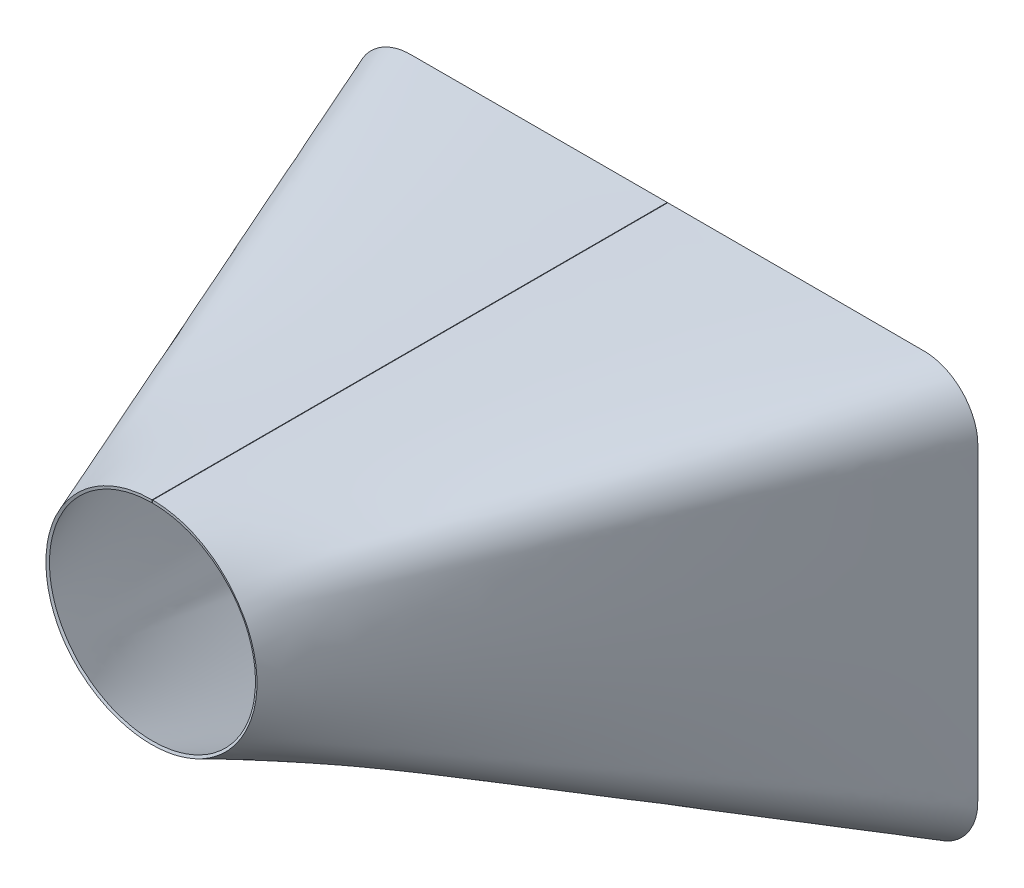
ISO-10303-21;
HEADER;
FILE_DESCRIPTION(('STEP AP214'),'2;1');
FILE_NAME('part.step','',(''),(''),'','','');
FILE_SCHEMA(('AUTOMOTIVE_DESIGN { 1 0 10303 214 1 1 1 1 }'));
ENDSEC;
DATA;
#1=APPLICATION_CONTEXT('core data for automotive mechanical design processes');
#2=APPLICATION_PROTOCOL_DEFINITION('international standard','automotive_design',2000,#1);
#3=PRODUCT_CONTEXT('',#1,'mechanical');
#4=PRODUCT('Part','Part','',(#3));
#5=PRODUCT_RELATED_PRODUCT_CATEGORY('part','',(#4));
#6=PRODUCT_DEFINITION_FORMATION('','',#4);
#7=PRODUCT_DEFINITION_CONTEXT('part definition',#1,'design');
#8=PRODUCT_DEFINITION('design','',#6,#7);
#9=PRODUCT_DEFINITION_SHAPE('','',#8);
#10=(LENGTH_UNIT() NAMED_UNIT(*) SI_UNIT(.MILLI.,.METRE.));
#11=(NAMED_UNIT(*) PLANE_ANGLE_UNIT() SI_UNIT($,.RADIAN.));
#12=(NAMED_UNIT(*) SI_UNIT($,.STERADIAN.) SOLID_ANGLE_UNIT());
#13=UNCERTAINTY_MEASURE_WITH_UNIT(LENGTH_MEASURE(1.E-05),#10,'distance_accuracy_value','');
#14=(GEOMETRIC_REPRESENTATION_CONTEXT(3) GLOBAL_UNCERTAINTY_ASSIGNED_CONTEXT((#13)) GLOBAL_UNIT_ASSIGNED_CONTEXT((#10,
#11,#12)) REPRESENTATION_CONTEXT('',''));
#15=CARTESIAN_POINT('',(0.,0.,0.));
#16=DIRECTION('',(0.,0.,1.));
#17=DIRECTION('',(1.,0.,0.));
#18=AXIS2_PLACEMENT_3D('',#15,#16,#17);
#19=CARTESIAN_POINT('',(0.250000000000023,-0.000312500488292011,500.));
#20=CARTESIAN_POINT('',(8.10612701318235,-0.0199528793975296,500.));
#21=CARTESIAN_POINT('',(15.9598679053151,-0.969691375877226,500.));
#22=CARTESIAN_POINT('',(31.2073812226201,-4.67116009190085,500.));
#23=CARTESIAN_POINT('',(38.60126402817,-7.41986880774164,500.));
#24=CARTESIAN_POINT('',(49.0317191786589,-12.7585180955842,500.));
#25=CARTESIAN_POINT('',(52.3994016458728,-14.7391191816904,500.));
#26=CARTESIAN_POINT('',(58.8699180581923,-19.0704766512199,500.));
#27=CARTESIAN_POINT('',(61.972020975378,-21.4219265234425,500.));
#28=CARTESIAN_POINT('',(66.3959926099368,-25.1985963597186,500.));
#29=CARTESIAN_POINT('',(67.8325440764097,-26.4989821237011,500.));
#30=CARTESIAN_POINT('',(69.9267713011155,-28.5079317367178,500.));
#31=CARTESIAN_POINT('',(70.6147470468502,-29.1873101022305,500.));
#32=CARTESIAN_POINT('',(71.9699249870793,-30.5648783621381,500.));
#33=CARTESIAN_POINT('',(72.6405314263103,-31.266831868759,500.));
#34=CARTESIAN_POINT('',(73.2697034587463,-31.9392198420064,500.));
#35=CARTESIAN_POINT('',(73.3850787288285,-32.0634393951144,500.));
#36=CARTESIAN_POINT('',(73.5386907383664,-32.2302221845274,500.));
#37=CARTESIAN_POINT('',(73.5866529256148,-32.2825586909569,500.));
#38=CARTESIAN_POINT('',(73.6532632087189,-32.3556568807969,500.));
#39=CARTESIAN_POINT('',(73.6745778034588,-32.3791218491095,500.));
#40=CARTESIAN_POINT('',(73.7153509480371,-32.4241629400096,500.));
#41=CARTESIAN_POINT('',(73.7352697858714,-32.4462038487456,500.));
#42=CARTESIAN_POINT('',(73.9145151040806,-32.6444856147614,500.));
#43=CARTESIAN_POINT('',(74.0644223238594,-32.8107772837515,500.));
#44=CARTESIAN_POINT('',(74.4897542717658,-33.2840496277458,500.));
#45=CARTESIAN_POINT('',(74.7407892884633,-33.5654276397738,500.));
#46=CARTESIAN_POINT('',(75.4273446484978,-34.341340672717,500.));
#47=CARTESIAN_POINT('',(75.7963153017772,-34.7676546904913,500.));
#48=CARTESIAN_POINT('',(77.6109593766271,-36.9002800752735,500.));
#49=CARTESIAN_POINT('',(78.9684249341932,-38.6102023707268,500.000000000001));
#50=CARTESIAN_POINT('',(81.5576936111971,-42.0943821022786,499.999999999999));
#51=CARTESIAN_POINT('',(82.7885367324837,-43.8675704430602,500.));
#52=CARTESIAN_POINT('',(84.5678901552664,-46.6198376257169,500.));
#53=CARTESIAN_POINT('',(85.149778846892,-47.5524519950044,500.));
#54=CARTESIAN_POINT('',(85.8655963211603,-48.7438332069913,500.));
#55=CARTESIAN_POINT('',(86.0081804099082,-48.983405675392,500.));
#56=CARTESIAN_POINT('',(86.2922478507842,-49.4653382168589,500.));
#57=CARTESIAN_POINT('',(86.4312843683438,-49.7032136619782,500.));
#58=CARTESIAN_POINT('',(86.8761919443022,-50.4751296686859,500.));
#59=CARTESIAN_POINT('',(87.214754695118,-51.0764291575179,500.));
#60=CARTESIAN_POINT('',(87.855856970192,-52.2401026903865,500.));
#61=CARTESIAN_POINT('',(87.9949723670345,-52.4934398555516,500.));
#62=CARTESIAN_POINT('',(88.2230900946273,-52.9100434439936,500.));
#63=CARTESIAN_POINT('',(88.3023701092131,-53.0550109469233,500.));
#64=CARTESIAN_POINT('',(88.4265390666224,-53.2823234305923,500.));
#65=CARTESIAN_POINT('',(88.4688035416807,-53.3597377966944,500.));
#66=CARTESIAN_POINT('',(88.5551467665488,-53.5179722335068,500.));
#67=CARTESIAN_POINT('',(88.5990759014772,-53.5988866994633,500.));
#68=CARTESIAN_POINT('',(88.9995803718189,-54.3435398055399,500.));
#69=CARTESIAN_POINT('',(89.3952126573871,-55.1204771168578,500.));
#70=CARTESIAN_POINT('',(90.6502311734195,-57.703482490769,500.));
#71=CARTESIAN_POINT('',(91.5777390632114,-59.7617439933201,500.));
#72=CARTESIAN_POINT('',(92.9021911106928,-62.982015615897,500.));
#73=CARTESIAN_POINT('',(93.3302713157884,-64.0734386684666,500.));
#74=CARTESIAN_POINT('',(94.1450671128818,-66.2656179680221,500.));
#75=CARTESIAN_POINT('',(94.5335977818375,-67.369692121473,500.));
#76=CARTESIAN_POINT('',(95.6414444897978,-70.7036944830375,500.));
#77=CARTESIAN_POINT('',(96.3030152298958,-72.955402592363,500.));
#78=CARTESIAN_POINT('',(99.2106521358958,-84.3301610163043,500.000000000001));
#79=CARTESIAN_POINT('',(100.254472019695,-93.8018636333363,500.));
#80=CARTESIAN_POINT('',(99.7957027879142,-107.937800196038,500.));
#81=CARTESIAN_POINT('',(99.3085549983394,-112.637845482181,500.));
#82=CARTESIAN_POINT('',(97.6840756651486,-121.909187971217,500.));
#83=CARTESIAN_POINT('',(96.545060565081,-126.47981457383,500.));
#84=CARTESIAN_POINT('',(94.7322353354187,-132.049426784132,500.));
#85=CARTESIAN_POINT('',(94.3503489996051,-133.156218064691,500.));
#86=CARTESIAN_POINT('',(93.5486985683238,-135.354090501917,500.));
#87=CARTESIAN_POINT('',(93.1282972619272,-136.446331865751,500.));
#88=CARTESIAN_POINT('',(91.8157933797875,-139.689363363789,500.));
#89=CARTESIAN_POINT('',(90.881311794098,-141.790218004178,500.));
#90=CARTESIAN_POINT('',(89.5940427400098,-144.478581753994,500.));
#91=CARTESIAN_POINT('',(89.184028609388,-145.297549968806,500.));
#92=CARTESIAN_POINT('',(88.7165712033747,-146.18615553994,500.));
#93=CARTESIAN_POINT('',(88.6253327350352,-146.357121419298,500.));
#94=CARTESIAN_POINT('',(88.4922523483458,-146.602712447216,500.));
#95=CARTESIAN_POINT('',(88.4484391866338,-146.68271053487,500.));
#96=CARTESIAN_POINT('',(88.3626386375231,-146.839293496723,500.));
#97=CARTESIAN_POINT('',(88.3206415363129,-146.915896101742,500.));
#98=CARTESIAN_POINT('',(88.1150098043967,-147.290761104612,500.));
#99=CARTESIAN_POINT('',(87.9644364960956,-147.564579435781,500.));
#100=CARTESIAN_POINT('',(87.2708564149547,-148.822269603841,500.));
#101=CARTESIAN_POINT('',(86.9057090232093,-149.471936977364,500.));
#102=CARTESIAN_POINT('',(86.443383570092,-150.275874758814,500.));
#103=CARTESIAN_POINT('',(86.3033258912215,-150.51575869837,500.));
#104=CARTESIAN_POINT('',(86.019251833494,-150.997955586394,500.));
#105=CARTESIAN_POINT('',(85.8766898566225,-151.237613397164,500.));
#106=CARTESIAN_POINT('',(85.4473338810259,-151.95257486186,500.));
#107=CARTESIAN_POINT('',(85.1588698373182,-152.423866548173,500.));
#108=CARTESIAN_POINT('',(84.2860359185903,-153.824173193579,500.));
#109=CARTESIAN_POINT('',(83.6942524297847,-154.739832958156,500.));
#110=CARTESIAN_POINT('',(81.8821967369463,-157.445977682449,500.));
#111=CARTESIAN_POINT('',(80.6261825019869,-159.1961740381,500.));
#112=CARTESIAN_POINT('',(78.6357428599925,-161.786656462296,500.));
#113=CARTESIAN_POINT('',(77.9545169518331,-162.644175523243,500.));
#114=CARTESIAN_POINT('',(76.9002199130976,-163.927097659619,500.));
#115=CARTESIAN_POINT('',(76.5432849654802,-164.354200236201,500.));
#116=CARTESIAN_POINT('',(75.9985503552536,-164.99482744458,500.));
#117=CARTESIAN_POINT('',(75.8213178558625,-165.201863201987,500.));
#118=CARTESIAN_POINT('',(75.3986506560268,-165.687580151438,500.));
#119=CARTESIAN_POINT('',(75.15152993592,-165.968119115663,500.));
#120=CARTESIAN_POINT('',(74.4977410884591,-166.701424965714,500.));
#121=CARTESIAN_POINT('',(74.091072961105,-167.154191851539,500.));
#122=CARTESIAN_POINT('',(73.2954303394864,-168.035163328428,500.));
#123=CARTESIAN_POINT('',(72.9992760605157,-168.362457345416,500.));
#124=CARTESIAN_POINT('',(72.5003870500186,-168.912934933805,500.));
#125=CARTESIAN_POINT('',(72.3249811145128,-169.106350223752,500.));
#126=CARTESIAN_POINT('',(72.1166279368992,-169.3359569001,500.));
#127=CARTESIAN_POINT('',(72.0933318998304,-169.361642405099,500.));
#128=CARTESIAN_POINT('',(72.0463984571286,-169.413320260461,500.));
#129=CARTESIAN_POINT('',(72.0227375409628,-169.439290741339,500.));
#130=CARTESIAN_POINT('',(71.9511764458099,-169.51759219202,500.));
#131=CARTESIAN_POINT('',(71.9026979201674,-169.570313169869,500.));
#132=CARTESIAN_POINT('',(71.754982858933,-169.729998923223,500.));
#133=CARTESIAN_POINT('',(71.6534668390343,-169.838486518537,500.));
#134=CARTESIAN_POINT('',(70.7132825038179,-170.83225561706,500.));
#135=CARTESIAN_POINT('',(69.6888330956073,-171.839202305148,500.));
#136=CARTESIAN_POINT('',(67.3550502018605,-173.998673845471,500.));
#137=CARTESIAN_POINT('',(66.0457167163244,-175.151198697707,500.));
#138=CARTESIAN_POINT('',(63.2347415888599,-177.500211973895,500.));
#139=CARTESIAN_POINT('',(61.7330999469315,-178.696700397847,500.));
#140=CARTESIAN_POINT('',(59.4058383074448,-180.44819476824,500.));
#141=CARTESIAN_POINT('',(58.6180194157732,-181.024366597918,500.));
#142=CARTESIAN_POINT('',(57.0270129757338,-182.151861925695,500.));
#143=CARTESIAN_POINT('',(56.2230223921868,-182.704091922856,500.));
#144=CARTESIAN_POINT('',(52.1624601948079,-185.406493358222,500.));
#145=CARTESIAN_POINT('',(48.7840607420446,-187.38041914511,500.));
#146=CARTESIAN_POINT('',(38.329190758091,-192.693658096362,499.999999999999));
#147=CARTESIAN_POINT('',(30.9299555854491,-195.418492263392,500.));
#148=CARTESIAN_POINT('',(15.6873305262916,-199.073125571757,500.000000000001));
#149=CARTESIAN_POINT('',(7.84373344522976,-200.000295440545,499.999999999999));
#150=CARTESIAN_POINT('',(-7.8437334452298,-200.000295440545,499.999999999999));
#151=CARTESIAN_POINT('',(-15.6873305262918,-199.073125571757,500.));
#152=CARTESIAN_POINT('',(-30.9299555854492,-195.418492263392,500.000000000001));
#153=CARTESIAN_POINT('',(-38.329190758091,-192.693658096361,500.));
#154=CARTESIAN_POINT('',(-48.7840607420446,-187.38041914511,500.));
#155=CARTESIAN_POINT('',(-52.162460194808,-185.406493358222,500.));
#156=CARTESIAN_POINT('',(-56.2230223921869,-182.704091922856,500.));
#157=CARTESIAN_POINT('',(-57.0270129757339,-182.151861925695,500.));
#158=CARTESIAN_POINT('',(-58.6180194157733,-181.024366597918,500.));
#159=CARTESIAN_POINT('',(-59.4058383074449,-180.448194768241,500.));
#160=CARTESIAN_POINT('',(-61.7330999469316,-178.696700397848,500.));
#161=CARTESIAN_POINT('',(-63.23474158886,-177.500211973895,500.));
#162=CARTESIAN_POINT('',(-66.0457167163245,-175.151198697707,500.));
#163=CARTESIAN_POINT('',(-67.3550502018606,-173.998673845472,500.));
#164=CARTESIAN_POINT('',(-69.6888330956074,-171.839202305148,500.));
#165=CARTESIAN_POINT('',(-70.713282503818,-170.83225561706,500.));
#166=CARTESIAN_POINT('',(-71.6534668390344,-169.838486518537,500.));
#167=CARTESIAN_POINT('',(-71.7549828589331,-169.729998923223,500.));
#168=CARTESIAN_POINT('',(-71.9026979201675,-169.570313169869,500.));
#169=CARTESIAN_POINT('',(-71.9511764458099,-169.51759219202,500.));
#170=CARTESIAN_POINT('',(-72.0227375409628,-169.439290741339,500.));
#171=CARTESIAN_POINT('',(-72.0463984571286,-169.413320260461,500.));
#172=CARTESIAN_POINT('',(-72.0933318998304,-169.361642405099,500.));
#173=CARTESIAN_POINT('',(-72.1166279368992,-169.3359569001,500.));
#174=CARTESIAN_POINT('',(-72.3249811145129,-169.106350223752,500.));
#175=CARTESIAN_POINT('',(-72.5003870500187,-168.912934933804,500.));
#176=CARTESIAN_POINT('',(-72.9992760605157,-168.362457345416,500.));
#177=CARTESIAN_POINT('',(-73.2954303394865,-168.035163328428,500.));
#178=CARTESIAN_POINT('',(-74.0910729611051,-167.154191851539,500.));
#179=CARTESIAN_POINT('',(-74.4977410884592,-166.701424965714,500.));
#180=CARTESIAN_POINT('',(-75.1515299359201,-165.968119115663,500.));
#181=CARTESIAN_POINT('',(-75.3986506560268,-165.687580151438,500.));
#182=CARTESIAN_POINT('',(-75.8213178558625,-165.201863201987,500.));
#183=CARTESIAN_POINT('',(-75.9985503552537,-164.99482744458,500.));
#184=CARTESIAN_POINT('',(-76.5432849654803,-164.354200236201,500.));
#185=CARTESIAN_POINT('',(-76.9002199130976,-163.927097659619,500.));
#186=CARTESIAN_POINT('',(-77.954516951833,-162.644175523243,500.));
#187=CARTESIAN_POINT('',(-78.6357428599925,-161.786656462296,500.));
#188=CARTESIAN_POINT('',(-80.6261825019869,-159.1961740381,500.));
#189=CARTESIAN_POINT('',(-81.8821967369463,-157.445977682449,500.));
#190=CARTESIAN_POINT('',(-83.6942524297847,-154.739832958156,500.));
#191=CARTESIAN_POINT('',(-84.2860359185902,-153.824173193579,500.));
#192=CARTESIAN_POINT('',(-85.1588698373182,-152.423866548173,500.));
#193=CARTESIAN_POINT('',(-85.4473338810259,-151.95257486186,500.));
#194=CARTESIAN_POINT('',(-85.8766898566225,-151.237613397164,500.));
#195=CARTESIAN_POINT('',(-86.019251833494,-150.997955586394,500.));
#196=CARTESIAN_POINT('',(-86.3033258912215,-150.51575869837,500.));
#197=CARTESIAN_POINT('',(-86.443383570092,-150.275874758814,500.));
#198=CARTESIAN_POINT('',(-86.9057090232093,-149.471936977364,500.));
#199=CARTESIAN_POINT('',(-87.2708564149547,-148.822269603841,500.));
#200=CARTESIAN_POINT('',(-87.9644364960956,-147.564579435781,500.));
#201=CARTESIAN_POINT('',(-88.1150098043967,-147.290761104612,500.));
#202=CARTESIAN_POINT('',(-88.320641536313,-146.915896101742,500.));
#203=CARTESIAN_POINT('',(-88.3626386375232,-146.839293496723,500.));
#204=CARTESIAN_POINT('',(-88.4484391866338,-146.68271053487,500.));
#205=CARTESIAN_POINT('',(-88.4922523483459,-146.602712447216,500.));
#206=CARTESIAN_POINT('',(-88.6253327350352,-146.357121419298,500.));
#207=CARTESIAN_POINT('',(-88.7165712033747,-146.18615553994,500.));
#208=CARTESIAN_POINT('',(-89.184028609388,-145.297549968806,500.));
#209=CARTESIAN_POINT('',(-89.5940427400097,-144.478581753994,500.));
#210=CARTESIAN_POINT('',(-90.8813117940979,-141.790218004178,500.));
#211=CARTESIAN_POINT('',(-91.8157933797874,-139.689363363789,500.));
#212=CARTESIAN_POINT('',(-93.1282972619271,-136.446331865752,500.));
#213=CARTESIAN_POINT('',(-93.5486985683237,-135.354090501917,500.));
#214=CARTESIAN_POINT('',(-94.3503489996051,-133.156218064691,500.));
#215=CARTESIAN_POINT('',(-94.7322353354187,-132.049426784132,500.));
#216=CARTESIAN_POINT('',(-96.5450605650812,-126.479814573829,500.));
#217=CARTESIAN_POINT('',(-97.6840756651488,-121.909187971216,500.));
#218=CARTESIAN_POINT('',(-99.3085549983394,-112.63784548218,500.));
#219=CARTESIAN_POINT('',(-99.7957027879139,-107.937800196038,500.));
#220=CARTESIAN_POINT('',(-100.254472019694,-93.8018636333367,499.999999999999));
#221=CARTESIAN_POINT('',(-99.2106521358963,-84.3301610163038,500.));
#222=CARTESIAN_POINT('',(-96.3030152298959,-72.9554025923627,500.));
#223=CARTESIAN_POINT('',(-95.6414444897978,-70.7036944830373,500.));
#224=CARTESIAN_POINT('',(-94.5335977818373,-67.369692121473,500.));
#225=CARTESIAN_POINT('',(-94.1450671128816,-66.2656179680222,500.));
#226=CARTESIAN_POINT('',(-93.3302713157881,-64.0734386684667,500.));
#227=CARTESIAN_POINT('',(-92.9021911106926,-62.9820156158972,500.));
#228=CARTESIAN_POINT('',(-91.5777390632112,-59.7617439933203,500.));
#229=CARTESIAN_POINT('',(-90.6502311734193,-57.7034824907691,500.));
#230=CARTESIAN_POINT('',(-89.3952126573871,-55.1204771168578,500.));
#231=CARTESIAN_POINT('',(-88.9995803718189,-54.3435398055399,500.));
#232=CARTESIAN_POINT('',(-88.5990759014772,-53.5988866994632,500.));
#233=CARTESIAN_POINT('',(-88.5551467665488,-53.5179722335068,500.));
#234=CARTESIAN_POINT('',(-88.4688035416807,-53.3597377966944,500.));
#235=CARTESIAN_POINT('',(-88.4265390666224,-53.2823234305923,500.));
#236=CARTESIAN_POINT('',(-88.3023701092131,-53.0550109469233,500.));
#237=CARTESIAN_POINT('',(-88.2230900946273,-52.9100434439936,500.));
#238=CARTESIAN_POINT('',(-87.9949723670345,-52.4934398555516,500.));
#239=CARTESIAN_POINT('',(-87.855856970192,-52.2401026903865,500.));
#240=CARTESIAN_POINT('',(-87.2147546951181,-51.0764291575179,500.));
#241=CARTESIAN_POINT('',(-86.8761919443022,-50.4751296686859,500.));
#242=CARTESIAN_POINT('',(-86.4312843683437,-49.7032136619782,500.));
#243=CARTESIAN_POINT('',(-86.2922478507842,-49.4653382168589,500.));
#244=CARTESIAN_POINT('',(-86.0081804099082,-48.983405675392,500.));
#245=CARTESIAN_POINT('',(-85.8655963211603,-48.7438332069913,500.));
#246=CARTESIAN_POINT('',(-85.1497788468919,-47.5524519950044,500.));
#247=CARTESIAN_POINT('',(-84.5678901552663,-46.6198376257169,500.));
#248=CARTESIAN_POINT('',(-82.7885367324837,-43.8675704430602,500.));
#249=CARTESIAN_POINT('',(-81.5576936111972,-42.0943821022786,500.));
#250=CARTESIAN_POINT('',(-78.9684249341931,-38.6102023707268,500.));
#251=CARTESIAN_POINT('',(-77.610959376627,-36.9002800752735,500.));
#252=CARTESIAN_POINT('',(-75.7963153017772,-34.7676546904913,500.));
#253=CARTESIAN_POINT('',(-75.4273446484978,-34.341340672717,500.));
#254=CARTESIAN_POINT('',(-74.7407892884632,-33.5654276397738,500.));
#255=CARTESIAN_POINT('',(-74.4897542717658,-33.2840496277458,500.));
#256=CARTESIAN_POINT('',(-74.0644223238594,-32.8107772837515,500.));
#257=CARTESIAN_POINT('',(-73.9145151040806,-32.6444856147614,500.));
#258=CARTESIAN_POINT('',(-73.7352697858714,-32.4462038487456,500.));
#259=CARTESIAN_POINT('',(-73.7153509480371,-32.4241629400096,500.));
#260=CARTESIAN_POINT('',(-73.6745778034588,-32.3791218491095,500.));
#261=CARTESIAN_POINT('',(-73.6532632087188,-32.3556568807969,500.));
#262=CARTESIAN_POINT('',(-73.5866529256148,-32.2825586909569,500.));
#263=CARTESIAN_POINT('',(-73.5386907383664,-32.2302221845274,500.));
#264=CARTESIAN_POINT('',(-73.3850787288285,-32.0634393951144,500.));
#265=CARTESIAN_POINT('',(-73.2697034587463,-31.9392198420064,500.));
#266=CARTESIAN_POINT('',(-72.6405314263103,-31.266831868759,500.));
#267=CARTESIAN_POINT('',(-71.9699249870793,-30.5648783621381,500.));
#268=CARTESIAN_POINT('',(-70.6147470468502,-29.1873101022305,500.));
#269=CARTESIAN_POINT('',(-69.9267713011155,-28.5079317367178,500.));
#270=CARTESIAN_POINT('',(-67.8325440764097,-26.4989821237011,500.));
#271=CARTESIAN_POINT('',(-66.3959926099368,-25.1985963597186,500.));
#272=CARTESIAN_POINT('',(-61.9720209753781,-21.4219265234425,500.));
#273=CARTESIAN_POINT('',(-58.8699180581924,-19.0704766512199,500.));
#274=CARTESIAN_POINT('',(-52.3994016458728,-14.7391191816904,500.));
#275=CARTESIAN_POINT('',(-49.0317191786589,-12.7585180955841,500.));
#276=CARTESIAN_POINT('',(-38.6012640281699,-7.41986880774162,500.));
#277=CARTESIAN_POINT('',(-31.20738122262,-4.67116009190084,500.));
#278=CARTESIAN_POINT('',(-15.9598679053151,-0.969691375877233,500.));
#279=CARTESIAN_POINT('',(-8.10612701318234,-0.0199528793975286,500.));
#280=CARTESIAN_POINT('',(-0.25000000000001,-0.000312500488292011,500.));
#281=CARTESIAN_POINT('',(0.256642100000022,2.65651919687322,500.000001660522));
#282=CARTESIAN_POINT('',(8.32146469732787,2.63635707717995,500.000310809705));
#283=CARTESIAN_POINT('',(16.3838636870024,1.66170579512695,500.025088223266));
#284=CARTESIAN_POINT('',(32.0364490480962,-2.14079432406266,500.12061730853));
#285=CARTESIAN_POINT('',(39.6256864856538,-4.96566342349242,500.191363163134));
#286=CARTESIAN_POINT('',(50.3252046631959,-10.4577174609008,500.323430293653));
#287=CARTESIAN_POINT('',(53.7781818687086,-12.4957294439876,500.371627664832));
#288=CARTESIAN_POINT('',(60.4092895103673,-16.9545059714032,500.474281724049));
#289=CARTESIAN_POINT('',(63.586625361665,-19.3760432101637,500.528743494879));
#290=CARTESIAN_POINT('',(68.1127793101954,-23.2648332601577,500.612651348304));
#291=CARTESIAN_POINT('',(69.5817198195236,-24.6038229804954,500.641009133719));
#292=CARTESIAN_POINT('',(71.7219724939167,-26.672392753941,500.683873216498));
#293=CARTESIAN_POINT('',(72.4248638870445,-27.3719301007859,500.698215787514));
#294=CARTESIAN_POINT('',(73.8090146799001,-28.7903642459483,500.726967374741));
#295=CARTESIAN_POINT('',(74.4879459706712,-29.5064080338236,500.739901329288));
#296=CARTESIAN_POINT('',(75.1337492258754,-30.2029173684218,500.754605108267));
#297=CARTESIAN_POINT('',(75.2528164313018,-30.3323588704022,500.757487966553));
#298=CARTESIAN_POINT('',(75.4135507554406,-30.5088379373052,500.761940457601));
#299=CARTESIAN_POINT('',(75.464157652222,-30.564725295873,500.763447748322));
#300=CARTESIAN_POINT('',(75.5354453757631,-30.6440140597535,500.765816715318));
#301=CARTESIAN_POINT('',(75.5584392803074,-30.6696889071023,500.766624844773));
#302=CARTESIAN_POINT('',(75.602897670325,-30.7195539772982,500.768299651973));
#303=CARTESIAN_POINT('',(75.6217622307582,-30.7404539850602,500.76835061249));
#304=CARTESIAN_POINT('',(75.8019509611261,-30.9412488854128,500.771610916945));
#305=CARTESIAN_POINT('',(75.952880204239,-31.1099371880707,500.774392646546));
#306=CARTESIAN_POINT('',(76.3818570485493,-31.5909577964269,500.782462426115));
#307=CARTESIAN_POINT('',(76.6361202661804,-31.8782782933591,500.787482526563));
#308=CARTESIAN_POINT('',(77.3343371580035,-32.6741526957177,500.801867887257));
#309=CARTESIAN_POINT('',(77.7140500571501,-33.1171402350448,500.810654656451));
#310=CARTESIAN_POINT('',(79.5655473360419,-35.3120079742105,500.848554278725));
#311=CARTESIAN_POINT('',(80.9498581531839,-37.0697459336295,500.873550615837));
#312=CARTESIAN_POINT('',(83.5933996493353,-40.6495009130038,500.911259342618));
#313=CARTESIAN_POINT('',(84.8510145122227,-42.4694821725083,500.923759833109));
#314=CARTESIAN_POINT('',(86.6715561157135,-45.2921513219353,500.933481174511));
#315=CARTESIAN_POINT('',(87.2671235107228,-46.247888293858,500.935166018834));
#316=CARTESIAN_POINT('',(88.0006236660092,-47.4691448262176,500.935774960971));
#317=CARTESIAN_POINT('',(88.1467623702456,-47.7147219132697,500.935818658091));
#318=CARTESIAN_POINT('',(88.4379650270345,-48.2087102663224,500.935752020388));
#319=CARTESIAN_POINT('',(88.5808174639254,-48.4531187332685,500.935768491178));
#320=CARTESIAN_POINT('',(89.0400574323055,-49.2502934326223,500.93628847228));
#321=CARTESIAN_POINT('',(89.3879405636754,-49.8677795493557,500.935603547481));
#322=CARTESIAN_POINT('',(90.0370319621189,-51.0412729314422,500.929564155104));
#323=CARTESIAN_POINT('',(90.1776367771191,-51.2962084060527,500.928126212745));
#324=CARTESIAN_POINT('',(90.4078924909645,-51.7147610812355,500.925601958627));
#325=CARTESIAN_POINT('',(90.4878691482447,-51.8603036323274,500.924699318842));
#326=CARTESIAN_POINT('',(90.6130668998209,-52.0883788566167,500.923250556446));
#327=CARTESIAN_POINT('',(90.6556716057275,-52.1660308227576,500.922751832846));
#328=CARTESIAN_POINT('',(90.7426911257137,-52.3247090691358,500.92172225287));
#329=CARTESIAN_POINT('',(90.790714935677,-52.4139926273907,500.922806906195));
#330=CARTESIAN_POINT('',(91.2131901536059,-53.2021089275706,500.92614732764));
#331=CARTESIAN_POINT('',(91.6226252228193,-54.0067741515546,500.926228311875));
#332=CARTESIAN_POINT('',(92.915416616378,-56.6658012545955,500.92420553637));
#333=CARTESIAN_POINT('',(93.8626263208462,-58.764014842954,500.919515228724));
#334=CARTESIAN_POINT('',(95.2189129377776,-62.058174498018,500.915880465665));
#335=CARTESIAN_POINT('',(95.65803958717,-63.1771965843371,500.915363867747));
#336=CARTESIAN_POINT('',(96.4933519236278,-65.4238505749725,500.914675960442));
#337=CARTESIAN_POINT('',(96.8915847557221,-66.5554047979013,500.914595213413));
#338=CARTESIAN_POINT('',(98.02684405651,-69.9725727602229,500.915170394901));
#339=CARTESIAN_POINT('',(98.7044339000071,-72.2806932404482,500.916645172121));
#340=CARTESIAN_POINT('',(101.680390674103,-83.9422588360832,500.929766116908));
#341=CARTESIAN_POINT('',(102.739476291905,-93.6496152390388,500.957482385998));
#342=CARTESIAN_POINT('',(102.24279160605,-108.133666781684,501.022883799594));
#343=CARTESIAN_POINT('',(101.733105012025,-112.946927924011,501.048227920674));
#344=CARTESIAN_POINT('',(100.044517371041,-122.438508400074,501.104939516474));
#345=CARTESIAN_POINT('',(98.863528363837,-127.116913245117,501.13642680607));
#346=CARTESIAN_POINT('',(96.988133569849,-132.813069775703,501.177895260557));
#347=CARTESIAN_POINT('',(96.5932261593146,-133.944795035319,501.186298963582));
#348=CARTESIAN_POINT('',(95.7645489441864,-136.191786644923,501.203299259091));
#349=CARTESIAN_POINT('',(95.3297961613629,-137.30890237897,501.212006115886));
#350=CARTESIAN_POINT('',(93.9754115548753,-140.620212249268,501.23754184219));
#351=CARTESIAN_POINT('',(93.015997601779,-142.756403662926,501.253503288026));
#352=CARTESIAN_POINT('',(91.6844315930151,-145.507505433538,501.277147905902));
#353=CARTESIAN_POINT('',(91.2586061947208,-146.348810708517,501.284960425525));
#354=CARTESIAN_POINT('',(90.765474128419,-147.2740172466,501.295158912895));
#355=CARTESIAN_POINT('',(90.6687795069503,-147.452770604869,501.29722305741));
#356=CARTESIAN_POINT('',(90.5268245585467,-147.711027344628,501.300377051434));
#357=CARTESIAN_POINT('',(90.4798922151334,-147.795472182,501.30144509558));
#358=CARTESIAN_POINT('',(90.3932753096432,-147.952377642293,501.302442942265));
#359=CARTESIAN_POINT('',(90.3508676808,-148.029156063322,501.302932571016));
#360=CARTESIAN_POINT('',(90.1431678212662,-148.404976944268,501.305336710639));
#361=CARTESIAN_POINT('',(89.9908907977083,-148.679805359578,501.307119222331));
#362=CARTESIAN_POINT('',(89.2882886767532,-149.944047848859,501.315486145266));
#363=CARTESIAN_POINT('',(88.913248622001,-150.60541705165,501.320668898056));
#364=CARTESIAN_POINT('',(88.4338596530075,-151.431054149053,501.327574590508));
#365=CARTESIAN_POINT('',(88.2884842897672,-151.677739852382,501.329582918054));
#366=CARTESIAN_POINT('',(87.996104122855,-152.170092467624,501.333039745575));
#367=CARTESIAN_POINT('',(87.8494164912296,-152.414807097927,501.334693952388));
#368=CARTESIAN_POINT('',(87.4077838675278,-153.14486092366,501.33942777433));
#369=CARTESIAN_POINT('',(87.1112689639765,-153.626109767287,501.342278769));
#370=CARTESIAN_POINT('',(86.2148361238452,-155.055863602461,501.349861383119));
#371=CARTESIAN_POINT('',(85.6076987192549,-155.991109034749,501.35368382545));
#372=CARTESIAN_POINT('',(83.7502469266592,-158.756803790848,501.361411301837));
#373=CARTESIAN_POINT('',(82.4657459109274,-160.546729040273,501.361368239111));
#374=CARTESIAN_POINT('',(80.4329938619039,-163.199055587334,501.354417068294));
#375=CARTESIAN_POINT('',(79.7381004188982,-164.077114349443,501.350919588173));
#376=CARTESIAN_POINT('',(78.6626949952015,-165.391887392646,501.344261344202));
#377=CARTESIAN_POINT('',(78.298624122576,-165.829772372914,501.341807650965));
#378=CARTESIAN_POINT('',(77.7430751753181,-166.486731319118,501.337796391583));
#379=CARTESIAN_POINT('',(77.5604873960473,-166.701016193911,501.336692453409));
#380=CARTESIAN_POINT('',(77.1249218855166,-167.204027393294,501.333901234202));
#381=CARTESIAN_POINT('',(76.8720727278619,-167.492732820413,501.331970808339));
#382=CARTESIAN_POINT('',(76.2116867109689,-168.238876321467,501.325705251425));
#383=CARTESIAN_POINT('',(75.8038108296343,-168.696672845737,501.321414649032));
#384=CARTESIAN_POINT('',(75.0086504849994,-169.584627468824,501.312574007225));
#385=CARTESIAN_POINT('',(74.7130370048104,-169.914156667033,501.309225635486));
#386=CARTESIAN_POINT('',(74.2154536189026,-170.467999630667,501.303504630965));
#387=CARTESIAN_POINT('',(74.0405656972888,-170.662538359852,501.301481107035));
#388=CARTESIAN_POINT('',(73.8328838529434,-170.893422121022,501.299063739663));
#389=CARTESIAN_POINT('',(73.8107940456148,-170.918120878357,501.298654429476));
#390=CARTESIAN_POINT('',(73.7606212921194,-170.973472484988,501.29852604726));
#391=CARTESIAN_POINT('',(73.7353616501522,-171.001255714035,501.298456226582));
#392=CARTESIAN_POINT('',(73.6590641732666,-171.084926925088,501.298230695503));
#393=CARTESIAN_POINT('',(73.6075077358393,-171.141136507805,501.298058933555));
#394=CARTESIAN_POINT('',(73.4507760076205,-171.31104256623,501.297485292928));
#395=CARTESIAN_POINT('',(73.343537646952,-171.426017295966,501.297025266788));
#396=CARTESIAN_POINT('',(72.3540050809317,-172.47579054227,501.292300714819));
#397=CARTESIAN_POINT('',(71.2995167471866,-173.517562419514,501.28433115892));
#398=CARTESIAN_POINT('',(68.9104156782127,-175.741924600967,501.265944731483));
#399=CARTESIAN_POINT('',(67.5766061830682,-176.923474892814,501.255322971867));
#400=CARTESIAN_POINT('',(64.7144453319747,-179.33059852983,501.23311926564));
#401=CARTESIAN_POINT('',(63.1862854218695,-180.555994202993,501.221513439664));
#402=CARTESIAN_POINT('',(60.8126898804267,-182.353317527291,501.204399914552));
#403=CARTESIAN_POINT('',(60.0078922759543,-182.945457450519,501.198766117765));
#404=CARTESIAN_POINT('',(58.3822405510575,-184.104376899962,501.187611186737));
#405=CARTESIAN_POINT('',(57.5606603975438,-184.672031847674,501.182080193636));
#406=CARTESIAN_POINT('',(53.41081636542,-187.450091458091,501.154710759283));
#407=CARTESIAN_POINT('',(49.9567199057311,-189.479860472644,501.13373432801));
#408=CARTESIAN_POINT('',(39.2620122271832,-194.945177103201,501.075480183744));
#409=CARTESIAN_POINT('',(31.6869323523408,-197.74993197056,501.042985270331));
#410=CARTESIAN_POINT('',(16.0741792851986,-201.512315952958,500.998569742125));
#411=CARTESIAN_POINT('',(8.0380135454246,-202.467109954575,500.986724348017));
#412=CARTESIAN_POINT('',(-8.03801354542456,-202.467109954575,500.986724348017));
#413=CARTESIAN_POINT('',(-16.0741792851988,-201.512315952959,500.998569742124));
#414=CARTESIAN_POINT('',(-31.686932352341,-197.74993197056,501.042985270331));
#415=CARTESIAN_POINT('',(-39.2620122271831,-194.9451771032,501.075480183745));
#416=CARTESIAN_POINT('',(-49.956719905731,-189.479860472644,501.13373432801));
#417=CARTESIAN_POINT('',(-53.41081636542,-187.450091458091,501.154710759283));
#418=CARTESIAN_POINT('',(-57.5606603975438,-184.672031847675,501.182080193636));
#419=CARTESIAN_POINT('',(-58.3822405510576,-184.104376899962,501.187611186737));
#420=CARTESIAN_POINT('',(-60.0078922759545,-182.94545745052,501.198766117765));
#421=CARTESIAN_POINT('',(-60.8126898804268,-182.353317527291,501.204399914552));
#422=CARTESIAN_POINT('',(-63.1862854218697,-180.555994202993,501.221513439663));
#423=CARTESIAN_POINT('',(-64.7144453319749,-179.330598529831,501.233119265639));
#424=CARTESIAN_POINT('',(-67.5766061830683,-176.923474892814,501.255322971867));
#425=CARTESIAN_POINT('',(-68.9104156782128,-175.741924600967,501.265944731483));
#426=CARTESIAN_POINT('',(-71.2995167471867,-173.517562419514,501.28433115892));
#427=CARTESIAN_POINT('',(-72.3540050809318,-172.47579054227,501.292300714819));
#428=CARTESIAN_POINT('',(-73.3435376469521,-171.426017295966,501.297025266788));
#429=CARTESIAN_POINT('',(-73.4507760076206,-171.31104256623,501.297485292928));
#430=CARTESIAN_POINT('',(-73.6075077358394,-171.141136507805,501.298058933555));
#431=CARTESIAN_POINT('',(-73.6590641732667,-171.084926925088,501.298230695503));
#432=CARTESIAN_POINT('',(-73.7353616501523,-171.001255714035,501.298456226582));
#433=CARTESIAN_POINT('',(-73.7606212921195,-170.973472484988,501.29852604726));
#434=CARTESIAN_POINT('',(-73.8107940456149,-170.918120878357,501.298654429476));
#435=CARTESIAN_POINT('',(-73.8328838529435,-170.893422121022,501.299063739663));
#436=CARTESIAN_POINT('',(-74.0405656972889,-170.662538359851,501.301481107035));
#437=CARTESIAN_POINT('',(-74.2154536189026,-170.467999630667,501.303504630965));
#438=CARTESIAN_POINT('',(-74.7130370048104,-169.914156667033,501.309225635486));
#439=CARTESIAN_POINT('',(-75.0086504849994,-169.584627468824,501.312574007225));
#440=CARTESIAN_POINT('',(-75.8038108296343,-168.696672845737,501.321414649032));
#441=CARTESIAN_POINT('',(-76.2116867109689,-168.238876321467,501.325705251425));
#442=CARTESIAN_POINT('',(-76.8720727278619,-167.492732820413,501.331970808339));
#443=CARTESIAN_POINT('',(-77.1249218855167,-167.204027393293,501.333901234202));
#444=CARTESIAN_POINT('',(-77.5604873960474,-166.701016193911,501.336692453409));
#445=CARTESIAN_POINT('',(-77.743075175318,-166.486731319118,501.337796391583));
#446=CARTESIAN_POINT('',(-78.298624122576,-165.829772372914,501.341807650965));
#447=CARTESIAN_POINT('',(-78.6626949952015,-165.391887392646,501.344261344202));
#448=CARTESIAN_POINT('',(-79.7381004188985,-164.077114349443,501.350919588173));
#449=CARTESIAN_POINT('',(-80.432993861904,-163.199055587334,501.354417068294));
#450=CARTESIAN_POINT('',(-82.4657459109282,-160.546729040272,501.36136823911));
#451=CARTESIAN_POINT('',(-83.7502469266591,-158.756803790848,501.361411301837));
#452=CARTESIAN_POINT('',(-85.607698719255,-155.991109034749,501.35368382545));
#453=CARTESIAN_POINT('',(-86.2148361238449,-155.055863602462,501.349861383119));
#454=CARTESIAN_POINT('',(-87.1112689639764,-153.626109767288,501.342278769));
#455=CARTESIAN_POINT('',(-87.4077838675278,-153.14486092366,501.33942777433));
#456=CARTESIAN_POINT('',(-87.8494164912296,-152.414807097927,501.334693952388));
#457=CARTESIAN_POINT('',(-87.9961041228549,-152.170092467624,501.333039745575));
#458=CARTESIAN_POINT('',(-88.2884842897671,-151.677739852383,501.329582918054));
#459=CARTESIAN_POINT('',(-88.4338596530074,-151.431054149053,501.327574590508));
#460=CARTESIAN_POINT('',(-88.913248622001,-150.60541705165,501.320668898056));
#461=CARTESIAN_POINT('',(-89.2882886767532,-149.944047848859,501.315486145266));
#462=CARTESIAN_POINT('',(-89.9908907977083,-148.679805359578,501.307119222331));
#463=CARTESIAN_POINT('',(-90.1431678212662,-148.404976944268,501.305336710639));
#464=CARTESIAN_POINT('',(-90.3508676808,-148.029156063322,501.302932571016));
#465=CARTESIAN_POINT('',(-90.3932753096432,-147.952377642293,501.302442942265));
#466=CARTESIAN_POINT('',(-90.4798922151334,-147.795472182,501.30144509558));
#467=CARTESIAN_POINT('',(-90.5268245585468,-147.711027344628,501.300377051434));
#468=CARTESIAN_POINT('',(-90.6687795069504,-147.452770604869,501.29722305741));
#469=CARTESIAN_POINT('',(-90.7654741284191,-147.2740172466,501.295158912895));
#470=CARTESIAN_POINT('',(-91.2586061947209,-146.348810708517,501.284960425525));
#471=CARTESIAN_POINT('',(-91.6844315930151,-145.507505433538,501.277147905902));
#472=CARTESIAN_POINT('',(-93.0159976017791,-142.756403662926,501.253503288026));
#473=CARTESIAN_POINT('',(-93.9754115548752,-140.620212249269,501.237541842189));
#474=CARTESIAN_POINT('',(-95.3297961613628,-137.30890237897,501.212006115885));
#475=CARTESIAN_POINT('',(-95.7645489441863,-136.191786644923,501.203299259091));
#476=CARTESIAN_POINT('',(-96.5932261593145,-133.944795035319,501.186298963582));
#477=CARTESIAN_POINT('',(-96.9881335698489,-132.813069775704,501.177895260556));
#478=CARTESIAN_POINT('',(-98.8635283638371,-127.116913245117,501.136426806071));
#479=CARTESIAN_POINT('',(-100.044517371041,-122.438508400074,501.104939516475));
#480=CARTESIAN_POINT('',(-101.733105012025,-112.946927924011,501.048227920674));
#481=CARTESIAN_POINT('',(-102.24279160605,-108.133666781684,501.022883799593));
#482=CARTESIAN_POINT('',(-102.739476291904,-93.6496152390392,500.957482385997));
#483=CARTESIAN_POINT('',(-101.680390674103,-83.9422588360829,500.929766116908));
#484=CARTESIAN_POINT('',(-98.7044339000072,-72.2806932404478,500.916645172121));
#485=CARTESIAN_POINT('',(-98.02684405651,-69.9725727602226,500.915170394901));
#486=CARTESIAN_POINT('',(-96.8915847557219,-66.5554047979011,500.914595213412));
#487=CARTESIAN_POINT('',(-96.4933519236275,-65.4238505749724,500.914675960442));
#488=CARTESIAN_POINT('',(-95.6580395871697,-63.1771965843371,500.915363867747));
#489=CARTESIAN_POINT('',(-95.2189129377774,-62.0581744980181,500.915880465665));
#490=CARTESIAN_POINT('',(-93.862626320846,-58.7640148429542,500.919515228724));
#491=CARTESIAN_POINT('',(-92.9154166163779,-56.6658012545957,500.92420553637));
#492=CARTESIAN_POINT('',(-91.6226252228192,-54.0067741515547,500.926228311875));
#493=CARTESIAN_POINT('',(-91.2131901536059,-53.2021089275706,500.92614732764));
#494=CARTESIAN_POINT('',(-90.790714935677,-52.4139926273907,500.922806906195));
#495=CARTESIAN_POINT('',(-90.7426911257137,-52.3247090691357,500.92172225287));
#496=CARTESIAN_POINT('',(-90.6556716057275,-52.1660308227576,500.922751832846));
#497=CARTESIAN_POINT('',(-90.6130668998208,-52.0883788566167,500.923250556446));
#498=CARTESIAN_POINT('',(-90.4878691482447,-51.8603036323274,500.924699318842));
#499=CARTESIAN_POINT('',(-90.4078924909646,-51.7147610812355,500.925601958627));
#500=CARTESIAN_POINT('',(-90.1776367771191,-51.2962084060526,500.928126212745));
#501=CARTESIAN_POINT('',(-90.0370319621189,-51.0412729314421,500.929564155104));
#502=CARTESIAN_POINT('',(-89.3879405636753,-49.8677795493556,500.935603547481));
#503=CARTESIAN_POINT('',(-89.0400574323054,-49.2502934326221,500.936288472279));
#504=CARTESIAN_POINT('',(-88.5808174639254,-48.4531187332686,500.935768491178));
#505=CARTESIAN_POINT('',(-88.4379650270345,-48.2087102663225,500.935752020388));
#506=CARTESIAN_POINT('',(-88.1467623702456,-47.7147219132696,500.935818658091));
#507=CARTESIAN_POINT('',(-88.0006236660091,-47.4691448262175,500.93577496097));
#508=CARTESIAN_POINT('',(-87.2671235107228,-46.2478882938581,500.935166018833));
#509=CARTESIAN_POINT('',(-86.6715561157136,-45.2921513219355,500.933481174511));
#510=CARTESIAN_POINT('',(-84.8510145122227,-42.4694821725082,500.923759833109));
#511=CARTESIAN_POINT('',(-83.5933996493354,-40.6495009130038,500.911259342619));
#512=CARTESIAN_POINT('',(-80.9498581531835,-37.069745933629,500.873550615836));
#513=CARTESIAN_POINT('',(-79.5655473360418,-35.3120079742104,500.848554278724));
#514=CARTESIAN_POINT('',(-77.7140500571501,-33.1171402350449,500.81065465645));
#515=CARTESIAN_POINT('',(-77.3343371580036,-32.6741526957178,500.801867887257));
#516=CARTESIAN_POINT('',(-76.6361202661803,-31.8782782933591,500.787482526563));
#517=CARTESIAN_POINT('',(-76.3818570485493,-31.5909577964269,500.782462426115));
#518=CARTESIAN_POINT('',(-75.952880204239,-31.1099371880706,500.774392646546));
#519=CARTESIAN_POINT('',(-75.8019509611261,-30.9412488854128,500.771610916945));
#520=CARTESIAN_POINT('',(-75.6217622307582,-30.7404539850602,500.76835061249));
#521=CARTESIAN_POINT('',(-75.602897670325,-30.7195539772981,500.768299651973));
#522=CARTESIAN_POINT('',(-75.5584392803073,-30.6696889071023,500.766624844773));
#523=CARTESIAN_POINT('',(-75.5354453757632,-30.6440140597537,500.765816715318));
#524=CARTESIAN_POINT('',(-75.464157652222,-30.5647252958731,500.763447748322));
#525=CARTESIAN_POINT('',(-75.4135507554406,-30.5088379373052,500.761940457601));
#526=CARTESIAN_POINT('',(-75.2528164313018,-30.3323588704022,500.757487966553));
#527=CARTESIAN_POINT('',(-75.1337492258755,-30.2029173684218,500.754605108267));
#528=CARTESIAN_POINT('',(-74.4879459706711,-29.5064080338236,500.739901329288));
#529=CARTESIAN_POINT('',(-73.8090146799,-28.7903642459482,500.726967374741));
#530=CARTESIAN_POINT('',(-72.4248638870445,-27.3719301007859,500.698215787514));
#531=CARTESIAN_POINT('',(-71.7219724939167,-26.672392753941,500.683873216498));
#532=CARTESIAN_POINT('',(-69.5817198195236,-24.6038229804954,500.641009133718));
#533=CARTESIAN_POINT('',(-68.1127793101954,-23.2648332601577,500.612651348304));
#534=CARTESIAN_POINT('',(-63.586625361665,-19.3760432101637,500.528743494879));
#535=CARTESIAN_POINT('',(-60.4092895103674,-16.9545059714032,500.474281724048));
#536=CARTESIAN_POINT('',(-53.7781818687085,-12.4957294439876,500.371627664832));
#537=CARTESIAN_POINT('',(-50.3252046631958,-10.4577174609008,500.323430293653));
#538=CARTESIAN_POINT('',(-39.6256864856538,-4.96566342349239,500.191363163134));
#539=CARTESIAN_POINT('',(-32.0364490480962,-2.14079432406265,500.12061730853));
#540=CARTESIAN_POINT('',(-16.3838636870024,1.66170579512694,500.025088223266));
#541=CARTESIAN_POINT('',(-8.32146469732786,2.63635707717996,500.000310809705));
#542=CARTESIAN_POINT('',(-0.256642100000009,2.65651919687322,500.000001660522));
#543=B_SPLINE_SURFACE_WITH_KNOTS('',1,3,((#19,#20,#21,#22,#23,#24,#25,#26,#27,#28,#29,#30,#31,
#32,#33,#34,#35,#36,#37,#38,#39,#40,#41,#42,#43,#44,#45,#46,#47,#48,#49,#50,#51,#52,#53,#54,#55,
#56,#57,#58,#59,#60,#61,#62,#63,#64,#65,#66,#67,#68,#69,#70,#71,#72,#73,#74,#75,#76,#77,#78,#79,
#80,#81,#82,#83,#84,#85,#86,#87,#88,#89,#90,#91,#92,#93,#94,#95,#96,#97,#98,#99,#100,#101,#102,
#103,#104,#105,#106,#107,#108,#109,#110,#111,#112,#113,#114,#115,#116,#117,#118,#119,#120,#121,
#122,#123,#124,#125,#126,#127,#128,#129,#130,#131,#132,#133,#134,#135,#136,#137,#138,#139,#140,
#141,#142,#143,#144,#145,#146,#147,#148,#149,#150,#151,#152,#153,#154,#155,#156,#157,#158,#159,
#160,#161,#162,#163,#164,#165,#166,#167,#168,#169,#170,#171,#172,#173,#174,#175,#176,#177,#178,
#179,#180,#181,#182,#183,#184,#185,#186,#187,#188,#189,#190,#191,#192,#193,#194,#195,#196,#197,
#198,#199,#200,#201,#202,#203,#204,#205,#206,#207,#208,#209,#210,#211,#212,#213,#214,#215,#216,
#217,#218,#219,#220,#221,#222,#223,#224,#225,#226,#227,#228,#229,#230,#231,#232,#233,#234,#235,
#236,#237,#238,#239,#240,#241,#242,#243,#244,#245,#246,#247,#248,#249,#250,#251,#252,#253,#254,
#255,#256,#257,#258,#259,#260,#261,#262,#263,#264,#265,#266,#267,#268,#269,#270,#271,#272,#273,
#274,#275,#276,#277,#278,#279,#280),(#281,#282,#283,#284,#285,#286,#287,#288,#289,#290,#291,
#292,#293,#294,#295,#296,#297,#298,#299,#300,#301,#302,#303,#304,#305,#306,#307,#308,#309,#310,
#311,#312,#313,#314,#315,#316,#317,#318,#319,#320,#321,#322,#323,#324,#325,#326,#327,#328,#329,
#330,#331,#332,#333,#334,#335,#336,#337,#338,#339,#340,#341,#342,#343,#344,#345,#346,#347,#348,
#349,#350,#351,#352,#353,#354,#355,#356,#357,#358,#359,#360,#361,#362,#363,#364,#365,#366,#367,
#368,#369,#370,#371,#372,#373,#374,#375,#376,#377,#378,#379,#380,#381,#382,#383,#384,#385,#386,
#387,#388,#389,#390,#391,#392,#393,#394,#395,#396,#397,#398,#399,#400,#401,#402,#403,#404,#405,
#406,#407,#408,#409,#410,#411,#412,#413,#414,#415,#416,#417,#418,#419,#420,#421,#422,#423,#424,
#425,#426,#427,#428,#429,#430,#431,#432,#433,#434,#435,#436,#437,#438,#439,#440,#441,#442,#443,
#444,#445,#446,#447,#448,#449,#450,#451,#452,#453,#454,#455,#456,#457,#458,#459,#460,#461,#462,
#463,#464,#465,#466,#467,#468,#469,#470,#471,#472,#473,#474,#475,#476,#477,#478,#479,#480,#481,
#482,#483,#484,#485,#486,#487,#488,#489,#490,#491,#492,#493,#494,#495,#496,#497,#498,#499,#500,
#501,#502,#503,#504,#505,#506,#507,#508,#509,#510,#511,#512,#513,#514,#515,#516,#517,#518,#519,
#520,#521,#522,#523,#524,#525,#526,#527,#528,#529,#530,#531,#532,#533,#534,#535,#536,#537,#538,
#539,#540,#541,#542)),.UNSPECIFIED.,.F.,.F.,.F.,(2,2),(4,2,2,2,2,2,2,2,2,2,2,2,2,2,2,2,2,2,2,2,
2,2,2,2,2,2,2,2,2,2,2,2,2,2,2,2,2,2,2,2,2,2,2,2,2,2,2,2,2,2,2,2,2,2,2,2,2,2,2,2,2,2,2,2,2,2,2,2,
2,2,2,2,2,2,2,2,2,2,2,2,2,2,2,2,2,2,2,2,2,2,2,2,2,2,2,2,2,2,2,2,2,2,2,2,2,2,2,2,2,2,2,2,2,2,2,2,
2,2,2,2,2,2,2,2,2,2,2,2,2,2,4),(0.,1.),(0.,0.03125,0.0625,0.078125,0.09375,0.1015625,0.10546875,
0.109375,0.1103515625,0.11083984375,0.111083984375,0.111328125,0.11328125,0.1171875,0.125,
0.15625,0.1875,0.203125,0.20703125,0.2109375,0.21875,0.220703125,0.2216796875,0.22216796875,
0.22265625,0.2265625,0.234375,0.23828125,0.2421875,0.25,0.28125,0.296875,0.3125,0.31640625,
0.3203125,0.328125,0.33203125,0.3330078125,0.33349609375,0.333984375,0.3359375,0.34375,
0.34765625,0.3515625,0.359375,0.375,0.40625,0.421875,0.4296875,0.43359375,0.4375,0.44140625,
0.443359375,0.4443359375,0.4444580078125,0.444580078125,0.44482421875,0.4453125,0.44921875,
0.453125,0.45703125,0.458984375,0.4609375,0.46875,0.484375,0.5,0.515625,0.53125,0.5390625,
0.541015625,0.54296875,0.546875,0.55078125,0.5546875,0.55517578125,0.555419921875,
0.5555419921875,0.5556640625,0.556640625,0.55859375,0.5625,0.56640625,0.5703125,0.578125,
0.59375,0.625,0.640625,0.6484375,0.65234375,0.65625,0.6640625,0.666015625,0.66650390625,
0.6669921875,0.66796875,0.671875,0.6796875,0.68359375,0.6875,0.703125,0.71875,0.75,0.7578125,
0.76171875,0.765625,0.7734375,0.77734375,0.77783203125,0.7783203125,0.779296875,0.78125,
0.7890625,0.79296875,0.796875,0.8125,0.84375,0.875,0.8828125,0.88671875,0.888671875,
0.888916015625,0.88916015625,0.8896484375,0.890625,0.89453125,0.8984375,0.90625,0.921875,0.9375,
0.96875,1.),.UNSPECIFIED.);
#544=CARTESIAN_POINT('',(-0.256642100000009,2.65651919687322,500.000001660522));
#545=CARTESIAN_POINT('',(-0.25000000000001,-0.000312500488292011,500.));
#546=B_SPLINE_CURVE_WITH_KNOTS('',1,(#544,#545),.UNSPECIFIED.,.F.,.F.,(2,2),(0.,1.),.UNSPECIFIED.);
#547=CARTESIAN_POINT('',(-0.256642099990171,2.6565191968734,500.000001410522));
#548=VERTEX_POINT('',#547);
#549=CARTESIAN_POINT('',(-0.25000000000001,-0.000312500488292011,500.));
#550=VERTEX_POINT('',#549);
#551=EDGE_CURVE('E14',#548,#550,#546,.T.);
#552=CARTESIAN_POINT('',(-0.256642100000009,2.65651919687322,500.000001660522));
#553=CARTESIAN_POINT('',(-8.32146469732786,2.63635707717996,500.000310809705));
#554=CARTESIAN_POINT('',(-16.3838636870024,1.66170579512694,500.025088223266));
#555=CARTESIAN_POINT('',(-32.0364490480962,-2.14079432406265,500.12061730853));
#556=CARTESIAN_POINT('',(-39.6256864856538,-4.96566342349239,500.191363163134));
#557=CARTESIAN_POINT('',(-50.3252046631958,-10.4577174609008,500.323430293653));
#558=CARTESIAN_POINT('',(-53.7781818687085,-12.4957294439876,500.371627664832));
#559=CARTESIAN_POINT('',(-60.4092895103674,-16.9545059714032,500.474281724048));
#560=CARTESIAN_POINT('',(-63.586625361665,-19.3760432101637,500.528743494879));
#561=CARTESIAN_POINT('',(-68.1127793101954,-23.2648332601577,500.612651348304));
#562=CARTESIAN_POINT('',(-69.5817198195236,-24.6038229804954,500.641009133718));
#563=CARTESIAN_POINT('',(-71.7219724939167,-26.672392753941,500.683873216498));
#564=CARTESIAN_POINT('',(-72.4248638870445,-27.3719301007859,500.698215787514));
#565=CARTESIAN_POINT('',(-73.8090146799,-28.7903642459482,500.726967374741));
#566=CARTESIAN_POINT('',(-74.4879459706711,-29.5064080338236,500.739901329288));
#567=CARTESIAN_POINT('',(-75.1337492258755,-30.2029173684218,500.754605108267));
#568=CARTESIAN_POINT('',(-75.2528164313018,-30.3323588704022,500.757487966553));
#569=CARTESIAN_POINT('',(-75.4135507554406,-30.5088379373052,500.761940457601));
#570=CARTESIAN_POINT('',(-75.464157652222,-30.5647252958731,500.763447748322));
#571=CARTESIAN_POINT('',(-75.5354453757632,-30.6440140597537,500.765816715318));
#572=CARTESIAN_POINT('',(-75.5584392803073,-30.6696889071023,500.766624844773));
#573=CARTESIAN_POINT('',(-75.602897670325,-30.7195539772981,500.768299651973));
#574=CARTESIAN_POINT('',(-75.6217622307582,-30.7404539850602,500.76835061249));
#575=CARTESIAN_POINT('',(-75.8019509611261,-30.9412488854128,500.771610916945));
#576=CARTESIAN_POINT('',(-75.952880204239,-31.1099371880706,500.774392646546));
#577=CARTESIAN_POINT('',(-76.3818570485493,-31.5909577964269,500.782462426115));
#578=CARTESIAN_POINT('',(-76.6361202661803,-31.8782782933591,500.787482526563));
#579=CARTESIAN_POINT('',(-77.3343371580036,-32.6741526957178,500.801867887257));
#580=CARTESIAN_POINT('',(-77.7140500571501,-33.1171402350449,500.81065465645));
#581=CARTESIAN_POINT('',(-79.5655473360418,-35.3120079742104,500.848554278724));
#582=CARTESIAN_POINT('',(-80.9498581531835,-37.069745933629,500.873550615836));
#583=CARTESIAN_POINT('',(-83.5933996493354,-40.6495009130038,500.911259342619));
#584=CARTESIAN_POINT('',(-84.8510145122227,-42.4694821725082,500.923759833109));
#585=CARTESIAN_POINT('',(-86.6715561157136,-45.2921513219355,500.933481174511));
#586=CARTESIAN_POINT('',(-87.2671235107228,-46.2478882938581,500.935166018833));
#587=CARTESIAN_POINT('',(-88.0006236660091,-47.4691448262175,500.93577496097));
#588=CARTESIAN_POINT('',(-88.1467623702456,-47.7147219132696,500.935818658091));
#589=CARTESIAN_POINT('',(-88.4379650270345,-48.2087102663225,500.935752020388));
#590=CARTESIAN_POINT('',(-88.5808174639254,-48.4531187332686,500.935768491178));
#591=CARTESIAN_POINT('',(-89.0400574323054,-49.2502934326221,500.936288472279));
#592=CARTESIAN_POINT('',(-89.3879405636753,-49.8677795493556,500.935603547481));
#593=CARTESIAN_POINT('',(-90.0370319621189,-51.0412729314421,500.929564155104));
#594=CARTESIAN_POINT('',(-90.1776367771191,-51.2962084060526,500.928126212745));
#595=CARTESIAN_POINT('',(-90.4078924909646,-51.7147610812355,500.925601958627));
#596=CARTESIAN_POINT('',(-90.4878691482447,-51.8603036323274,500.924699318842));
#597=CARTESIAN_POINT('',(-90.6130668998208,-52.0883788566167,500.923250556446));
#598=CARTESIAN_POINT('',(-90.6556716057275,-52.1660308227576,500.922751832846));
#599=CARTESIAN_POINT('',(-90.7426911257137,-52.3247090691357,500.92172225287));
#600=CARTESIAN_POINT('',(-90.790714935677,-52.4139926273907,500.922806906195));
#601=CARTESIAN_POINT('',(-91.2131901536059,-53.2021089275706,500.92614732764));
#602=CARTESIAN_POINT('',(-91.6226252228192,-54.0067741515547,500.926228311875));
#603=CARTESIAN_POINT('',(-92.9154166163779,-56.6658012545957,500.92420553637));
#604=CARTESIAN_POINT('',(-93.862626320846,-58.7640148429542,500.919515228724));
#605=CARTESIAN_POINT('',(-95.2189129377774,-62.0581744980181,500.915880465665));
#606=CARTESIAN_POINT('',(-95.6580395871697,-63.1771965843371,500.915363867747));
#607=CARTESIAN_POINT('',(-96.4933519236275,-65.4238505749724,500.914675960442));
#608=CARTESIAN_POINT('',(-96.8915847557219,-66.5554047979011,500.914595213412));
#609=CARTESIAN_POINT('',(-98.02684405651,-69.9725727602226,500.915170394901));
#610=CARTESIAN_POINT('',(-98.7044339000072,-72.2806932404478,500.916645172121));
#611=CARTESIAN_POINT('',(-101.680390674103,-83.9422588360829,500.929766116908));
#612=CARTESIAN_POINT('',(-102.739476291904,-93.6496152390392,500.957482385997));
#613=CARTESIAN_POINT('',(-102.24279160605,-108.133666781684,501.022883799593));
#614=CARTESIAN_POINT('',(-101.733105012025,-112.946927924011,501.048227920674));
#615=CARTESIAN_POINT('',(-100.044517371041,-122.438508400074,501.104939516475));
#616=CARTESIAN_POINT('',(-98.8635283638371,-127.116913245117,501.136426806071));
#617=CARTESIAN_POINT('',(-96.9881335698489,-132.813069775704,501.177895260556));
#618=CARTESIAN_POINT('',(-96.5932261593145,-133.944795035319,501.186298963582));
#619=CARTESIAN_POINT('',(-95.7645489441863,-136.191786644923,501.203299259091));
#620=CARTESIAN_POINT('',(-95.3297961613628,-137.30890237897,501.212006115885));
#621=CARTESIAN_POINT('',(-93.9754115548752,-140.620212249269,501.237541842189));
#622=CARTESIAN_POINT('',(-93.0159976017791,-142.756403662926,501.253503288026));
#623=CARTESIAN_POINT('',(-91.6844315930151,-145.507505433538,501.277147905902));
#624=CARTESIAN_POINT('',(-91.2586061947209,-146.348810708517,501.284960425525));
#625=CARTESIAN_POINT('',(-90.7654741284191,-147.2740172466,501.295158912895));
#626=CARTESIAN_POINT('',(-90.6687795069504,-147.452770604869,501.29722305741));
#627=CARTESIAN_POINT('',(-90.5268245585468,-147.711027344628,501.300377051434));
#628=CARTESIAN_POINT('',(-90.4798922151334,-147.795472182,501.30144509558));
#629=CARTESIAN_POINT('',(-90.3932753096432,-147.952377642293,501.302442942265));
#630=CARTESIAN_POINT('',(-90.3508676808,-148.029156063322,501.302932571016));
#631=CARTESIAN_POINT('',(-90.1431678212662,-148.404976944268,501.305336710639));
#632=CARTESIAN_POINT('',(-89.9908907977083,-148.679805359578,501.307119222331));
#633=CARTESIAN_POINT('',(-89.2882886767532,-149.944047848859,501.315486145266));
#634=CARTESIAN_POINT('',(-88.913248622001,-150.60541705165,501.320668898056));
#635=CARTESIAN_POINT('',(-88.4338596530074,-151.431054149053,501.327574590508));
#636=CARTESIAN_POINT('',(-88.2884842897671,-151.677739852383,501.329582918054));
#637=CARTESIAN_POINT('',(-87.9961041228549,-152.170092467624,501.333039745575));
#638=CARTESIAN_POINT('',(-87.8494164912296,-152.414807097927,501.334693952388));
#639=CARTESIAN_POINT('',(-87.4077838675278,-153.14486092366,501.33942777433));
#640=CARTESIAN_POINT('',(-87.1112689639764,-153.626109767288,501.342278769));
#641=CARTESIAN_POINT('',(-86.2148361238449,-155.055863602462,501.349861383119));
#642=CARTESIAN_POINT('',(-85.607698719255,-155.991109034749,501.35368382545));
#643=CARTESIAN_POINT('',(-83.7502469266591,-158.756803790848,501.361411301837));
#644=CARTESIAN_POINT('',(-82.4657459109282,-160.546729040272,501.36136823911));
#645=CARTESIAN_POINT('',(-80.432993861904,-163.199055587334,501.354417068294));
#646=CARTESIAN_POINT('',(-79.7381004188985,-164.077114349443,501.350919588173));
#647=CARTESIAN_POINT('',(-78.6626949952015,-165.391887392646,501.344261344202));
#648=CARTESIAN_POINT('',(-78.298624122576,-165.829772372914,501.341807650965));
#649=CARTESIAN_POINT('',(-77.743075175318,-166.486731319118,501.337796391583));
#650=CARTESIAN_POINT('',(-77.5604873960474,-166.701016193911,501.336692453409));
#651=CARTESIAN_POINT('',(-77.1249218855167,-167.204027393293,501.333901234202));
#652=CARTESIAN_POINT('',(-76.8720727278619,-167.492732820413,501.331970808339));
#653=CARTESIAN_POINT('',(-76.2116867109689,-168.238876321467,501.325705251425));
#654=CARTESIAN_POINT('',(-75.8038108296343,-168.696672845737,501.321414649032));
#655=CARTESIAN_POINT('',(-75.0086504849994,-169.584627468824,501.312574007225));
#656=CARTESIAN_POINT('',(-74.7130370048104,-169.914156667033,501.309225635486));
#657=CARTESIAN_POINT('',(-74.2154536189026,-170.467999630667,501.303504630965));
#658=CARTESIAN_POINT('',(-74.0405656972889,-170.662538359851,501.301481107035));
#659=CARTESIAN_POINT('',(-73.8328838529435,-170.893422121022,501.299063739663));
#660=CARTESIAN_POINT('',(-73.8107940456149,-170.918120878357,501.298654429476));
#661=CARTESIAN_POINT('',(-73.7606212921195,-170.973472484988,501.29852604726));
#662=CARTESIAN_POINT('',(-73.7353616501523,-171.001255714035,501.298456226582));
#663=CARTESIAN_POINT('',(-73.6590641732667,-171.084926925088,501.298230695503));
#664=CARTESIAN_POINT('',(-73.6075077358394,-171.141136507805,501.298058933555));
#665=CARTESIAN_POINT('',(-73.4507760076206,-171.31104256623,501.297485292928));
#666=CARTESIAN_POINT('',(-73.3435376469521,-171.426017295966,501.297025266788));
#667=CARTESIAN_POINT('',(-72.3540050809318,-172.47579054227,501.292300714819));
#668=CARTESIAN_POINT('',(-71.2995167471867,-173.517562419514,501.28433115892));
#669=CARTESIAN_POINT('',(-68.9104156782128,-175.741924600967,501.265944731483));
#670=CARTESIAN_POINT('',(-67.5766061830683,-176.923474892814,501.255322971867));
#671=CARTESIAN_POINT('',(-64.7144453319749,-179.330598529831,501.233119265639));
#672=CARTESIAN_POINT('',(-63.1862854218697,-180.555994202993,501.221513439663));
#673=CARTESIAN_POINT('',(-60.8126898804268,-182.353317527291,501.204399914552));
#674=CARTESIAN_POINT('',(-60.0078922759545,-182.94545745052,501.198766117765));
#675=CARTESIAN_POINT('',(-58.3822405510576,-184.104376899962,501.187611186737));
#676=CARTESIAN_POINT('',(-57.5606603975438,-184.672031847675,501.182080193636));
#677=CARTESIAN_POINT('',(-53.41081636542,-187.450091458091,501.154710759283));
#678=CARTESIAN_POINT('',(-49.956719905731,-189.479860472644,501.13373432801));
#679=CARTESIAN_POINT('',(-39.2620122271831,-194.9451771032,501.075480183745));
#680=CARTESIAN_POINT('',(-31.686932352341,-197.74993197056,501.042985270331));
#681=CARTESIAN_POINT('',(-16.0741792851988,-201.512315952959,500.998569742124));
#682=CARTESIAN_POINT('',(-8.03801354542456,-202.467109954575,500.986724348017));
#683=CARTESIAN_POINT('',(8.0380135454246,-202.467109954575,500.986724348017));
#684=CARTESIAN_POINT('',(16.0741792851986,-201.512315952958,500.998569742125));
#685=CARTESIAN_POINT('',(31.6869323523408,-197.74993197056,501.042985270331));
#686=CARTESIAN_POINT('',(39.2620122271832,-194.945177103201,501.075480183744));
#687=CARTESIAN_POINT('',(49.9567199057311,-189.479860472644,501.13373432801));
#688=CARTESIAN_POINT('',(53.41081636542,-187.450091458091,501.154710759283));
#689=CARTESIAN_POINT('',(57.5606603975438,-184.672031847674,501.182080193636));
#690=CARTESIAN_POINT('',(58.3822405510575,-184.104376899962,501.187611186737));
#691=CARTESIAN_POINT('',(60.0078922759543,-182.945457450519,501.198766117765));
#692=CARTESIAN_POINT('',(60.8126898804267,-182.353317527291,501.204399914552));
#693=CARTESIAN_POINT('',(63.1862854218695,-180.555994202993,501.221513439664));
#694=CARTESIAN_POINT('',(64.7144453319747,-179.33059852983,501.23311926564));
#695=CARTESIAN_POINT('',(67.5766061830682,-176.923474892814,501.255322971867));
#696=CARTESIAN_POINT('',(68.9104156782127,-175.741924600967,501.265944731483));
#697=CARTESIAN_POINT('',(71.2995167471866,-173.517562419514,501.28433115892));
#698=CARTESIAN_POINT('',(72.3540050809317,-172.47579054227,501.292300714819));
#699=CARTESIAN_POINT('',(73.343537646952,-171.426017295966,501.297025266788));
#700=CARTESIAN_POINT('',(73.4507760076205,-171.31104256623,501.297485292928));
#701=CARTESIAN_POINT('',(73.6075077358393,-171.141136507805,501.298058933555));
#702=CARTESIAN_POINT('',(73.6590641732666,-171.084926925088,501.298230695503));
#703=CARTESIAN_POINT('',(73.7353616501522,-171.001255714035,501.298456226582));
#704=CARTESIAN_POINT('',(73.7606212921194,-170.973472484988,501.29852604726));
#705=CARTESIAN_POINT('',(73.8107940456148,-170.918120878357,501.298654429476));
#706=CARTESIAN_POINT('',(73.8328838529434,-170.893422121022,501.299063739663));
#707=CARTESIAN_POINT('',(74.0405656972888,-170.662538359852,501.301481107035));
#708=CARTESIAN_POINT('',(74.2154536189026,-170.467999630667,501.303504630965));
#709=CARTESIAN_POINT('',(74.7130370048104,-169.914156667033,501.309225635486));
#710=CARTESIAN_POINT('',(75.0086504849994,-169.584627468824,501.312574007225));
#711=CARTESIAN_POINT('',(75.8038108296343,-168.696672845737,501.321414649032));
#712=CARTESIAN_POINT('',(76.2116867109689,-168.238876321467,501.325705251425));
#713=CARTESIAN_POINT('',(76.8720727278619,-167.492732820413,501.331970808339));
#714=CARTESIAN_POINT('',(77.1249218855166,-167.204027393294,501.333901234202));
#715=CARTESIAN_POINT('',(77.5604873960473,-166.701016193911,501.336692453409));
#716=CARTESIAN_POINT('',(77.7430751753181,-166.486731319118,501.337796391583));
#717=CARTESIAN_POINT('',(78.298624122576,-165.829772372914,501.341807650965));
#718=CARTESIAN_POINT('',(78.6626949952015,-165.391887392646,501.344261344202));
#719=CARTESIAN_POINT('',(79.7381004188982,-164.077114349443,501.350919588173));
#720=CARTESIAN_POINT('',(80.4329938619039,-163.199055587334,501.354417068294));
#721=CARTESIAN_POINT('',(82.4657459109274,-160.546729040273,501.361368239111));
#722=CARTESIAN_POINT('',(83.7502469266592,-158.756803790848,501.361411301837));
#723=CARTESIAN_POINT('',(85.6076987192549,-155.991109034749,501.35368382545));
#724=CARTESIAN_POINT('',(86.2148361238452,-155.055863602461,501.349861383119));
#725=CARTESIAN_POINT('',(87.1112689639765,-153.626109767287,501.342278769));
#726=CARTESIAN_POINT('',(87.4077838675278,-153.14486092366,501.33942777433));
#727=CARTESIAN_POINT('',(87.8494164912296,-152.414807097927,501.334693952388));
#728=CARTESIAN_POINT('',(87.996104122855,-152.170092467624,501.333039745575));
#729=CARTESIAN_POINT('',(88.2884842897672,-151.677739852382,501.329582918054));
#730=CARTESIAN_POINT('',(88.4338596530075,-151.431054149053,501.327574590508));
#731=CARTESIAN_POINT('',(88.913248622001,-150.60541705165,501.320668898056));
#732=CARTESIAN_POINT('',(89.2882886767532,-149.944047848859,501.315486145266));
#733=CARTESIAN_POINT('',(89.9908907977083,-148.679805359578,501.307119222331));
#734=CARTESIAN_POINT('',(90.1431678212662,-148.404976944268,501.305336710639));
#735=CARTESIAN_POINT('',(90.3508676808,-148.029156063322,501.302932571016));
#736=CARTESIAN_POINT('',(90.3932753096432,-147.952377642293,501.302442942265));
#737=CARTESIAN_POINT('',(90.4798922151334,-147.795472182,501.30144509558));
#738=CARTESIAN_POINT('',(90.5268245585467,-147.711027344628,501.300377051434));
#739=CARTESIAN_POINT('',(90.6687795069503,-147.452770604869,501.29722305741));
#740=CARTESIAN_POINT('',(90.765474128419,-147.2740172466,501.295158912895));
#741=CARTESIAN_POINT('',(91.2586061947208,-146.348810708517,501.284960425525));
#742=CARTESIAN_POINT('',(91.6844315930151,-145.507505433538,501.277147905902));
#743=CARTESIAN_POINT('',(93.015997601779,-142.756403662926,501.253503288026));
#744=CARTESIAN_POINT('',(93.9754115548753,-140.620212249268,501.23754184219));
#745=CARTESIAN_POINT('',(95.3297961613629,-137.30890237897,501.212006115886));
#746=CARTESIAN_POINT('',(95.7645489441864,-136.191786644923,501.203299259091));
#747=CARTESIAN_POINT('',(96.5932261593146,-133.944795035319,501.186298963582));
#748=CARTESIAN_POINT('',(96.988133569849,-132.813069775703,501.177895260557));
#749=CARTESIAN_POINT('',(98.863528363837,-127.116913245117,501.13642680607));
#750=CARTESIAN_POINT('',(100.044517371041,-122.438508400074,501.104939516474));
#751=CARTESIAN_POINT('',(101.733105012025,-112.946927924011,501.048227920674));
#752=CARTESIAN_POINT('',(102.24279160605,-108.133666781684,501.022883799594));
#753=CARTESIAN_POINT('',(102.739476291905,-93.6496152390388,500.957482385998));
#754=CARTESIAN_POINT('',(101.680390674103,-83.9422588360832,500.929766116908));
#755=CARTESIAN_POINT('',(98.7044339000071,-72.2806932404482,500.916645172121));
#756=CARTESIAN_POINT('',(98.02684405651,-69.9725727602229,500.915170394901));
#757=CARTESIAN_POINT('',(96.8915847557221,-66.5554047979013,500.914595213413));
#758=CARTESIAN_POINT('',(96.4933519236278,-65.4238505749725,500.914675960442));
#759=CARTESIAN_POINT('',(95.65803958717,-63.1771965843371,500.915363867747));
#760=CARTESIAN_POINT('',(95.2189129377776,-62.058174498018,500.915880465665));
#761=CARTESIAN_POINT('',(93.8626263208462,-58.764014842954,500.919515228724));
#762=CARTESIAN_POINT('',(92.915416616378,-56.6658012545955,500.92420553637));
#763=CARTESIAN_POINT('',(91.6226252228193,-54.0067741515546,500.926228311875));
#764=CARTESIAN_POINT('',(91.2131901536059,-53.2021089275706,500.92614732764));
#765=CARTESIAN_POINT('',(90.790714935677,-52.4139926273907,500.922806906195));
#766=CARTESIAN_POINT('',(90.7426911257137,-52.3247090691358,500.92172225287));
#767=CARTESIAN_POINT('',(90.6556716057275,-52.1660308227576,500.922751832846));
#768=CARTESIAN_POINT('',(90.6130668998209,-52.0883788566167,500.923250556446));
#769=CARTESIAN_POINT('',(90.4878691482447,-51.8603036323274,500.924699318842));
#770=CARTESIAN_POINT('',(90.4078924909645,-51.7147610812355,500.925601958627));
#771=CARTESIAN_POINT('',(90.1776367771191,-51.2962084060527,500.928126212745));
#772=CARTESIAN_POINT('',(90.0370319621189,-51.0412729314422,500.929564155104));
#773=CARTESIAN_POINT('',(89.3879405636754,-49.8677795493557,500.935603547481));
#774=CARTESIAN_POINT('',(89.0400574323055,-49.2502934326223,500.93628847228));
#775=CARTESIAN_POINT('',(88.5808174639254,-48.4531187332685,500.935768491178));
#776=CARTESIAN_POINT('',(88.4379650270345,-48.2087102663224,500.935752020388));
#777=CARTESIAN_POINT('',(88.1467623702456,-47.7147219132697,500.935818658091));
#778=CARTESIAN_POINT('',(88.0006236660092,-47.4691448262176,500.935774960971));
#779=CARTESIAN_POINT('',(87.2671235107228,-46.247888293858,500.935166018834));
#780=CARTESIAN_POINT('',(86.6715561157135,-45.2921513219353,500.933481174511));
#781=CARTESIAN_POINT('',(84.8510145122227,-42.4694821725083,500.923759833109));
#782=CARTESIAN_POINT('',(83.5933996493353,-40.6495009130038,500.911259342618));
#783=CARTESIAN_POINT('',(80.9498581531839,-37.0697459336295,500.873550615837));
#784=CARTESIAN_POINT('',(79.5655473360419,-35.3120079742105,500.848554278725));
#785=CARTESIAN_POINT('',(77.7140500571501,-33.1171402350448,500.810654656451));
#786=CARTESIAN_POINT('',(77.3343371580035,-32.6741526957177,500.801867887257));
#787=CARTESIAN_POINT('',(76.6361202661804,-31.8782782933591,500.787482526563));
#788=CARTESIAN_POINT('',(76.3818570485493,-31.5909577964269,500.782462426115));
#789=CARTESIAN_POINT('',(75.952880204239,-31.1099371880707,500.774392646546));
#790=CARTESIAN_POINT('',(75.8019509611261,-30.9412488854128,500.771610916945));
#791=CARTESIAN_POINT('',(75.6217622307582,-30.7404539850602,500.76835061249));
#792=CARTESIAN_POINT('',(75.602897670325,-30.7195539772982,500.768299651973));
#793=CARTESIAN_POINT('',(75.5584392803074,-30.6696889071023,500.766624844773));
#794=CARTESIAN_POINT('',(75.5354453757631,-30.6440140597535,500.765816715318));
#795=CARTESIAN_POINT('',(75.464157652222,-30.564725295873,500.763447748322));
#796=CARTESIAN_POINT('',(75.4135507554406,-30.5088379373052,500.761940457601));
#797=CARTESIAN_POINT('',(75.2528164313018,-30.3323588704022,500.757487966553));
#798=CARTESIAN_POINT('',(75.1337492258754,-30.2029173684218,500.754605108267));
#799=CARTESIAN_POINT('',(74.4879459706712,-29.5064080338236,500.739901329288));
#800=CARTESIAN_POINT('',(73.8090146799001,-28.7903642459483,500.726967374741));
#801=CARTESIAN_POINT('',(72.4248638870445,-27.3719301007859,500.698215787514));
#802=CARTESIAN_POINT('',(71.7219724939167,-26.672392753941,500.683873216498));
#803=CARTESIAN_POINT('',(69.5817198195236,-24.6038229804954,500.641009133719));
#804=CARTESIAN_POINT('',(68.1127793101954,-23.2648332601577,500.612651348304));
#805=CARTESIAN_POINT('',(63.586625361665,-19.3760432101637,500.528743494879));
#806=CARTESIAN_POINT('',(60.4092895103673,-16.9545059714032,500.474281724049));
#807=CARTESIAN_POINT('',(53.7781818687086,-12.4957294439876,500.371627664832));
#808=CARTESIAN_POINT('',(50.3252046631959,-10.4577174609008,500.323430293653));
#809=CARTESIAN_POINT('',(39.6256864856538,-4.96566342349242,500.191363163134));
#810=CARTESIAN_POINT('',(32.0364490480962,-2.14079432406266,500.12061730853));
#811=CARTESIAN_POINT('',(16.3838636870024,1.66170579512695,500.025088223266));
#812=CARTESIAN_POINT('',(8.32146469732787,2.63635707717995,500.000310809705));
#813=CARTESIAN_POINT('',(0.256642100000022,2.65651919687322,500.000001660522));
#814=B_SPLINE_CURVE_WITH_KNOTS('',3,(#552,#553,#554,#555,#556,#557,#558,#559,#560,#561,#562,
#563,#564,#565,#566,#567,#568,#569,#570,#571,#572,#573,#574,#575,#576,#577,#578,#579,#580,#581,
#582,#583,#584,#585,#586,#587,#588,#589,#590,#591,#592,#593,#594,#595,#596,#597,#598,#599,#600,
#601,#602,#603,#604,#605,#606,#607,#608,#609,#610,#611,#612,#613,#614,#615,#616,#617,#618,#619,
#620,#621,#622,#623,#624,#625,#626,#627,#628,#629,#630,#631,#632,#633,#634,#635,#636,#637,#638,
#639,#640,#641,#642,#643,#644,#645,#646,#647,#648,#649,#650,#651,#652,#653,#654,#655,#656,#657,
#658,#659,#660,#661,#662,#663,#664,#665,#666,#667,#668,#669,#670,#671,#672,#673,#674,#675,#676,
#677,#678,#679,#680,#681,#682,#683,#684,#685,#686,#687,#688,#689,#690,#691,#692,#693,#694,#695,
#696,#697,#698,#699,#700,#701,#702,#703,#704,#705,#706,#707,#708,#709,#710,#711,#712,#713,#714,
#715,#716,#717,#718,#719,#720,#721,#722,#723,#724,#725,#726,#727,#728,#729,#730,#731,#732,#733,
#734,#735,#736,#737,#738,#739,#740,#741,#742,#743,#744,#745,#746,#747,#748,#749,#750,#751,#752,
#753,#754,#755,#756,#757,#758,#759,#760,#761,#762,#763,#764,#765,#766,#767,#768,#769,#770,#771,
#772,#773,#774,#775,#776,#777,#778,#779,#780,#781,#782,#783,#784,#785,#786,#787,#788,#789,#790,
#791,#792,#793,#794,#795,#796,#797,#798,#799,#800,#801,#802,#803,#804,#805,#806,#807,#808,#809,
#810,#811,#812,#813),.UNSPECIFIED.,.F.,.F.,(4,2,2,2,2,2,2,2,2,2,2,2,2,2,2,2,2,2,2,2,2,2,2,2,2,2,
2,2,2,2,2,2,2,2,2,2,2,2,2,2,2,2,2,2,2,2,2,2,2,2,2,2,2,2,2,2,2,2,2,2,2,2,2,2,2,2,2,2,2,2,2,2,2,2,
2,2,2,2,2,2,2,2,2,2,2,2,2,2,2,2,2,2,2,2,2,2,2,2,2,2,2,2,2,2,2,2,2,2,2,2,2,2,2,2,2,2,2,2,2,2,2,2,
2,2,2,2,2,2,2,2,4),(0.,0.03125,0.0625,0.078125,0.09375,0.1015625,0.10546875,0.109375,
0.1103515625,0.11083984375,0.111083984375,0.111328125,0.11328125,0.1171875,0.125,0.15625,0.1875,
0.203125,0.20703125,0.2109375,0.21875,0.220703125,0.2216796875,0.22216796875,0.22265625,
0.2265625,0.234375,0.23828125,0.2421875,0.25,0.28125,0.296875,0.3125,0.31640625,0.3203125,
0.328125,0.33203125,0.3330078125,0.33349609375,0.333984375,0.3359375,0.34375,0.34765625,
0.3515625,0.359375,0.375,0.40625,0.421875,0.4296875,0.43359375,0.4375,0.44140625,0.443359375,
0.4443359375,0.4444580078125,0.444580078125,0.44482421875,0.4453125,0.44921875,0.453125,
0.45703125,0.458984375,0.4609375,0.46875,0.484375,0.5,0.515625,0.53125,0.5390625,0.541015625,
0.54296875,0.546875,0.55078125,0.5546875,0.55517578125,0.555419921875,0.5555419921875,
0.5556640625,0.556640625,0.55859375,0.5625,0.56640625,0.5703125,0.578125,0.59375,0.625,0.640625,
0.6484375,0.65234375,0.65625,0.6640625,0.666015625,0.66650390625,0.6669921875,0.66796875,
0.671875,0.6796875,0.68359375,0.6875,0.703125,0.71875,0.75,0.7578125,0.76171875,0.765625,
0.7734375,0.77734375,0.77783203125,0.7783203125,0.779296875,0.78125,0.7890625,0.79296875,
0.796875,0.8125,0.84375,0.875,0.8828125,0.88671875,0.888671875,0.888916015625,0.88916015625,
0.8896484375,0.890625,0.89453125,0.8984375,0.90625,0.921875,0.9375,0.96875,1.),.UNSPECIFIED.);
#815=CARTESIAN_POINT('',(0.256642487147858,2.65651919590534,500.000001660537));
#816=VERTEX_POINT('',#815);
#817=EDGE_CURVE('E400',#548,#816,#814,.T.);
#818=CARTESIAN_POINT('',(0.256642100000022,2.65651919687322,500.000001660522));
#819=CARTESIAN_POINT('',(0.250000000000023,-0.000312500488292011,500.));
#820=B_SPLINE_CURVE_WITH_KNOTS('',1,(#818,#819),.UNSPECIFIED.,.F.,.F.,(2,2),(0.,1.),.UNSPECIFIED.);
#821=CARTESIAN_POINT('',(0.250000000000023,-0.000312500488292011,500.));
#822=VERTEX_POINT('',#821);
#823=EDGE_CURVE('E348',#816,#822,#820,.T.);
#824=CARTESIAN_POINT('',(-0.25000000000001,-0.000312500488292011,500.));
#825=CARTESIAN_POINT('',(-7.23312401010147,-0.0177703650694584,500.));
#826=CARTESIAN_POINT('',(-21.1962099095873,-1.52152578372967,500.));
#827=CARTESIAN_POINT('',(-41.1687254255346,-8.06892008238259,500.));
#828=CARTESIAN_POINT('',(-58.0613577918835,-17.8638324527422,500.));
#829=CARTESIAN_POINT('',(-68.5325067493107,-26.9053891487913,500.));
#830=CARTESIAN_POINT('',(-73.2425215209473,-31.9014346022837,500.));
#831=CARTESIAN_POINT('',(-74.8497353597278,-33.6783132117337,500.));
#832=CARTESIAN_POINT('',(-76.1783393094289,-35.1935127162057,500.));
#833=CARTESIAN_POINT('',(-78.0566740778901,-37.4703142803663,500.));
#834=CARTESIAN_POINT('',(-79.8424043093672,-39.7670454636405,500.));
#835=CARTESIAN_POINT('',(-81.5482049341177,-42.0979246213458,500.));
#836=CARTESIAN_POINT('',(-83.1867508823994,-44.4771701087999,500.));
#837=CARTESIAN_POINT('',(-84.76724767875,-46.9215356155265,500.));
#838=CARTESIAN_POINT('',(-86.2989008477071,-49.4477748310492,500.));
#839=CARTESIAN_POINT('',(-87.2926614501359,-51.2040607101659,500.));
#840=CARTESIAN_POINT('',(-89.7601372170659,-55.7265204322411,500.));
#841=CARTESIAN_POINT('',(-93.2771101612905,-63.2442009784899,499.999999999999));
#842=CARTESIAN_POINT('',(-98.424322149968,-79.1277904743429,500.000000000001));
#843=CARTESIAN_POINT('',(-101.063689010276,-100.084194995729,499.999999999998));
#844=CARTESIAN_POINT('',(-98.3894087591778,-121.036172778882,500.000000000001));
#845=CARTESIAN_POINT('',(-93.2157390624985,-136.911164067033,499.999999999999));
#846=CARTESIAN_POINT('',(-89.6862452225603,-144.422974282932,500.));
#847=CARTESIAN_POINT('',(-87.2112376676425,-148.941316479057,500.));
#848=CARTESIAN_POINT('',(-86.2152069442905,-150.694795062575,500.));
#849=CARTESIAN_POINT('',(-84.6816100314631,-153.214867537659,500.));
#850=CARTESIAN_POINT('',(-83.0999038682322,-155.652657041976,500.));
#851=CARTESIAN_POINT('',(-81.4601776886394,-158.025791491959,500.));
#852=CARTESIAN_POINT('',(-79.7525207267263,-160.351898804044,500.));
#853=CARTESIAN_POINT('',(-77.9632694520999,-162.646101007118,500.));
#854=CARTESIAN_POINT('',(-76.0787603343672,-164.923520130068,500.));
#855=CARTESIAN_POINT('',(-74.7427596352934,-166.442305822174,500.));
#856=CARTESIAN_POINT('',(-69.4126008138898,-172.315440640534,500.));
#857=CARTESIAN_POINT('',(-59.0505259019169,-181.599048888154,500.));
#858=CARTESIAN_POINT('',(-40.8953186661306,-192.053383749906,500.));
#859=CARTESIAN_POINT('',(-20.9166225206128,-198.535992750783,500.000000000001));
#860=CARTESIAN_POINT('',(0.,-200.732446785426,499.999999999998));
#861=CARTESIAN_POINT('',(20.9166225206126,-198.535992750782,500.000000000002));
#862=CARTESIAN_POINT('',(40.8953186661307,-192.053383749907,499.999999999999));
#863=CARTESIAN_POINT('',(59.0505259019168,-181.599048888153,500.000000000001));
#864=CARTESIAN_POINT('',(69.4126008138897,-172.315440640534,500.));
#865=CARTESIAN_POINT('',(74.7427596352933,-166.442305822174,500.));
#866=CARTESIAN_POINT('',(76.0787603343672,-164.923520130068,500.));
#867=CARTESIAN_POINT('',(77.9632694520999,-162.646101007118,500.));
#868=CARTESIAN_POINT('',(79.7525207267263,-160.351898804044,500.));
#869=CARTESIAN_POINT('',(81.4601776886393,-158.025791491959,500.));
#870=CARTESIAN_POINT('',(83.0999038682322,-155.652657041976,500.));
#871=CARTESIAN_POINT('',(84.6816100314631,-153.214867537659,500.));
#872=CARTESIAN_POINT('',(86.2152069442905,-150.694795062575,500.));
#873=CARTESIAN_POINT('',(87.2112376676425,-148.941316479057,500.));
#874=CARTESIAN_POINT('',(89.6862452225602,-144.422974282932,500.));
#875=CARTESIAN_POINT('',(93.2157390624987,-136.911164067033,500.));
#876=CARTESIAN_POINT('',(98.3894087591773,-121.036172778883,500.));
#877=CARTESIAN_POINT('',(101.063689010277,-100.084194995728,500.));
#878=CARTESIAN_POINT('',(98.4243221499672,-79.1277904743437,500.000000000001));
#879=CARTESIAN_POINT('',(93.277110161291,-63.2442009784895,499.999999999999));
#880=CARTESIAN_POINT('',(89.7601372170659,-55.7265204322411,500.));
#881=CARTESIAN_POINT('',(87.2926614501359,-51.2040607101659,500.));
#882=CARTESIAN_POINT('',(86.2989008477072,-49.4477748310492,500.));
#883=CARTESIAN_POINT('',(84.7672476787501,-46.9215356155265,500.));
#884=CARTESIAN_POINT('',(83.1867508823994,-44.4771701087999,500.));
#885=CARTESIAN_POINT('',(81.5482049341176,-42.0979246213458,499.999999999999));
#886=CARTESIAN_POINT('',(79.8424043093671,-39.7670454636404,500.));
#887=CARTESIAN_POINT('',(78.0566740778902,-37.4703142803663,500.));
#888=CARTESIAN_POINT('',(76.1783393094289,-35.1935127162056,500.));
#889=CARTESIAN_POINT('',(74.8497353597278,-33.6783132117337,500.));
#890=CARTESIAN_POINT('',(73.2425215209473,-31.9014346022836,500.));
#891=CARTESIAN_POINT('',(68.5325067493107,-26.9053891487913,500.));
#892=CARTESIAN_POINT('',(58.0613577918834,-17.8638324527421,500.000000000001));
#893=CARTESIAN_POINT('',(41.1687254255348,-8.06892008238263,499.999999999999));
#894=CARTESIAN_POINT('',(21.1962099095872,-1.52152578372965,500.000000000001));
#895=CARTESIAN_POINT('',(7.2331240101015,-0.0177703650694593,500.));
#896=CARTESIAN_POINT('',(0.250000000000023,-0.000312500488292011,500.));
#897=B_SPLINE_CURVE_WITH_KNOTS('',3,(#824,#825,#826,#827,#828,#829,#830,#831,#832,#833,#834,
#835,#836,#837,#838,#839,#840,#841,#842,#843,#844,#845,#846,#847,#848,#849,#850,#851,#852,#853,
#854,#855,#856,#857,#858,#859,#860,#861,#862,#863,#864,#865,#866,#867,#868,#869,#870,#871,#872,
#873,#874,#875,#876,#877,#878,#879,#880,#881,#882,#883,#884,#885,#886,#887,#888,#889,#890,#891,
#892,#893,#894,#895,#896),.UNSPECIFIED.,.F.,.F.,(4,1,1,1,1,2,1,1,1,1,1,1,1,2,1,1,1,1,1,2,1,1,1,
1,1,1,1,2,1,1,1,1,1,1,1,2,1,1,1,1,1,1,1,2,1,1,1,1,1,2,1,1,1,1,1,1,1,2,1,1,1,1,4),(0.,
0.0277777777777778,0.0555555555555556,0.0833333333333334,0.105555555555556,0.111111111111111,
0.125,0.138888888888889,0.152777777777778,0.166666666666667,0.180555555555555,0.194444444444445,
0.208333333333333,0.222222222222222,0.236111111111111,0.25,0.277777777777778,0.305555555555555,
0.319444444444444,0.333333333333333,0.347222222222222,0.361111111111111,0.375,0.388888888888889,
0.402777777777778,0.416666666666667,0.430555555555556,0.444444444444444,0.458333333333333,
0.472222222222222,0.486111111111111,0.5,0.513888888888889,0.527777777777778,0.541666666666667,
0.555555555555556,0.569444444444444,0.583333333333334,0.597222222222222,0.611111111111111,0.625,
0.638888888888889,0.652777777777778,0.666666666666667,0.680555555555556,0.694444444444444,
0.722222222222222,0.75,0.763888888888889,0.777777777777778,0.791666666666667,0.805555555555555,
0.819444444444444,0.833333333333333,0.847222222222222,0.861111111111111,0.875,0.888888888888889,
0.894444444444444,0.916666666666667,0.944444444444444,0.972222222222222,1.),.UNSPECIFIED.);
#898=EDGE_CURVE('E562',#550,#822,#897,.T.);
#899=ORIENTED_EDGE('',*,*,#551,.F.);
#900=ORIENTED_EDGE('',*,*,#817,.T.);
#901=ORIENTED_EDGE('',*,*,#823,.T.);
#902=ORIENTED_EDGE('',*,*,#898,.F.);
#903=EDGE_LOOP('',(#899,#900,#901,#902));
#904=FACE_BOUND('',#903,.T.);
#905=ADVANCED_FACE('F334',(#904),#543,.F.);
#906=CARTESIAN_POINT('',(0.250000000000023,-0.000312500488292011,500.));
#907=CARTESIAN_POINT('',(0.250000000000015,-0.000208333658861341,333.333333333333));
#908=CARTESIAN_POINT('',(0.250000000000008,-0.000104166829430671,166.666666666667));
#909=CARTESIAN_POINT('',(0.25,0.,0.));
#910=CARTESIAN_POINT('',(0.256642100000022,2.65651919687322,500.000001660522));
#911=CARTESIAN_POINT('',(0.250082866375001,2.65663976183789,333.333335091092));
#912=CARTESIAN_POINT('',(0.250747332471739,2.65673583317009,166.66666825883));
#913=CARTESIAN_POINT('',(0.25,2.65683999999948,1.66052753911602E-06));
#914=B_SPLINE_SURFACE_WITH_KNOTS('',1,3,((#906,#907,#908,#909),(#910,#911,#912,#913)),
.UNSPECIFIED.,.F.,.F.,.F.,(2,2),(4,4),(0.,1.),(-0.250000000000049,0.250000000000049),.UNSPECIFIED.);
#915=CARTESIAN_POINT('',(0.256642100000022,2.65651919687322,500.000001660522));
#916=CARTESIAN_POINT('',(0.250082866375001,2.65663976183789,333.333335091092));
#917=CARTESIAN_POINT('',(0.250747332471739,2.65673583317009,166.66666825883));
#918=CARTESIAN_POINT('',(0.25,2.65683999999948,1.66052753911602E-06));
#919=B_SPLINE_CURVE_WITH_KNOTS('',3,(#915,#916,#917,#918),.UNSPECIFIED.,.F.,.F.,(4,4),
(-0.250000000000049,0.250000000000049),.UNSPECIFIED.);
#920=CARTESIAN_POINT('',(0.25,2.65683999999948,1.66052759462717E-06));
#921=VERTEX_POINT('',#920);
#922=EDGE_CURVE('E585',#816,#921,#919,.T.);
#923=CARTESIAN_POINT('',(0.25,2.65683999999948,1.66052753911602E-06));
#924=CARTESIAN_POINT('',(0.25,0.,0.));
#925=B_SPLINE_CURVE_WITH_KNOTS('',1,(#923,#924),.UNSPECIFIED.,.F.,.F.,(2,2),(0.,1.),.UNSPECIFIED.);
#926=CARTESIAN_POINT('',(0.25,0.,0.));
#927=VERTEX_POINT('',#926);
#928=EDGE_CURVE('E390',#921,#927,#925,.T.);
#929=CARTESIAN_POINT('',(0.250000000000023,-0.000312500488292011,500.));
#930=CARTESIAN_POINT('',(0.25,0.,0.));
#931=B_SPLINE_CURVE_WITH_KNOTS('',1,(#929,#930),.UNSPECIFIED.,.F.,.F.,(2,2),(0.,1.),.UNSPECIFIED.);
#932=EDGE_CURVE('E408',#822,#927,#931,.T.);
#933=ORIENTED_EDGE('',*,*,#823,.F.);
#934=ORIENTED_EDGE('',*,*,#922,.T.);
#935=ORIENTED_EDGE('',*,*,#928,.T.);
#936=ORIENTED_EDGE('',*,*,#932,.F.);
#937=EDGE_LOOP('',(#933,#934,#935,#936));
#938=FACE_BOUND('',#937,.T.);
#939=ADVANCED_FACE('F430',(#938),#914,.T.);
#940=CARTESIAN_POINT('',(0.25,0.,0.));
#941=CARTESIAN_POINT('',(46.7987490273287,0.,0.));
#942=CARTESIAN_POINT('',(93.3456614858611,0.,0.));
#943=CARTESIAN_POINT('',(163.56308386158,0.,0.));
#944=CARTESIAN_POINT('',(187.035192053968,0.,0.));
#945=CARTESIAN_POINT('',(216.502594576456,0.,0.));
#946=CARTESIAN_POINT('',(222.402461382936,0.,0.));
#947=CARTESIAN_POINT('',(231.262716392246,0.,0.));
#948=CARTESIAN_POINT('',(234.217877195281,0.,0.));
#949=CARTESIAN_POINT('',(240.131829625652,0.,0.));
#950=CARTESIAN_POINT('',(243.106208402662,0.,0.));
#951=CARTESIAN_POINT('',(245.930281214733,0.,0.));
#952=CARTESIAN_POINT('',(246.450378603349,0.,0.));
#953=CARTESIAN_POINT('',(247.146255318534,0.,0.));
#954=CARTESIAN_POINT('',(247.364169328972,0.,0.));
#955=CARTESIAN_POINT('',(247.769041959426,0.,0.));
#956=CARTESIAN_POINT('',(247.95176807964,0.000109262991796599,0.));
#957=CARTESIAN_POINT('',(248.864494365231,-0.00152918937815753,0.));
#958=CARTESIAN_POINT('',(249.554465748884,-0.00874103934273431,0.));
#959=CARTESIAN_POINT('',(251.520787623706,-0.0482234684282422,0.));
#960=CARTESIAN_POINT('',(252.693545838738,-0.098340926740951,0.));
#961=CARTESIAN_POINT('',(255.933744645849,-0.321229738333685,0.));
#962=CARTESIAN_POINT('',(257.723109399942,-0.566537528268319,0.));
#963=CARTESIAN_POINT('',(263.069246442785,-1.60179800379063,0.));
#964=CARTESIAN_POINT('',(266.604045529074,-2.69144567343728,0.));
#965=CARTESIAN_POINT('',(273.399619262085,-5.65841145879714,0.));
#966=CARTESIAN_POINT('',(276.66000070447,-7.53407596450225,0.));
#967=CARTESIAN_POINT('',(282.696750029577,-11.9875564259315,0.));
#968=CARTESIAN_POINT('',(285.473106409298,-14.562954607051,0.));
#969=CARTESIAN_POINT('',(290.369135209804,-20.26112034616,0.));
#970=CARTESIAN_POINT('',(292.489013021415,-23.3817066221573,0.));
#971=CARTESIAN_POINT('',(295.962887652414,-29.9686227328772,0.));
#972=CARTESIAN_POINT('',(297.316755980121,-33.4332945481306,0.));
#973=CARTESIAN_POINT('',(298.508453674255,-37.8444245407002,0.));
#974=CARTESIAN_POINT('',(298.721984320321,-38.7306573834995,0.));
#975=CARTESIAN_POINT('',(299.004975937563,-40.0634986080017,0.));
#976=CARTESIAN_POINT('',(299.093084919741,-40.507381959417,0.));
#977=CARTESIAN_POINT('',(299.256873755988,-41.4007881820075,0.));
#978=CARTESIAN_POINT('',(299.33256193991,-41.8522691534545,0.));
#979=CARTESIAN_POINT('',(299.541153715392,-43.2600676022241,0.));
#980=CARTESIAN_POINT('',(299.655584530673,-44.2697406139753,0.));
#981=CARTESIAN_POINT('',(299.835963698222,-46.6394851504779,0.));
#982=CARTESIAN_POINT('',(299.90191205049,-47.9995566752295,0.));
#983=CARTESIAN_POINT('',(299.965056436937,-50.4585506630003,0.));
#984=CARTESIAN_POINT('',(299.980141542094,-51.3480297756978,0.));
#985=CARTESIAN_POINT('',(299.998482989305,-53.2926315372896,0.));
#986=CARTESIAN_POINT('',(300.,-54.3487850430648,0.));
#987=CARTESIAN_POINT('',(300.,-57.7976475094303,0.));
#988=CARTESIAN_POINT('',(300.,-60.4565971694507,0.));
#989=CARTESIAN_POINT('',(300.,-69.1967197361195,0.));
#990=CARTESIAN_POINT('',(300.,-76.0411662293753,0.));
#991=CARTESIAN_POINT('',(300.,-84.8160121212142,0.));
#992=CARTESIAN_POINT('',(300.,-86.581800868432,0.));
#993=CARTESIAN_POINT('',(300.,-90.1096017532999,0.));
#994=CARTESIAN_POINT('',(300.,-91.8727724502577,0.));
#995=CARTESIAN_POINT('',(300.,-97.1602041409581,0.));
#996=CARTESIAN_POINT('',(300.,-100.682384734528,0.));
#997=CARTESIAN_POINT('',(300.,-111.241475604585,0.));
#998=CARTESIAN_POINT('',(300.,-118.270934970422,0.));
#999=CARTESIAN_POINT('',(300.,-181.46755489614,0.));
#1000=CARTESIAN_POINT('',(300.,-237.154099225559,0.));
#1001=CARTESIAN_POINT('',(300.,-296.970425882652,0.));
#1002=CARTESIAN_POINT('',(300.,-300.491452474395,0.));
#1003=CARTESIAN_POINT('',(300.,-305.777056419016,0.));
#1004=CARTESIAN_POINT('',(300.,-307.539601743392,0.));
#1005=CARTESIAN_POINT('',(300.,-311.066119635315,0.));
#1006=CARTESIAN_POINT('',(300.,-312.831540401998,0.));
#1007=CARTESIAN_POINT('',(300.,-321.642118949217,0.));
#1008=CARTESIAN_POINT('',(300.,-328.608736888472,0.));
#1009=CARTESIAN_POINT('',(300.,-337.672494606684,0.));
#1010=CARTESIAN_POINT('',(300.,-340.462718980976,0.));
#1011=CARTESIAN_POINT('',(300.,-343.53010984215,0.));
#1012=CARTESIAN_POINT('',(300.,-344.12256853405,0.));
#1013=CARTESIAN_POINT('',(300.,-345.262156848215,0.));
#1014=CARTESIAN_POINT('',(300.000000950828,-345.808801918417,0.));
#1015=CARTESIAN_POINT('',(299.994115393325,-347.381576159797,0.));
#1016=CARTESIAN_POINT('',(299.984297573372,-348.341529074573,0.));
#1017=CARTESIAN_POINT('',(299.937007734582,-350.99471420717,0.));
#1018=CARTESIAN_POINT('',(299.881699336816,-352.461272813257,0.));
#1019=CARTESIAN_POINT('',(299.722697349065,-354.998013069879,0.));
#1020=CARTESIAN_POINT('',(299.61900375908,-356.068194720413,0.));
#1021=CARTESIAN_POINT('',(299.362409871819,-358.020267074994,0.));
#1022=CARTESIAN_POINT('',(299.209504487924,-358.903318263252,0.));
#1023=CARTESIAN_POINT('',(298.853687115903,-360.684283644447,0.));
#1024=CARTESIAN_POINT('',(298.650815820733,-361.572913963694,0.));
#1025=CARTESIAN_POINT('',(297.967472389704,-364.228129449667,0.));
#1026=CARTESIAN_POINT('',(297.412270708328,-365.984039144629,0.));
#1027=CARTESIAN_POINT('',(295.44901373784,-371.168119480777,0.));
#1028=CARTESIAN_POINT('',(293.740342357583,-374.512548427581,0.));
#1029=CARTESIAN_POINT('',(289.595297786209,-380.761818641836,0.));
#1030=CARTESIAN_POINT('',(287.159018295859,-383.666387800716,0.));
#1031=CARTESIAN_POINT('',(281.700317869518,-388.848786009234,0.));
#1032=CARTESIAN_POINT('',(278.679608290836,-391.127622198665,0.));
#1033=CARTESIAN_POINT('',(272.248870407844,-394.932194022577,0.));
#1034=CARTESIAN_POINT('',(268.840582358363,-396.459866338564,0.));
#1035=CARTESIAN_POINT('',(263.601103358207,-398.149296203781,0.));
#1036=CARTESIAN_POINT('',(261.833446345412,-398.613334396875,0.));
#1037=CARTESIAN_POINT('',(259.614362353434,-399.069196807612,0.));
#1038=CARTESIAN_POINT('',(259.173477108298,-399.154152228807,0.));
#1039=CARTESIAN_POINT('',(258.269032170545,-399.311687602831,0.));
#1040=CARTESIAN_POINT('',(257.802746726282,-399.384273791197,0.));
#1041=CARTESIAN_POINT('',(256.287821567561,-399.583646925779,0.));
#1042=CARTESIAN_POINT('',(255.123113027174,-399.692048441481,0.));
#1043=CARTESIAN_POINT('',(252.090152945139,-399.860672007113,0.));
#1044=CARTESIAN_POINT('',(250.221901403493,-399.920894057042,0.));
#1045=CARTESIAN_POINT('',(246.596347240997,-399.975728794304,0.));
#1046=CARTESIAN_POINT('',(245.25063304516,-399.988090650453,0.));
#1047=CARTESIAN_POINT('',(242.989327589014,-399.997838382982,0.));
#1048=CARTESIAN_POINT('',(242.1951034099,-399.999621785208,0.));
#1049=CARTESIAN_POINT('',(240.519587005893,-400.000270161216,0.));
#1050=CARTESIAN_POINT('',(239.637768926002,-400.,0.));
#1051=CARTESIAN_POINT('',(231.330981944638,-400.,0.));
#1052=CARTESIAN_POINT('',(221.317054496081,-400.,0.));
#1053=CARTESIAN_POINT('',(204.729567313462,-400.,0.));
#1054=CARTESIAN_POINT('',(198.939305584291,-400.,0.));
#1055=CARTESIAN_POINT('',(190.159586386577,-400.,0.));
#1056=CARTESIAN_POINT('',(187.219130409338,-400.,0.));
#1057=CARTESIAN_POINT('',(181.347139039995,-400.,0.));
#1058=CARTESIAN_POINT('',(178.411927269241,-400.,0.));
#1059=CARTESIAN_POINT('',(163.739594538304,-400.,0.));
#1060=CARTESIAN_POINT('',(152.013651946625,-400.,0.));
#1061=CARTESIAN_POINT('',(93.431176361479,-400.,0.));
#1062=CARTESIAN_POINT('',(46.7156333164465,-400.,0.));
#1063=CARTESIAN_POINT('',(-46.7156333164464,-400.,0.));
#1064=CARTESIAN_POINT('',(-93.4311763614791,-400.,0.));
#1065=CARTESIAN_POINT('',(-152.013651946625,-400.,0.));
#1066=CARTESIAN_POINT('',(-163.739594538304,-400.,0.));
#1067=CARTESIAN_POINT('',(-178.411927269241,-400.,0.));
#1068=CARTESIAN_POINT('',(-181.347139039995,-400.,0.));
#1069=CARTESIAN_POINT('',(-187.219130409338,-400.,0.));
#1070=CARTESIAN_POINT('',(-190.159586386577,-400.,0.));
#1071=CARTESIAN_POINT('',(-198.939305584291,-400.,0.));
#1072=CARTESIAN_POINT('',(-204.729567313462,-400.,0.));
#1073=CARTESIAN_POINT('',(-221.317054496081,-400.,0.));
#1074=CARTESIAN_POINT('',(-231.330981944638,-400.,0.));
#1075=CARTESIAN_POINT('',(-239.637768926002,-400.,0.));
#1076=CARTESIAN_POINT('',(-240.519587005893,-400.000270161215,0.));
#1077=CARTESIAN_POINT('',(-242.1951034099,-399.999621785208,0.));
#1078=CARTESIAN_POINT('',(-242.989327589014,-399.997838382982,0.));
#1079=CARTESIAN_POINT('',(-245.25063304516,-399.988090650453,0.));
#1080=CARTESIAN_POINT('',(-246.596347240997,-399.975728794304,0.));
#1081=CARTESIAN_POINT('',(-250.221901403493,-399.920894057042,0.));
#1082=CARTESIAN_POINT('',(-252.090152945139,-399.860672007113,0.));
#1083=CARTESIAN_POINT('',(-255.123113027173,-399.692048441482,0.));
#1084=CARTESIAN_POINT('',(-256.287821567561,-399.583646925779,0.));
#1085=CARTESIAN_POINT('',(-257.802746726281,-399.384273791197,0.));
#1086=CARTESIAN_POINT('',(-258.269032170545,-399.311687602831,0.));
#1087=CARTESIAN_POINT('',(-259.173477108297,-399.154152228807,0.));
#1088=CARTESIAN_POINT('',(-259.614362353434,-399.069196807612,0.));
#1089=CARTESIAN_POINT('',(-261.833446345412,-398.613334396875,0.));
#1090=CARTESIAN_POINT('',(-263.601103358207,-398.149296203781,0.));
#1091=CARTESIAN_POINT('',(-268.840582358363,-396.459866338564,0.));
#1092=CARTESIAN_POINT('',(-272.248870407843,-394.932194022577,0.));
#1093=CARTESIAN_POINT('',(-278.679608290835,-391.127622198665,0.));
#1094=CARTESIAN_POINT('',(-281.700317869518,-388.848786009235,0.));
#1095=CARTESIAN_POINT('',(-287.159018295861,-383.666387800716,0.));
#1096=CARTESIAN_POINT('',(-289.595297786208,-380.761818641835,0.));
#1097=CARTESIAN_POINT('',(-293.740342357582,-374.512548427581,0.));
#1098=CARTESIAN_POINT('',(-295.449013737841,-371.168119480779,0.));
#1099=CARTESIAN_POINT('',(-297.412270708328,-365.98403914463,0.));
#1100=CARTESIAN_POINT('',(-297.967472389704,-364.228129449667,0.));
#1101=CARTESIAN_POINT('',(-298.650815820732,-361.572913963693,0.));
#1102=CARTESIAN_POINT('',(-298.853687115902,-360.684283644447,0.));
#1103=CARTESIAN_POINT('',(-299.209504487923,-358.903318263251,0.));
#1104=CARTESIAN_POINT('',(-299.362409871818,-358.020267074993,0.));
#1105=CARTESIAN_POINT('',(-299.619003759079,-356.068194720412,0.));
#1106=CARTESIAN_POINT('',(-299.722697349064,-354.998013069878,0.));
#1107=CARTESIAN_POINT('',(-299.881699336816,-352.461272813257,0.));
#1108=CARTESIAN_POINT('',(-299.937007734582,-350.99471420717,0.));
#1109=CARTESIAN_POINT('',(-299.984297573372,-348.341529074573,0.));
#1110=CARTESIAN_POINT('',(-299.994115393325,-347.381576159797,0.));
#1111=CARTESIAN_POINT('',(-300.000000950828,-345.808801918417,0.));
#1112=CARTESIAN_POINT('',(-300.,-345.262156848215,0.));
#1113=CARTESIAN_POINT('',(-300.,-344.12256853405,0.));
#1114=CARTESIAN_POINT('',(-300.,-343.53010984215,0.));
#1115=CARTESIAN_POINT('',(-300.,-340.462718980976,0.));
#1116=CARTESIAN_POINT('',(-300.,-337.672494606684,0.));
#1117=CARTESIAN_POINT('',(-300.,-328.608736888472,0.));
#1118=CARTESIAN_POINT('',(-300.,-321.642118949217,0.));
#1119=CARTESIAN_POINT('',(-300.,-312.831540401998,0.));
#1120=CARTESIAN_POINT('',(-300.,-311.066119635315,0.));
#1121=CARTESIAN_POINT('',(-300.,-307.539601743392,0.));
#1122=CARTESIAN_POINT('',(-300.,-305.777056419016,0.));
#1123=CARTESIAN_POINT('',(-300.,-300.491452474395,0.));
#1124=CARTESIAN_POINT('',(-300.,-296.970425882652,0.));
#1125=CARTESIAN_POINT('',(-300.000000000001,-237.154099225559,0.));
#1126=CARTESIAN_POINT('',(-300.,-181.46755489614,0.));
#1127=CARTESIAN_POINT('',(-300.,-118.270934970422,0.));
#1128=CARTESIAN_POINT('',(-300.,-111.241475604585,0.));
#1129=CARTESIAN_POINT('',(-300.,-100.682384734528,0.));
#1130=CARTESIAN_POINT('',(-300.,-97.1602041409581,0.));
#1131=CARTESIAN_POINT('',(-300.,-91.8727724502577,0.));
#1132=CARTESIAN_POINT('',(-300.,-90.1096017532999,0.));
#1133=CARTESIAN_POINT('',(-300.,-86.581800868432,0.));
#1134=CARTESIAN_POINT('',(-300.,-84.8160121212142,0.));
#1135=CARTESIAN_POINT('',(-300.,-76.0411662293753,0.));
#1136=CARTESIAN_POINT('',(-300.,-69.1967197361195,0.));
#1137=CARTESIAN_POINT('',(-300.,-60.4565971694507,0.));
#1138=CARTESIAN_POINT('',(-300.,-57.7976475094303,0.));
#1139=CARTESIAN_POINT('',(-300.,-54.3487850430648,0.));
#1140=CARTESIAN_POINT('',(-299.998482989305,-53.2926315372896,0.));
#1141=CARTESIAN_POINT('',(-299.980141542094,-51.3480297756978,0.));
#1142=CARTESIAN_POINT('',(-299.965056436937,-50.4585506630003,0.));
#1143=CARTESIAN_POINT('',(-299.90191205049,-47.9995566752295,0.));
#1144=CARTESIAN_POINT('',(-299.835963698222,-46.6394851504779,0.));
#1145=CARTESIAN_POINT('',(-299.655584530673,-44.2697406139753,0.));
#1146=CARTESIAN_POINT('',(-299.541153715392,-43.2600676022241,0.));
#1147=CARTESIAN_POINT('',(-299.33256193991,-41.8522691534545,0.));
#1148=CARTESIAN_POINT('',(-299.256873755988,-41.4007881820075,0.));
#1149=CARTESIAN_POINT('',(-299.093084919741,-40.507381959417,0.));
#1150=CARTESIAN_POINT('',(-299.004975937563,-40.0634986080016,0.));
#1151=CARTESIAN_POINT('',(-298.721984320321,-38.7306573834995,0.));
#1152=CARTESIAN_POINT('',(-298.508453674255,-37.8444245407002,0.));
#1153=CARTESIAN_POINT('',(-297.31675598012,-33.4332945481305,0.));
#1154=CARTESIAN_POINT('',(-295.962887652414,-29.9686227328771,0.));
#1155=CARTESIAN_POINT('',(-292.489013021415,-23.3817066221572,0.));
#1156=CARTESIAN_POINT('',(-290.369135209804,-20.2611203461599,0.));
#1157=CARTESIAN_POINT('',(-285.473106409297,-14.5629546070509,0.));
#1158=CARTESIAN_POINT('',(-282.696750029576,-11.9875564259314,0.));
#1159=CARTESIAN_POINT('',(-276.66000070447,-7.53407596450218,0.));
#1160=CARTESIAN_POINT('',(-273.399619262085,-5.65841145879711,0.));
#1161=CARTESIAN_POINT('',(-266.604045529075,-2.69144567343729,0.));
#1162=CARTESIAN_POINT('',(-263.069246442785,-1.60179800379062,0.));
#1163=CARTESIAN_POINT('',(-257.723109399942,-0.566537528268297,0.));
#1164=CARTESIAN_POINT('',(-255.933744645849,-0.321229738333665,0.));
#1165=CARTESIAN_POINT('',(-252.693545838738,-0.0983409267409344,0.));
#1166=CARTESIAN_POINT('',(-251.520787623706,-0.0482234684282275,0.));
#1167=CARTESIAN_POINT('',(-249.554465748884,-0.0087410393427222,0.));
#1168=CARTESIAN_POINT('',(-248.86449436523,-0.00152918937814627,0.));
#1169=CARTESIAN_POINT('',(-247.95176807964,0.00010926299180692,0.));
#1170=CARTESIAN_POINT('',(-247.769041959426,0.,0.));
#1171=CARTESIAN_POINT('',(-247.364169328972,0.,0.));
#1172=CARTESIAN_POINT('',(-247.146255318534,0.,0.));
#1173=CARTESIAN_POINT('',(-246.450378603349,0.,0.));
#1174=CARTESIAN_POINT('',(-245.930281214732,0.,0.));
#1175=CARTESIAN_POINT('',(-243.106208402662,0.,0.));
#1176=CARTESIAN_POINT('',(-240.131829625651,0.,0.));
#1177=CARTESIAN_POINT('',(-234.217877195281,0.,0.));
#1178=CARTESIAN_POINT('',(-231.262716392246,0.,0.));
#1179=CARTESIAN_POINT('',(-222.402461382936,0.,0.));
#1180=CARTESIAN_POINT('',(-216.502594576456,0.,0.));
#1181=CARTESIAN_POINT('',(-187.035192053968,0.,0.));
#1182=CARTESIAN_POINT('',(-163.563083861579,0.,0.));
#1183=CARTESIAN_POINT('',(-93.345661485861,0.,0.));
#1184=CARTESIAN_POINT('',(-46.7987490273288,0.,0.));
#1185=CARTESIAN_POINT('',(-0.25,0.,0.));
#1186=CARTESIAN_POINT('',(0.25,2.65683999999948,1.66052759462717E-06));
#1187=CARTESIAN_POINT('',(46.7987490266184,2.65683999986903,0.000210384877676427));
#1188=CARTESIAN_POINT('',(93.3456614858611,2.65702966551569,0.020528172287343));
#1189=CARTESIAN_POINT('',(163.56308386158,2.6557847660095,0.0772229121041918));
#1190=CARTESIAN_POINT('',(187.035192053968,2.65507663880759,0.100396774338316));
#1191=CARTESIAN_POINT('',(216.502594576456,2.65348072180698,0.133728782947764));
#1192=CARTESIAN_POINT('',(222.402461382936,2.65312600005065,0.140611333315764));
#1193=CARTESIAN_POINT('',(231.262716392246,2.65253441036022,0.151236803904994));
#1194=CARTESIAN_POINT('',(234.217877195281,2.65232729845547,0.154828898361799));
#1195=CARTESIAN_POINT('',(240.131829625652,2.65189224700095,0.162109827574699));
#1196=CARTESIAN_POINT('',(243.106208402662,2.65166196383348,0.165818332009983));
#1197=CARTESIAN_POINT('',(245.930281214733,2.65143606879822,0.16936961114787));
#1198=CARTESIAN_POINT('',(246.450378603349,2.65139405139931,0.170025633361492));
#1199=CARTESIAN_POINT('',(247.146255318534,2.65133737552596,0.170906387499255));
#1200=CARTESIAN_POINT('',(247.364169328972,2.65131954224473,0.171182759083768));
#1201=CARTESIAN_POINT('',(247.769041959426,2.65128626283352,0.171697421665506));
#1202=CARTESIAN_POINT('',(247.952912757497,2.65135727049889,0.172327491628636));
#1203=CARTESIAN_POINT('',(248.883711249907,2.64919890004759,0.179762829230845));
#1204=CARTESIAN_POINT('',(249.589780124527,2.64139819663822,0.186236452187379));
#1205=CARTESIAN_POINT('',(251.609745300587,2.59929387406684,0.207408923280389));
#1206=CARTESIAN_POINT('',(252.825684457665,2.54627533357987,0.223961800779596));
#1207=CARTESIAN_POINT('',(256.214171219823,2.30805383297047,0.279805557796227));
#1208=CARTESIAN_POINT('',(258.13013939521,2.04060198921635,0.326172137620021));
#1209=CARTESIAN_POINT('',(263.756470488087,0.936629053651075,0.429729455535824));
#1210=CARTESIAN_POINT('',(267.471923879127,-0.221460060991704,0.496039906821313));
#1211=CARTESIAN_POINT('',(274.610398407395,-3.36741521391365,0.620844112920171));
#1212=CARTESIAN_POINT('',(278.031198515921,-5.35289837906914,0.678708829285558));
#1213=CARTESIAN_POINT('',(284.35847059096,-10.0575746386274,0.782444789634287));
#1214=CARTESIAN_POINT('',(287.265383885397,-12.774861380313,0.828484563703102));
#1215=CARTESIAN_POINT('',(292.386227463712,-18.7760929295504,0.906617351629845));
#1216=CARTESIAN_POINT('',(294.601719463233,-22.059687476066,0.939185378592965));
#1217=CARTESIAN_POINT('',(298.22948933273,-28.9810379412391,0.990214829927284));
#1218=CARTESIAN_POINT('',(299.642827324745,-32.6195834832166,1.00908056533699));
#1219=CARTESIAN_POINT('',(300.886698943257,-37.248251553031,1.0243715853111));
#1220=CARTESIAN_POINT('',(301.109599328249,-38.1781193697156,1.02702986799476));
#1221=CARTESIAN_POINT('',(301.405087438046,-39.5766992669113,1.03043135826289));
#1222=CARTESIAN_POINT('',(301.49690256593,-40.0412380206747,1.03140551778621));
#1223=CARTESIAN_POINT('',(301.668830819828,-40.9840525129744,1.03354791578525));
#1224=CARTESIAN_POINT('',(301.748840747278,-41.4640193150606,1.03467534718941));
#1225=CARTESIAN_POINT('',(301.969360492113,-42.9607486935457,1.0375937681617));
#1226=CARTESIAN_POINT('',(302.089975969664,-44.0328912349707,1.03878852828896));
#1227=CARTESIAN_POINT('',(302.277924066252,-46.5051585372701,1.03933961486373));
#1228=CARTESIAN_POINT('',(302.345640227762,-47.9059592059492,1.03883711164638));
#1229=CARTESIAN_POINT('',(302.410514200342,-50.4111764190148,1.03755901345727));
#1230=CARTESIAN_POINT('',(302.426014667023,-51.3137300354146,1.037040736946));
#1231=CARTESIAN_POINT('',(302.44506826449,-53.2807857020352,1.03585977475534));
#1232=CARTESIAN_POINT('',(302.446869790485,-54.3487850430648,1.03519450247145));
#1233=CARTESIAN_POINT('',(302.447807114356,-57.7976475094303,1.0329771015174));
#1234=CARTESIAN_POINT('',(302.448500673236,-60.4565971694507,1.03133253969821));
#1235=CARTESIAN_POINT('',(302.45069688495,-69.1967197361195,1.0261081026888));
#1236=CARTESIAN_POINT('',(302.452314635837,-76.0411662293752,1.02223663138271));
#1237=CARTESIAN_POINT('',(302.454232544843,-84.8160121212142,1.0176160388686));
#1238=CARTESIAN_POINT('',(302.454610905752,-86.581800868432,1.01670301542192));
#1239=CARTESIAN_POINT('',(302.455350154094,-90.1096017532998,1.01491642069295));
#1240=CARTESIAN_POINT('',(302.455711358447,-91.8727724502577,1.01404209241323));
#1241=CARTESIAN_POINT('',(302.456769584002,-97.1602041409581,1.01147685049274));
#1242=CARTESIAN_POINT('',(302.457441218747,-100.682384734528,1.00984368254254));
#1243=CARTESIAN_POINT('',(302.459353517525,-111.241475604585,1.00518174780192));
#1244=CARTESIAN_POINT('',(302.460491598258,-118.270934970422,1.00239060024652));
#1245=CARTESIAN_POINT('',(302.469475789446,-181.46755489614,0.980274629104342));
#1246=CARTESIAN_POINT('',(302.468417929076,-237.154099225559,0.983060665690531));
#1247=CARTESIAN_POINT('',(302.457784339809,-296.970425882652,1.00900824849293));
#1248=CARTESIAN_POINT('',(302.45712455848,-300.491452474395,1.0106141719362));
#1249=CARTESIAN_POINT('',(302.456084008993,-305.777056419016,1.01313915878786));
#1250=CARTESIAN_POINT('',(302.455728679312,-307.539601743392,1.01400017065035));
#1251=CARTESIAN_POINT('',(302.455001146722,-311.066119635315,1.01576033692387));
#1252=CARTESIAN_POINT('',(302.454628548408,-312.831540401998,1.0166604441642));
#1253=CARTESIAN_POINT('',(302.452729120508,-321.642118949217,1.02124159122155));
#1254=CARTESIAN_POINT('',(302.451100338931,-328.608736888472,1.02514435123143));
#1255=CARTESIAN_POINT('',(302.448848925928,-337.672494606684,1.03050544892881));
#1256=CARTESIAN_POINT('',(302.448130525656,-340.462718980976,1.03221052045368));
#1257=CARTESIAN_POINT('',(302.447310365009,-343.53010984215,1.03415228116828));
#1258=CARTESIAN_POINT('',(302.447150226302,-344.12256853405,1.03453115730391));
#1259=CARTESIAN_POINT('',(302.446838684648,-345.262156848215,1.03526778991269));
#1260=CARTESIAN_POINT('',(302.446074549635,-345.813116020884,1.03707864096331));
#1261=CARTESIAN_POINT('',(302.437628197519,-347.400399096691,1.04297727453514));
#1262=CARTESIAN_POINT('',(302.425832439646,-348.371638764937,1.04738210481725));
#1263=CARTESIAN_POINT('',(302.371331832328,-351.06491858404,1.06243807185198));
#1264=CARTESIAN_POINT('',(302.30951011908,-352.566913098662,1.07508978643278));
#1265=CARTESIAN_POINT('',(302.13080787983,-355.195486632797,1.10600677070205));
#1266=CARTESIAN_POINT('',(302.013484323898,-356.322870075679,1.12442593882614));
#1267=CARTESIAN_POINT('',(301.724655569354,-358.390848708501,1.1598253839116));
#1268=CARTESIAN_POINT('',(301.554576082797,-359.327631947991,1.1753491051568));
#1269=CARTESIAN_POINT('',(301.170332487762,-361.191329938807,1.19871042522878));
#1270=CARTESIAN_POINT('',(300.952333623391,-362.120771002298,1.20981934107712));
#1271=CARTESIAN_POINT('',(300.220907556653,-364.896989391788,1.2415463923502));
#1272=CARTESIAN_POINT('',(299.630064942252,-366.73167560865,1.26057572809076));
#1273=CARTESIAN_POINT('',(297.548855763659,-372.147871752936,1.31180922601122));
#1274=CARTESIAN_POINT('',(295.748820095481,-375.63782267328,1.33743634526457));
#1275=CARTESIAN_POINT('',(291.395554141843,-382.162818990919,1.37303896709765));
#1276=CARTESIAN_POINT('',(288.845173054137,-385.193966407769,1.38255426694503));
#1277=CARTESIAN_POINT('',(283.136888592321,-390.6104225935,1.38599122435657));
#1278=CARTESIAN_POINT('',(279.982192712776,-392.995097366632,1.37979763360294));
#1279=CARTESIAN_POINT('',(273.267075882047,-396.987470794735,1.35171231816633));
#1280=CARTESIAN_POINT('',(269.708077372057,-398.597158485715,1.3297405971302));
#1281=CARTESIAN_POINT('',(264.233971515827,-400.38857695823,1.2850651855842));
#1282=CARTESIAN_POINT('',(262.386761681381,-400.883114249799,1.26825434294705));
#1283=CARTESIAN_POINT('',(260.065821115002,-401.372767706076,1.24459950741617));
#1284=CARTESIAN_POINT('',(259.605314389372,-401.464067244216,1.23996371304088));
#1285=CARTESIAN_POINT('',(258.644817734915,-401.638511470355,1.22653036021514));
#1286=CARTESIAN_POINT('',(258.144967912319,-401.720654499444,1.21831340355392));
#1287=CARTESIAN_POINT('',(256.529313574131,-401.946543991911,1.19260786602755));
#1288=CARTESIAN_POINT('',(255.301033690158,-402.068802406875,1.1749473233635));
#1289=CARTESIAN_POINT('',(252.177528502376,-402.25568788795,1.14777211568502));
#1290=CARTESIAN_POINT('',(250.279406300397,-402.321270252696,1.13763691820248));
#1291=CARTESIAN_POINT('',(246.622146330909,-402.382370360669,1.12531883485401));
#1292=CARTESIAN_POINT('',(245.268007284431,-402.396497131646,1.1216675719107));
#1293=CARTESIAN_POINT('',(242.996223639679,-402.408661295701,1.11655714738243));
#1294=CARTESIAN_POINT('',(242.198870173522,-402.41121031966,1.11491545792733));
#1295=CARTESIAN_POINT('',(240.517687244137,-402.413339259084,1.11171212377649));
#1296=CARTESIAN_POINT('',(239.637768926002,-402.413215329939,1.11139169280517));
#1297=CARTESIAN_POINT('',(231.330981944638,-402.416858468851,1.10347358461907));
#1298=CARTESIAN_POINT('',(221.317054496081,-402.42098290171,1.0944170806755));
#1299=CARTESIAN_POINT('',(204.729567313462,-402.427353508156,1.08017627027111));
#1300=CARTESIAN_POINT('',(198.939305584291,-402.42950818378,1.07532124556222));
#1301=CARTESIAN_POINT('',(190.159586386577,-402.432649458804,1.06818638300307));
#1302=CARTESIAN_POINT('',(187.219130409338,-402.433680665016,1.06583466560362));
#1303=CARTESIAN_POINT('',(181.347139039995,-402.435694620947,1.06122421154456));
#1304=CARTESIAN_POINT('',(178.411927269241,-402.43667900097,1.0589617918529));
#1305=CARTESIAN_POINT('',(163.739594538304,-402.441486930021,1.04787111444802));
#1306=CARTESIAN_POINT('',(152.013651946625,-402.444968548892,1.03970737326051));
#1307=CARTESIAN_POINT('',(93.431176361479,-402.460491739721,1.00289613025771));
#1308=CARTESIAN_POINT('',(46.7156333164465,-402.46681451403,0.986724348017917));
#1309=CARTESIAN_POINT('',(-46.7156333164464,-402.46681451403,0.986724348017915));
#1310=CARTESIAN_POINT('',(-93.4311763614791,-402.460491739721,1.00289613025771));
#1311=CARTESIAN_POINT('',(-152.013651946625,-402.444968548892,1.03970737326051));
#1312=CARTESIAN_POINT('',(-163.739594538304,-402.441486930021,1.04787111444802));
#1313=CARTESIAN_POINT('',(-178.411927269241,-402.43667900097,1.0589617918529));
#1314=CARTESIAN_POINT('',(-181.347139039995,-402.435694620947,1.06122421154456));
#1315=CARTESIAN_POINT('',(-187.219130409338,-402.433680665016,1.06583466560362));
#1316=CARTESIAN_POINT('',(-190.159586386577,-402.432649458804,1.06818638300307));
#1317=CARTESIAN_POINT('',(-198.939305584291,-402.42950818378,1.07532124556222));
#1318=CARTESIAN_POINT('',(-204.729567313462,-402.427353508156,1.08017627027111));
#1319=CARTESIAN_POINT('',(-221.317054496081,-402.42098290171,1.0944170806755));
#1320=CARTESIAN_POINT('',(-231.330981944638,-402.416858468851,1.10347358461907));
#1321=CARTESIAN_POINT('',(-239.637768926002,-402.413215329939,1.11139169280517));
#1322=CARTESIAN_POINT('',(-240.517687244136,-402.413339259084,1.11171212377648));
#1323=CARTESIAN_POINT('',(-242.198870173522,-402.41121031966,1.11491545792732));
#1324=CARTESIAN_POINT('',(-242.996223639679,-402.408661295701,1.11655714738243));
#1325=CARTESIAN_POINT('',(-245.268007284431,-402.396497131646,1.1216675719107));
#1326=CARTESIAN_POINT('',(-246.622146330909,-402.382370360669,1.125318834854));
#1327=CARTESIAN_POINT('',(-250.279406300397,-402.321270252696,1.13763691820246));
#1328=CARTESIAN_POINT('',(-252.177528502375,-402.255687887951,1.14777211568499));
#1329=CARTESIAN_POINT('',(-255.301033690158,-402.068802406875,1.17494732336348));
#1330=CARTESIAN_POINT('',(-256.529313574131,-401.946543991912,1.19260786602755));
#1331=CARTESIAN_POINT('',(-258.144967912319,-401.720654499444,1.21831340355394));
#1332=CARTESIAN_POINT('',(-258.644817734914,-401.638511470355,1.22653036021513));
#1333=CARTESIAN_POINT('',(-259.605314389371,-401.464067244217,1.23996371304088));
#1334=CARTESIAN_POINT('',(-260.065821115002,-401.372767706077,1.24459950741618));
#1335=CARTESIAN_POINT('',(-262.386761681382,-400.883114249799,1.26825434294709));
#1336=CARTESIAN_POINT('',(-264.233971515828,-400.38857695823,1.28506518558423));
#1337=CARTESIAN_POINT('',(-269.708077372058,-398.597158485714,1.32974059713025));
#1338=CARTESIAN_POINT('',(-273.267075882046,-396.987470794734,1.35171231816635));
#1339=CARTESIAN_POINT('',(-279.982192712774,-392.995097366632,1.37979763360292));
#1340=CARTESIAN_POINT('',(-283.136888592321,-390.610422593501,1.38599122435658));
#1341=CARTESIAN_POINT('',(-288.845173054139,-385.193966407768,1.38255426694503));
#1342=CARTESIAN_POINT('',(-291.395554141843,-382.162818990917,1.37303896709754));
#1343=CARTESIAN_POINT('',(-295.748820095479,-375.63782267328,1.33743634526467));
#1344=CARTESIAN_POINT('',(-297.548855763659,-372.147871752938,1.31180922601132));
#1345=CARTESIAN_POINT('',(-299.630064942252,-366.73167560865,1.26057572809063));
#1346=CARTESIAN_POINT('',(-300.220907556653,-364.896989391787,1.24154639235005));
#1347=CARTESIAN_POINT('',(-300.95233362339,-362.120771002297,1.20981934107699));
#1348=CARTESIAN_POINT('',(-301.170332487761,-361.191329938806,1.19871042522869));
#1349=CARTESIAN_POINT('',(-301.554576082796,-359.32763194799,1.17534910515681));
#1350=CARTESIAN_POINT('',(-301.724655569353,-358.3908487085,1.15982538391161));
#1351=CARTESIAN_POINT('',(-302.013484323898,-356.322870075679,1.12442593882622));
#1352=CARTESIAN_POINT('',(-302.130807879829,-355.195486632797,1.10600677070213));
#1353=CARTESIAN_POINT('',(-302.30951011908,-352.566913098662,1.07508978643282));
#1354=CARTESIAN_POINT('',(-302.371331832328,-351.06491858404,1.06243807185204));
#1355=CARTESIAN_POINT('',(-302.425832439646,-348.371638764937,1.04738210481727));
#1356=CARTESIAN_POINT('',(-302.437628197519,-347.400399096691,1.04297727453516));
#1357=CARTESIAN_POINT('',(-302.446074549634,-345.813116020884,1.03707864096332));
#1358=CARTESIAN_POINT('',(-302.446838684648,-345.262156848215,1.03526778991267));
#1359=CARTESIAN_POINT('',(-302.447150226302,-344.12256853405,1.0345311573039));
#1360=CARTESIAN_POINT('',(-302.447310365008,-343.53010984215,1.03415228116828));
#1361=CARTESIAN_POINT('',(-302.448130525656,-340.462718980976,1.03221052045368));
#1362=CARTESIAN_POINT('',(-302.448848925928,-337.672494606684,1.03050544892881));
#1363=CARTESIAN_POINT('',(-302.451100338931,-328.608736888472,1.02514435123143));
#1364=CARTESIAN_POINT('',(-302.452729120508,-321.642118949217,1.02124159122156));
#1365=CARTESIAN_POINT('',(-302.454628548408,-312.831540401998,1.0166604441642));
#1366=CARTESIAN_POINT('',(-302.455001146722,-311.066119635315,1.01576033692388));
#1367=CARTESIAN_POINT('',(-302.455728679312,-307.539601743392,1.01400017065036));
#1368=CARTESIAN_POINT('',(-302.456084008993,-305.777056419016,1.01313915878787));
#1369=CARTESIAN_POINT('',(-302.457124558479,-300.491452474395,1.0106141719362));
#1370=CARTESIAN_POINT('',(-302.457784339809,-296.970425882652,1.00900824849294));
#1371=CARTESIAN_POINT('',(-302.468417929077,-237.154099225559,0.983060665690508));
#1372=CARTESIAN_POINT('',(-302.469475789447,-181.46755489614,0.980274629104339));
#1373=CARTESIAN_POINT('',(-302.460491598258,-118.270934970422,1.00239060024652));
#1374=CARTESIAN_POINT('',(-302.459353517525,-111.241475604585,1.00518174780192));
#1375=CARTESIAN_POINT('',(-302.457441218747,-100.682384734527,1.00984368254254));
#1376=CARTESIAN_POINT('',(-302.456769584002,-97.1602041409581,1.01147685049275));
#1377=CARTESIAN_POINT('',(-302.455711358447,-91.8727724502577,1.01404209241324));
#1378=CARTESIAN_POINT('',(-302.455350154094,-90.1096017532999,1.01491642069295));
#1379=CARTESIAN_POINT('',(-302.454610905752,-86.581800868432,1.01670301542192));
#1380=CARTESIAN_POINT('',(-302.454232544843,-84.8160121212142,1.0176160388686));
#1381=CARTESIAN_POINT('',(-302.452314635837,-76.0411662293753,1.02223663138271));
#1382=CARTESIAN_POINT('',(-302.45069688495,-69.1967197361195,1.02610810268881));
#1383=CARTESIAN_POINT('',(-302.448500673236,-60.4565971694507,1.03133253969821));
#1384=CARTESIAN_POINT('',(-302.447807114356,-57.7976475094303,1.0329771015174));
#1385=CARTESIAN_POINT('',(-302.446869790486,-54.3487850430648,1.03519450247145));
#1386=CARTESIAN_POINT('',(-302.44506826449,-53.2807857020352,1.03585977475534));
#1387=CARTESIAN_POINT('',(-302.426014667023,-51.3137300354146,1.037040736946));
#1388=CARTESIAN_POINT('',(-302.410514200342,-50.4111764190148,1.03755901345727));
#1389=CARTESIAN_POINT('',(-302.345640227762,-47.9059592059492,1.03883711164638));
#1390=CARTESIAN_POINT('',(-302.277924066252,-46.5051585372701,1.03933961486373));
#1391=CARTESIAN_POINT('',(-302.089975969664,-44.0328912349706,1.03878852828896));
#1392=CARTESIAN_POINT('',(-301.969360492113,-42.9607486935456,1.03759376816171));
#1393=CARTESIAN_POINT('',(-301.748840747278,-41.4640193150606,1.03467534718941));
#1394=CARTESIAN_POINT('',(-301.668830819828,-40.9840525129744,1.03354791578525));
#1395=CARTESIAN_POINT('',(-301.49690256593,-40.0412380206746,1.03140551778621));
#1396=CARTESIAN_POINT('',(-301.405087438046,-39.5766992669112,1.03043135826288));
#1397=CARTESIAN_POINT('',(-301.109599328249,-38.1781193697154,1.02702986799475));
#1398=CARTESIAN_POINT('',(-300.886698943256,-37.2482515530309,1.0243715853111));
#1399=CARTESIAN_POINT('',(-299.642827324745,-32.6195834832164,1.00908056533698));
#1400=CARTESIAN_POINT('',(-298.22948933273,-28.9810379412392,0.990214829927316));
#1401=CARTESIAN_POINT('',(-294.601719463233,-22.0596874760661,0.939185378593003));
#1402=CARTESIAN_POINT('',(-292.386227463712,-18.7760929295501,0.9066173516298));
#1403=CARTESIAN_POINT('',(-287.265383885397,-12.7748613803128,0.828484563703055));
#1404=CARTESIAN_POINT('',(-284.358470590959,-10.0575746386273,0.782444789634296));
#1405=CARTESIAN_POINT('',(-278.031198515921,-5.35289837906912,0.678708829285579));
#1406=CARTESIAN_POINT('',(-274.610398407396,-3.36741521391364,0.620844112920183));
#1407=CARTESIAN_POINT('',(-267.471923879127,-0.221460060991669,0.496039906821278));
#1408=CARTESIAN_POINT('',(-263.756470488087,0.93662905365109,0.429729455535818));
#1409=CARTESIAN_POINT('',(-258.130139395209,2.04060198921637,0.326172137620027));
#1410=CARTESIAN_POINT('',(-256.214171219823,2.30805383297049,0.279805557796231));
#1411=CARTESIAN_POINT('',(-252.825684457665,2.54627533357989,0.223961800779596));
#1412=CARTESIAN_POINT('',(-251.609745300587,2.59929387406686,0.207408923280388));
#1413=CARTESIAN_POINT('',(-249.589780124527,2.64139819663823,0.186236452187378));
#1414=CARTESIAN_POINT('',(-248.883711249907,2.6491989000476,0.179762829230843));
#1415=CARTESIAN_POINT('',(-247.952912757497,2.65135727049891,0.172327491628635));
#1416=CARTESIAN_POINT('',(-247.769041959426,2.65128626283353,0.171697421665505));
#1417=CARTESIAN_POINT('',(-247.364169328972,2.65131954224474,0.171182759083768));
#1418=CARTESIAN_POINT('',(-247.146255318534,2.65133737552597,0.170906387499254));
#1419=CARTESIAN_POINT('',(-246.450378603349,2.65139405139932,0.170025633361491));
#1420=CARTESIAN_POINT('',(-245.930281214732,2.65143606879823,0.16936961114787));
#1421=CARTESIAN_POINT('',(-243.106208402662,2.65166196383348,0.165818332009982));
#1422=CARTESIAN_POINT('',(-240.131829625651,2.65189224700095,0.162109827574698));
#1423=CARTESIAN_POINT('',(-234.217877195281,2.65232729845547,0.154828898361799));
#1424=CARTESIAN_POINT('',(-231.262716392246,2.65253441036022,0.151236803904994));
#1425=CARTESIAN_POINT('',(-222.402461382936,2.65312600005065,0.140611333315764));
#1426=CARTESIAN_POINT('',(-216.502594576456,2.65348072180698,0.133728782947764));
#1427=CARTESIAN_POINT('',(-187.035192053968,2.65507663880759,0.100396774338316));
#1428=CARTESIAN_POINT('',(-163.563083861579,2.6557847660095,0.0772229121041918));
#1429=CARTESIAN_POINT('',(-93.345661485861,2.65702966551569,0.0205281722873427));
#1430=CARTESIAN_POINT('',(-46.7987490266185,2.65683999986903,0.000210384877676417));
#1431=CARTESIAN_POINT('',(-0.25,2.65683999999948,1.66052759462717E-06));
#1432=B_SPLINE_SURFACE_WITH_KNOTS('',1,3,((#940,#941,#942,#943,#944,#945,#946,#947,#948,#949,
#950,#951,#952,#953,#954,#955,#956,#957,#958,#959,#960,#961,#962,#963,#964,#965,#966,#967,#968,
#969,#970,#971,#972,#973,#974,#975,#976,#977,#978,#979,#980,#981,#982,#983,#984,#985,#986,#987,
#988,#989,#990,#991,#992,#993,#994,#995,#996,#997,#998,#999,#1000,#1001,#1002,#1003,#1004,#1005,
#1006,#1007,#1008,#1009,#1010,#1011,#1012,#1013,#1014,#1015,#1016,#1017,#1018,#1019,#1020,#1021,
#1022,#1023,#1024,#1025,#1026,#1027,#1028,#1029,#1030,#1031,#1032,#1033,#1034,#1035,#1036,#1037,
#1038,#1039,#1040,#1041,#1042,#1043,#1044,#1045,#1046,#1047,#1048,#1049,#1050,#1051,#1052,#1053,
#1054,#1055,#1056,#1057,#1058,#1059,#1060,#1061,#1062,#1063,#1064,#1065,#1066,#1067,#1068,#1069,
#1070,#1071,#1072,#1073,#1074,#1075,#1076,#1077,#1078,#1079,#1080,#1081,#1082,#1083,#1084,#1085,
#1086,#1087,#1088,#1089,#1090,#1091,#1092,#1093,#1094,#1095,#1096,#1097,#1098,#1099,#1100,#1101,
#1102,#1103,#1104,#1105,#1106,#1107,#1108,#1109,#1110,#1111,#1112,#1113,#1114,#1115,#1116,#1117,
#1118,#1119,#1120,#1121,#1122,#1123,#1124,#1125,#1126,#1127,#1128,#1129,#1130,#1131,#1132,#1133,
#1134,#1135,#1136,#1137,#1138,#1139,#1140,#1141,#1142,#1143,#1144,#1145,#1146,#1147,#1148,#1149,
#1150,#1151,#1152,#1153,#1154,#1155,#1156,#1157,#1158,#1159,#1160,#1161,#1162,#1163,#1164,#1165,
#1166,#1167,#1168,#1169,#1170,#1171,#1172,#1173,#1174,#1175,#1176,#1177,#1178,#1179,#1180,#1181,
#1182,#1183,#1184,#1185),(#1186,#1187,#1188,#1189,#1190,#1191,#1192,#1193,#1194,#1195,#1196,
#1197,#1198,#1199,#1200,#1201,#1202,#1203,#1204,#1205,#1206,#1207,#1208,#1209,#1210,#1211,#1212,
#1213,#1214,#1215,#1216,#1217,#1218,#1219,#1220,#1221,#1222,#1223,#1224,#1225,#1226,#1227,#1228,
#1229,#1230,#1231,#1232,#1233,#1234,#1235,#1236,#1237,#1238,#1239,#1240,#1241,#1242,#1243,#1244,
#1245,#1246,#1247,#1248,#1249,#1250,#1251,#1252,#1253,#1254,#1255,#1256,#1257,#1258,#1259,#1260,
#1261,#1262,#1263,#1264,#1265,#1266,#1267,#1268,#1269,#1270,#1271,#1272,#1273,#1274,#1275,#1276,
#1277,#1278,#1279,#1280,#1281,#1282,#1283,#1284,#1285,#1286,#1287,#1288,#1289,#1290,#1291,#1292,
#1293,#1294,#1295,#1296,#1297,#1298,#1299,#1300,#1301,#1302,#1303,#1304,#1305,#1306,#1307,#1308,
#1309,#1310,#1311,#1312,#1313,#1314,#1315,#1316,#1317,#1318,#1319,#1320,#1321,#1322,#1323,#1324,
#1325,#1326,#1327,#1328,#1329,#1330,#1331,#1332,#1333,#1334,#1335,#1336,#1337,#1338,#1339,#1340,
#1341,#1342,#1343,#1344,#1345,#1346,#1347,#1348,#1349,#1350,#1351,#1352,#1353,#1354,#1355,#1356,
#1357,#1358,#1359,#1360,#1361,#1362,#1363,#1364,#1365,#1366,#1367,#1368,#1369,#1370,#1371,#1372,
#1373,#1374,#1375,#1376,#1377,#1378,#1379,#1380,#1381,#1382,#1383,#1384,#1385,#1386,#1387,#1388,
#1389,#1390,#1391,#1392,#1393,#1394,#1395,#1396,#1397,#1398,#1399,#1400,#1401,#1402,#1403,#1404,
#1405,#1406,#1407,#1408,#1409,#1410,#1411,#1412,#1413,#1414,#1415,#1416,#1417,#1418,#1419,#1420,
#1421,#1422,#1423,#1424,#1425,#1426,#1427,#1428,#1429,#1430,#1431)),.UNSPECIFIED.,.F.,.F.,.F.,
(2,2),(4,2,2,2,2,2,2,2,2,2,2,2,2,2,2,2,2,2,2,2,2,2,2,2,2,2,2,2,2,2,2,2,2,2,2,2,2,2,2,2,2,2,2,2,
2,2,2,2,2,2,2,2,2,2,2,2,2,2,2,2,2,2,2,2,2,2,2,2,2,2,2,2,2,2,2,2,2,2,2,2,2,2,2,2,2,2,2,2,2,2,2,2,
2,2,2,2,2,2,2,2,2,2,2,2,2,2,2,2,2,2,2,2,2,2,2,2,2,2,2,2,2,2,4),(0.,1.),(0.,0.0625,0.09375,
0.1015625,0.10546875,0.109375,0.1103515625,0.11083984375,0.111328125,0.11328125,0.1171875,0.125,
0.140625,0.15625,0.171875,0.1875,0.203125,0.20703125,0.208984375,0.2109375,0.21484375,0.21875,
0.220703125,0.22265625,0.2265625,0.234375,0.236328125,0.23828125,0.2421875,0.25,0.3125,
0.31640625,0.318359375,0.3203125,0.328125,0.33203125,0.3330078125,0.333984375,0.3359375,
0.33984375,0.34375,0.34765625,0.3515625,0.359375,0.375,0.390625,0.40625,0.421875,0.4296875,
0.431640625,0.43359375,0.4375,0.44140625,0.443359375,0.4443359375,0.4453125,0.453125,0.45703125,
0.458984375,0.4609375,0.46875,0.5,0.53125,0.5390625,0.541015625,0.54296875,0.546875,0.5546875,
0.5556640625,0.556640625,0.55859375,0.5625,0.56640625,0.568359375,0.5703125,0.578125,0.59375,
0.609375,0.625,0.640625,0.6484375,0.65234375,0.65625,0.66015625,0.6640625,0.666015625,
0.6669921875,0.66796875,0.671875,0.6796875,0.681640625,0.68359375,0.6875,0.75,0.7578125,
0.76171875,0.763671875,0.765625,0.7734375,0.77734375,0.779296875,0.78125,0.78515625,0.7890625,
0.791015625,0.79296875,0.796875,0.8125,0.828125,0.84375,0.859375,0.875,0.8828125,0.88671875,
0.888671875,0.88916015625,0.8896484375,0.890625,0.89453125,0.8984375,0.90625,0.9375,1.),.UNSPECIFIED.);
#1433=CARTESIAN_POINT('',(0.25,2.65683999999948,1.66052759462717E-06));
#1434=CARTESIAN_POINT('',(46.7987490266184,2.65683999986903,0.000210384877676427));
#1435=CARTESIAN_POINT('',(93.3456614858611,2.65702966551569,0.020528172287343));
#1436=CARTESIAN_POINT('',(163.56308386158,2.6557847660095,0.0772229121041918));
#1437=CARTESIAN_POINT('',(187.035192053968,2.65507663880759,0.100396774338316));
#1438=CARTESIAN_POINT('',(216.502594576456,2.65348072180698,0.133728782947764));
#1439=CARTESIAN_POINT('',(222.402461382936,2.65312600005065,0.140611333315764));
#1440=CARTESIAN_POINT('',(231.262716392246,2.65253441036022,0.151236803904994));
#1441=CARTESIAN_POINT('',(234.217877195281,2.65232729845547,0.154828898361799));
#1442=CARTESIAN_POINT('',(240.131829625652,2.65189224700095,0.162109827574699));
#1443=CARTESIAN_POINT('',(243.106208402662,2.65166196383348,0.165818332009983));
#1444=CARTESIAN_POINT('',(245.930281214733,2.65143606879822,0.16936961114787));
#1445=CARTESIAN_POINT('',(246.450378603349,2.65139405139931,0.170025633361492));
#1446=CARTESIAN_POINT('',(247.146255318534,2.65133737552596,0.170906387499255));
#1447=CARTESIAN_POINT('',(247.364169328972,2.65131954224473,0.171182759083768));
#1448=CARTESIAN_POINT('',(247.769041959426,2.65128626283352,0.171697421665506));
#1449=CARTESIAN_POINT('',(247.952912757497,2.65135727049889,0.172327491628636));
#1450=CARTESIAN_POINT('',(248.883711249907,2.64919890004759,0.179762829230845));
#1451=CARTESIAN_POINT('',(249.589780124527,2.64139819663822,0.186236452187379));
#1452=CARTESIAN_POINT('',(251.609745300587,2.59929387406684,0.207408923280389));
#1453=CARTESIAN_POINT('',(252.825684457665,2.54627533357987,0.223961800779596));
#1454=CARTESIAN_POINT('',(256.214171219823,2.30805383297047,0.279805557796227));
#1455=CARTESIAN_POINT('',(258.13013939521,2.04060198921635,0.326172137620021));
#1456=CARTESIAN_POINT('',(263.756470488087,0.936629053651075,0.429729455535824));
#1457=CARTESIAN_POINT('',(267.471923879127,-0.221460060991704,0.496039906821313));
#1458=CARTESIAN_POINT('',(274.610398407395,-3.36741521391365,0.620844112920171));
#1459=CARTESIAN_POINT('',(278.031198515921,-5.35289837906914,0.678708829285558));
#1460=CARTESIAN_POINT('',(284.35847059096,-10.0575746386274,0.782444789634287));
#1461=CARTESIAN_POINT('',(287.265383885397,-12.774861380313,0.828484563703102));
#1462=CARTESIAN_POINT('',(292.386227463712,-18.7760929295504,0.906617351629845));
#1463=CARTESIAN_POINT('',(294.601719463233,-22.059687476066,0.939185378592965));
#1464=CARTESIAN_POINT('',(298.22948933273,-28.9810379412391,0.990214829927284));
#1465=CARTESIAN_POINT('',(299.642827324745,-32.6195834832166,1.00908056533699));
#1466=CARTESIAN_POINT('',(300.886698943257,-37.248251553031,1.0243715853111));
#1467=CARTESIAN_POINT('',(301.109599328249,-38.1781193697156,1.02702986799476));
#1468=CARTESIAN_POINT('',(301.405087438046,-39.5766992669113,1.03043135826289));
#1469=CARTESIAN_POINT('',(301.49690256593,-40.0412380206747,1.03140551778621));
#1470=CARTESIAN_POINT('',(301.668830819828,-40.9840525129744,1.03354791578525));
#1471=CARTESIAN_POINT('',(301.748840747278,-41.4640193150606,1.03467534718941));
#1472=CARTESIAN_POINT('',(301.969360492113,-42.9607486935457,1.0375937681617));
#1473=CARTESIAN_POINT('',(302.089975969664,-44.0328912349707,1.03878852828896));
#1474=CARTESIAN_POINT('',(302.277924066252,-46.5051585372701,1.03933961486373));
#1475=CARTESIAN_POINT('',(302.345640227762,-47.9059592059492,1.03883711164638));
#1476=CARTESIAN_POINT('',(302.410514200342,-50.4111764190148,1.03755901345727));
#1477=CARTESIAN_POINT('',(302.426014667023,-51.3137300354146,1.037040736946));
#1478=CARTESIAN_POINT('',(302.44506826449,-53.2807857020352,1.03585977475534));
#1479=CARTESIAN_POINT('',(302.446869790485,-54.3487850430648,1.03519450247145));
#1480=CARTESIAN_POINT('',(302.447807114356,-57.7976475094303,1.0329771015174));
#1481=CARTESIAN_POINT('',(302.448500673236,-60.4565971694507,1.03133253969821));
#1482=CARTESIAN_POINT('',(302.45069688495,-69.1967197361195,1.0261081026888));
#1483=CARTESIAN_POINT('',(302.452314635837,-76.0411662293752,1.02223663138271));
#1484=CARTESIAN_POINT('',(302.454232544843,-84.8160121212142,1.0176160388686));
#1485=CARTESIAN_POINT('',(302.454610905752,-86.581800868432,1.01670301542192));
#1486=CARTESIAN_POINT('',(302.455350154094,-90.1096017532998,1.01491642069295));
#1487=CARTESIAN_POINT('',(302.455711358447,-91.8727724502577,1.01404209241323));
#1488=CARTESIAN_POINT('',(302.456769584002,-97.1602041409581,1.01147685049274));
#1489=CARTESIAN_POINT('',(302.457441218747,-100.682384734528,1.00984368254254));
#1490=CARTESIAN_POINT('',(302.459353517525,-111.241475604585,1.00518174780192));
#1491=CARTESIAN_POINT('',(302.460491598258,-118.270934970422,1.00239060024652));
#1492=CARTESIAN_POINT('',(302.469475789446,-181.46755489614,0.980274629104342));
#1493=CARTESIAN_POINT('',(302.468417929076,-237.154099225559,0.983060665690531));
#1494=CARTESIAN_POINT('',(302.457784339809,-296.970425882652,1.00900824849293));
#1495=CARTESIAN_POINT('',(302.45712455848,-300.491452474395,1.0106141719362));
#1496=CARTESIAN_POINT('',(302.456084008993,-305.777056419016,1.01313915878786));
#1497=CARTESIAN_POINT('',(302.455728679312,-307.539601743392,1.01400017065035));
#1498=CARTESIAN_POINT('',(302.455001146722,-311.066119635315,1.01576033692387));
#1499=CARTESIAN_POINT('',(302.454628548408,-312.831540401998,1.0166604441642));
#1500=CARTESIAN_POINT('',(302.452729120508,-321.642118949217,1.02124159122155));
#1501=CARTESIAN_POINT('',(302.451100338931,-328.608736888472,1.02514435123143));
#1502=CARTESIAN_POINT('',(302.448848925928,-337.672494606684,1.03050544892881));
#1503=CARTESIAN_POINT('',(302.448130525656,-340.462718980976,1.03221052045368));
#1504=CARTESIAN_POINT('',(302.447310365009,-343.53010984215,1.03415228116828));
#1505=CARTESIAN_POINT('',(302.447150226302,-344.12256853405,1.03453115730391));
#1506=CARTESIAN_POINT('',(302.446838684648,-345.262156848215,1.03526778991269));
#1507=CARTESIAN_POINT('',(302.446074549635,-345.813116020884,1.03707864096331));
#1508=CARTESIAN_POINT('',(302.437628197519,-347.400399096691,1.04297727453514));
#1509=CARTESIAN_POINT('',(302.425832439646,-348.371638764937,1.04738210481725));
#1510=CARTESIAN_POINT('',(302.371331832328,-351.06491858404,1.06243807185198));
#1511=CARTESIAN_POINT('',(302.30951011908,-352.566913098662,1.07508978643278));
#1512=CARTESIAN_POINT('',(302.13080787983,-355.195486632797,1.10600677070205));
#1513=CARTESIAN_POINT('',(302.013484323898,-356.322870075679,1.12442593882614));
#1514=CARTESIAN_POINT('',(301.724655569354,-358.390848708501,1.1598253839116));
#1515=CARTESIAN_POINT('',(301.554576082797,-359.327631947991,1.1753491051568));
#1516=CARTESIAN_POINT('',(301.170332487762,-361.191329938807,1.19871042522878));
#1517=CARTESIAN_POINT('',(300.952333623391,-362.120771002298,1.20981934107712));
#1518=CARTESIAN_POINT('',(300.220907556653,-364.896989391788,1.2415463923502));
#1519=CARTESIAN_POINT('',(299.630064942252,-366.73167560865,1.26057572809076));
#1520=CARTESIAN_POINT('',(297.548855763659,-372.147871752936,1.31180922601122));
#1521=CARTESIAN_POINT('',(295.748820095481,-375.63782267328,1.33743634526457));
#1522=CARTESIAN_POINT('',(291.395554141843,-382.162818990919,1.37303896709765));
#1523=CARTESIAN_POINT('',(288.845173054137,-385.193966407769,1.38255426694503));
#1524=CARTESIAN_POINT('',(283.136888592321,-390.6104225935,1.38599122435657));
#1525=CARTESIAN_POINT('',(279.982192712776,-392.995097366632,1.37979763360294));
#1526=CARTESIAN_POINT('',(273.267075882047,-396.987470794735,1.35171231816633));
#1527=CARTESIAN_POINT('',(269.708077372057,-398.597158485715,1.3297405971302));
#1528=CARTESIAN_POINT('',(264.233971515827,-400.38857695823,1.2850651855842));
#1529=CARTESIAN_POINT('',(262.386761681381,-400.883114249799,1.26825434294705));
#1530=CARTESIAN_POINT('',(260.065821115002,-401.372767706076,1.24459950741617));
#1531=CARTESIAN_POINT('',(259.605314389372,-401.464067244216,1.23996371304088));
#1532=CARTESIAN_POINT('',(258.644817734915,-401.638511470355,1.22653036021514));
#1533=CARTESIAN_POINT('',(258.144967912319,-401.720654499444,1.21831340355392));
#1534=CARTESIAN_POINT('',(256.529313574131,-401.946543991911,1.19260786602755));
#1535=CARTESIAN_POINT('',(255.301033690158,-402.068802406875,1.1749473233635));
#1536=CARTESIAN_POINT('',(252.177528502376,-402.25568788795,1.14777211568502));
#1537=CARTESIAN_POINT('',(250.279406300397,-402.321270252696,1.13763691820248));
#1538=CARTESIAN_POINT('',(246.622146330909,-402.382370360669,1.12531883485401));
#1539=CARTESIAN_POINT('',(245.268007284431,-402.396497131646,1.1216675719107));
#1540=CARTESIAN_POINT('',(242.996223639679,-402.408661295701,1.11655714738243));
#1541=CARTESIAN_POINT('',(242.198870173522,-402.41121031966,1.11491545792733));
#1542=CARTESIAN_POINT('',(240.517687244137,-402.413339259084,1.11171212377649));
#1543=CARTESIAN_POINT('',(239.637768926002,-402.413215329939,1.11139169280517));
#1544=CARTESIAN_POINT('',(231.330981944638,-402.416858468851,1.10347358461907));
#1545=CARTESIAN_POINT('',(221.317054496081,-402.42098290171,1.0944170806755));
#1546=CARTESIAN_POINT('',(204.729567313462,-402.427353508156,1.08017627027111));
#1547=CARTESIAN_POINT('',(198.939305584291,-402.42950818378,1.07532124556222));
#1548=CARTESIAN_POINT('',(190.159586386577,-402.432649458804,1.06818638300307));
#1549=CARTESIAN_POINT('',(187.219130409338,-402.433680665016,1.06583466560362));
#1550=CARTESIAN_POINT('',(181.347139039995,-402.435694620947,1.06122421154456));
#1551=CARTESIAN_POINT('',(178.411927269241,-402.43667900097,1.0589617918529));
#1552=CARTESIAN_POINT('',(163.739594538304,-402.441486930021,1.04787111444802));
#1553=CARTESIAN_POINT('',(152.013651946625,-402.444968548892,1.03970737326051));
#1554=CARTESIAN_POINT('',(93.431176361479,-402.460491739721,1.00289613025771));
#1555=CARTESIAN_POINT('',(46.7156333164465,-402.46681451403,0.986724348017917));
#1556=CARTESIAN_POINT('',(-46.7156333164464,-402.46681451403,0.986724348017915));
#1557=CARTESIAN_POINT('',(-93.4311763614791,-402.460491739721,1.00289613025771));
#1558=CARTESIAN_POINT('',(-152.013651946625,-402.444968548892,1.03970737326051));
#1559=CARTESIAN_POINT('',(-163.739594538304,-402.441486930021,1.04787111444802));
#1560=CARTESIAN_POINT('',(-178.411927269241,-402.43667900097,1.0589617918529));
#1561=CARTESIAN_POINT('',(-181.347139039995,-402.435694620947,1.06122421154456));
#1562=CARTESIAN_POINT('',(-187.219130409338,-402.433680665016,1.06583466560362));
#1563=CARTESIAN_POINT('',(-190.159586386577,-402.432649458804,1.06818638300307));
#1564=CARTESIAN_POINT('',(-198.939305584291,-402.42950818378,1.07532124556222));
#1565=CARTESIAN_POINT('',(-204.729567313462,-402.427353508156,1.08017627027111));
#1566=CARTESIAN_POINT('',(-221.317054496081,-402.42098290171,1.0944170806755));
#1567=CARTESIAN_POINT('',(-231.330981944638,-402.416858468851,1.10347358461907));
#1568=CARTESIAN_POINT('',(-239.637768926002,-402.413215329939,1.11139169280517));
#1569=CARTESIAN_POINT('',(-240.517687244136,-402.413339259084,1.11171212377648));
#1570=CARTESIAN_POINT('',(-242.198870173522,-402.41121031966,1.11491545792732));
#1571=CARTESIAN_POINT('',(-242.996223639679,-402.408661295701,1.11655714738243));
#1572=CARTESIAN_POINT('',(-245.268007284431,-402.396497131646,1.1216675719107));
#1573=CARTESIAN_POINT('',(-246.622146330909,-402.382370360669,1.125318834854));
#1574=CARTESIAN_POINT('',(-250.279406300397,-402.321270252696,1.13763691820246));
#1575=CARTESIAN_POINT('',(-252.177528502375,-402.255687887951,1.14777211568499));
#1576=CARTESIAN_POINT('',(-255.301033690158,-402.068802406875,1.17494732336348));
#1577=CARTESIAN_POINT('',(-256.529313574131,-401.946543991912,1.19260786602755));
#1578=CARTESIAN_POINT('',(-258.144967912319,-401.720654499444,1.21831340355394));
#1579=CARTESIAN_POINT('',(-258.644817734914,-401.638511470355,1.22653036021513));
#1580=CARTESIAN_POINT('',(-259.605314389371,-401.464067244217,1.23996371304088));
#1581=CARTESIAN_POINT('',(-260.065821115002,-401.372767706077,1.24459950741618));
#1582=CARTESIAN_POINT('',(-262.386761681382,-400.883114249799,1.26825434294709));
#1583=CARTESIAN_POINT('',(-264.233971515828,-400.38857695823,1.28506518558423));
#1584=CARTESIAN_POINT('',(-269.708077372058,-398.597158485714,1.32974059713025));
#1585=CARTESIAN_POINT('',(-273.267075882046,-396.987470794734,1.35171231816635));
#1586=CARTESIAN_POINT('',(-279.982192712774,-392.995097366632,1.37979763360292));
#1587=CARTESIAN_POINT('',(-283.136888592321,-390.610422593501,1.38599122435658));
#1588=CARTESIAN_POINT('',(-288.845173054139,-385.193966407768,1.38255426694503));
#1589=CARTESIAN_POINT('',(-291.395554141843,-382.162818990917,1.37303896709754));
#1590=CARTESIAN_POINT('',(-295.748820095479,-375.63782267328,1.33743634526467));
#1591=CARTESIAN_POINT('',(-297.548855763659,-372.147871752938,1.31180922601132));
#1592=CARTESIAN_POINT('',(-299.630064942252,-366.73167560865,1.26057572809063));
#1593=CARTESIAN_POINT('',(-300.220907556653,-364.896989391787,1.24154639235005));
#1594=CARTESIAN_POINT('',(-300.95233362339,-362.120771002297,1.20981934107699));
#1595=CARTESIAN_POINT('',(-301.170332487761,-361.191329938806,1.19871042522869));
#1596=CARTESIAN_POINT('',(-301.554576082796,-359.32763194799,1.17534910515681));
#1597=CARTESIAN_POINT('',(-301.724655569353,-358.3908487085,1.15982538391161));
#1598=CARTESIAN_POINT('',(-302.013484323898,-356.322870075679,1.12442593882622));
#1599=CARTESIAN_POINT('',(-302.130807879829,-355.195486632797,1.10600677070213));
#1600=CARTESIAN_POINT('',(-302.30951011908,-352.566913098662,1.07508978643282));
#1601=CARTESIAN_POINT('',(-302.371331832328,-351.06491858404,1.06243807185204));
#1602=CARTESIAN_POINT('',(-302.425832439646,-348.371638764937,1.04738210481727));
#1603=CARTESIAN_POINT('',(-302.437628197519,-347.400399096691,1.04297727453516));
#1604=CARTESIAN_POINT('',(-302.446074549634,-345.813116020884,1.03707864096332));
#1605=CARTESIAN_POINT('',(-302.446838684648,-345.262156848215,1.03526778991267));
#1606=CARTESIAN_POINT('',(-302.447150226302,-344.12256853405,1.0345311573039));
#1607=CARTESIAN_POINT('',(-302.447310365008,-343.53010984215,1.03415228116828));
#1608=CARTESIAN_POINT('',(-302.448130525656,-340.462718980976,1.03221052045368));
#1609=CARTESIAN_POINT('',(-302.448848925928,-337.672494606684,1.03050544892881));
#1610=CARTESIAN_POINT('',(-302.451100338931,-328.608736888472,1.02514435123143));
#1611=CARTESIAN_POINT('',(-302.452729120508,-321.642118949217,1.02124159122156));
#1612=CARTESIAN_POINT('',(-302.454628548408,-312.831540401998,1.0166604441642));
#1613=CARTESIAN_POINT('',(-302.455001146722,-311.066119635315,1.01576033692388));
#1614=CARTESIAN_POINT('',(-302.455728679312,-307.539601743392,1.01400017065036));
#1615=CARTESIAN_POINT('',(-302.456084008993,-305.777056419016,1.01313915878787));
#1616=CARTESIAN_POINT('',(-302.457124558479,-300.491452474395,1.0106141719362));
#1617=CARTESIAN_POINT('',(-302.457784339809,-296.970425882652,1.00900824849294));
#1618=CARTESIAN_POINT('',(-302.468417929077,-237.154099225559,0.983060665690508));
#1619=CARTESIAN_POINT('',(-302.469475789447,-181.46755489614,0.980274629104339));
#1620=CARTESIAN_POINT('',(-302.460491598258,-118.270934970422,1.00239060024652));
#1621=CARTESIAN_POINT('',(-302.459353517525,-111.241475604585,1.00518174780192));
#1622=CARTESIAN_POINT('',(-302.457441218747,-100.682384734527,1.00984368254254));
#1623=CARTESIAN_POINT('',(-302.456769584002,-97.1602041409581,1.01147685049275));
#1624=CARTESIAN_POINT('',(-302.455711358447,-91.8727724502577,1.01404209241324));
#1625=CARTESIAN_POINT('',(-302.455350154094,-90.1096017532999,1.01491642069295));
#1626=CARTESIAN_POINT('',(-302.454610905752,-86.581800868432,1.01670301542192));
#1627=CARTESIAN_POINT('',(-302.454232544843,-84.8160121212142,1.0176160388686));
#1628=CARTESIAN_POINT('',(-302.452314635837,-76.0411662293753,1.02223663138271));
#1629=CARTESIAN_POINT('',(-302.45069688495,-69.1967197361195,1.02610810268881));
#1630=CARTESIAN_POINT('',(-302.448500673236,-60.4565971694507,1.03133253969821));
#1631=CARTESIAN_POINT('',(-302.447807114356,-57.7976475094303,1.0329771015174));
#1632=CARTESIAN_POINT('',(-302.446869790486,-54.3487850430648,1.03519450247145));
#1633=CARTESIAN_POINT('',(-302.44506826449,-53.2807857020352,1.03585977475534));
#1634=CARTESIAN_POINT('',(-302.426014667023,-51.3137300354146,1.037040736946));
#1635=CARTESIAN_POINT('',(-302.410514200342,-50.4111764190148,1.03755901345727));
#1636=CARTESIAN_POINT('',(-302.345640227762,-47.9059592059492,1.03883711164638));
#1637=CARTESIAN_POINT('',(-302.277924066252,-46.5051585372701,1.03933961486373));
#1638=CARTESIAN_POINT('',(-302.089975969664,-44.0328912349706,1.03878852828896));
#1639=CARTESIAN_POINT('',(-301.969360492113,-42.9607486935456,1.03759376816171));
#1640=CARTESIAN_POINT('',(-301.748840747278,-41.4640193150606,1.03467534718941));
#1641=CARTESIAN_POINT('',(-301.668830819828,-40.9840525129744,1.03354791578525));
#1642=CARTESIAN_POINT('',(-301.49690256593,-40.0412380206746,1.03140551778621));
#1643=CARTESIAN_POINT('',(-301.405087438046,-39.5766992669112,1.03043135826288));
#1644=CARTESIAN_POINT('',(-301.109599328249,-38.1781193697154,1.02702986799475));
#1645=CARTESIAN_POINT('',(-300.886698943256,-37.2482515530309,1.0243715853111));
#1646=CARTESIAN_POINT('',(-299.642827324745,-32.6195834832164,1.00908056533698));
#1647=CARTESIAN_POINT('',(-298.22948933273,-28.9810379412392,0.990214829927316));
#1648=CARTESIAN_POINT('',(-294.601719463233,-22.0596874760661,0.939185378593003));
#1649=CARTESIAN_POINT('',(-292.386227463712,-18.7760929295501,0.9066173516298));
#1650=CARTESIAN_POINT('',(-287.265383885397,-12.7748613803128,0.828484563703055));
#1651=CARTESIAN_POINT('',(-284.358470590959,-10.0575746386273,0.782444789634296));
#1652=CARTESIAN_POINT('',(-278.031198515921,-5.35289837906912,0.678708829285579));
#1653=CARTESIAN_POINT('',(-274.610398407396,-3.36741521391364,0.620844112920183));
#1654=CARTESIAN_POINT('',(-267.471923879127,-0.221460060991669,0.496039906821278));
#1655=CARTESIAN_POINT('',(-263.756470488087,0.93662905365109,0.429729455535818));
#1656=CARTESIAN_POINT('',(-258.130139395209,2.04060198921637,0.326172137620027));
#1657=CARTESIAN_POINT('',(-256.214171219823,2.30805383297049,0.279805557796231));
#1658=CARTESIAN_POINT('',(-252.825684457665,2.54627533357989,0.223961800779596));
#1659=CARTESIAN_POINT('',(-251.609745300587,2.59929387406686,0.207408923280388));
#1660=CARTESIAN_POINT('',(-249.589780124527,2.64139819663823,0.186236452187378));
#1661=CARTESIAN_POINT('',(-248.883711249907,2.6491989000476,0.179762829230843));
#1662=CARTESIAN_POINT('',(-247.952912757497,2.65135727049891,0.172327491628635));
#1663=CARTESIAN_POINT('',(-247.769041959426,2.65128626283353,0.171697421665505));
#1664=CARTESIAN_POINT('',(-247.364169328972,2.65131954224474,0.171182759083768));
#1665=CARTESIAN_POINT('',(-247.146255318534,2.65133737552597,0.170906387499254));
#1666=CARTESIAN_POINT('',(-246.450378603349,2.65139405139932,0.170025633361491));
#1667=CARTESIAN_POINT('',(-245.930281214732,2.65143606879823,0.16936961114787));
#1668=CARTESIAN_POINT('',(-243.106208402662,2.65166196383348,0.165818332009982));
#1669=CARTESIAN_POINT('',(-240.131829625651,2.65189224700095,0.162109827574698));
#1670=CARTESIAN_POINT('',(-234.217877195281,2.65232729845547,0.154828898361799));
#1671=CARTESIAN_POINT('',(-231.262716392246,2.65253441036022,0.151236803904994));
#1672=CARTESIAN_POINT('',(-222.402461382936,2.65312600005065,0.140611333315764));
#1673=CARTESIAN_POINT('',(-216.502594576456,2.65348072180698,0.133728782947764));
#1674=CARTESIAN_POINT('',(-187.035192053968,2.65507663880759,0.100396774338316));
#1675=CARTESIAN_POINT('',(-163.563083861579,2.6557847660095,0.0772229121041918));
#1676=CARTESIAN_POINT('',(-93.345661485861,2.65702966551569,0.0205281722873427));
#1677=CARTESIAN_POINT('',(-46.7987490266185,2.65683999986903,0.000210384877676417));
#1678=CARTESIAN_POINT('',(-0.25,2.65683999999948,1.66052759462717E-06));
#1679=B_SPLINE_CURVE_WITH_KNOTS('',3,(#1433,#1434,#1435,#1436,#1437,#1438,#1439,#1440,#1441,
#1442,#1443,#1444,#1445,#1446,#1447,#1448,#1449,#1450,#1451,#1452,#1453,#1454,#1455,#1456,#1457,
#1458,#1459,#1460,#1461,#1462,#1463,#1464,#1465,#1466,#1467,#1468,#1469,#1470,#1471,#1472,#1473,
#1474,#1475,#1476,#1477,#1478,#1479,#1480,#1481,#1482,#1483,#1484,#1485,#1486,#1487,#1488,#1489,
#1490,#1491,#1492,#1493,#1494,#1495,#1496,#1497,#1498,#1499,#1500,#1501,#1502,#1503,#1504,#1505,
#1506,#1507,#1508,#1509,#1510,#1511,#1512,#1513,#1514,#1515,#1516,#1517,#1518,#1519,#1520,#1521,
#1522,#1523,#1524,#1525,#1526,#1527,#1528,#1529,#1530,#1531,#1532,#1533,#1534,#1535,#1536,#1537,
#1538,#1539,#1540,#1541,#1542,#1543,#1544,#1545,#1546,#1547,#1548,#1549,#1550,#1551,#1552,#1553,
#1554,#1555,#1556,#1557,#1558,#1559,#1560,#1561,#1562,#1563,#1564,#1565,#1566,#1567,#1568,#1569,
#1570,#1571,#1572,#1573,#1574,#1575,#1576,#1577,#1578,#1579,#1580,#1581,#1582,#1583,#1584,#1585,
#1586,#1587,#1588,#1589,#1590,#1591,#1592,#1593,#1594,#1595,#1596,#1597,#1598,#1599,#1600,#1601,
#1602,#1603,#1604,#1605,#1606,#1607,#1608,#1609,#1610,#1611,#1612,#1613,#1614,#1615,#1616,#1617,
#1618,#1619,#1620,#1621,#1622,#1623,#1624,#1625,#1626,#1627,#1628,#1629,#1630,#1631,#1632,#1633,
#1634,#1635,#1636,#1637,#1638,#1639,#1640,#1641,#1642,#1643,#1644,#1645,#1646,#1647,#1648,#1649,
#1650,#1651,#1652,#1653,#1654,#1655,#1656,#1657,#1658,#1659,#1660,#1661,#1662,#1663,#1664,#1665,
#1666,#1667,#1668,#1669,#1670,#1671,#1672,#1673,#1674,#1675,#1676,#1677,#1678),.UNSPECIFIED.,
.F.,.F.,(4,2,2,2,2,2,2,2,2,2,2,2,2,2,2,2,2,2,2,2,2,2,2,2,2,2,2,2,2,2,2,2,2,2,2,2,2,2,2,2,2,2,2,
2,2,2,2,2,2,2,2,2,2,2,2,2,2,2,2,2,2,2,2,2,2,2,2,2,2,2,2,2,2,2,2,2,2,2,2,2,2,2,2,2,2,2,2,2,2,2,2,
2,2,2,2,2,2,2,2,2,2,2,2,2,2,2,2,2,2,2,2,2,2,2,2,2,2,2,2,2,2,2,4),(0.,0.0625,0.09375,0.1015625,
0.10546875,0.109375,0.1103515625,0.11083984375,0.111328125,0.11328125,0.1171875,0.125,0.140625,
0.15625,0.171875,0.1875,0.203125,0.20703125,0.208984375,0.2109375,0.21484375,0.21875,
0.220703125,0.22265625,0.2265625,0.234375,0.236328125,0.23828125,0.2421875,0.25,0.3125,
0.31640625,0.318359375,0.3203125,0.328125,0.33203125,0.3330078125,0.333984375,0.3359375,
0.33984375,0.34375,0.34765625,0.3515625,0.359375,0.375,0.390625,0.40625,0.421875,0.4296875,
0.431640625,0.43359375,0.4375,0.44140625,0.443359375,0.4443359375,0.4453125,0.453125,0.45703125,
0.458984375,0.4609375,0.46875,0.5,0.53125,0.5390625,0.541015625,0.54296875,0.546875,0.5546875,
0.5556640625,0.556640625,0.55859375,0.5625,0.56640625,0.568359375,0.5703125,0.578125,0.59375,
0.609375,0.625,0.640625,0.6484375,0.65234375,0.65625,0.66015625,0.6640625,0.666015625,
0.6669921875,0.66796875,0.671875,0.6796875,0.681640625,0.68359375,0.6875,0.75,0.7578125,
0.76171875,0.763671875,0.765625,0.7734375,0.77734375,0.779296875,0.78125,0.78515625,0.7890625,
0.791015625,0.79296875,0.796875,0.8125,0.828125,0.84375,0.859375,0.875,0.8828125,0.88671875,
0.888671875,0.88916015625,0.8896484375,0.890625,0.89453125,0.8984375,0.90625,0.9375,1.),.UNSPECIFIED.);
#1680=CARTESIAN_POINT('',(-0.25,2.65683999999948,1.66052759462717E-06));
#1681=VERTEX_POINT('',#1680);
#1682=EDGE_CURVE('E398',#921,#1681,#1679,.T.);
#1683=CARTESIAN_POINT('',(-0.25,2.65683999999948,1.66052759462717E-06));
#1684=CARTESIAN_POINT('',(-0.25,0.,0.));
#1685=B_SPLINE_CURVE_WITH_KNOTS('',1,(#1683,#1684),.UNSPECIFIED.,.F.,.F.,(2,2),(0.,1.),.UNSPECIFIED.);
#1686=CARTESIAN_POINT('',(-0.25,0.,0.));
#1687=VERTEX_POINT('',#1686);
#1688=EDGE_CURVE('E378',#1681,#1687,#1685,.T.);
#1689=CARTESIAN_POINT('',(0.25,0.,0.));
#1690=CARTESIAN_POINT('',(20.9381384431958,0.,0.));
#1691=CARTESIAN_POINT('',(62.314405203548,0.,0.));
#1692=CARTESIAN_POINT('',(124.516463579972,0.,0.));
#1693=CARTESIAN_POINT('',(182.831603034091,0.,0.));
#1694=CARTESIAN_POINT('',(224.740510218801,0.,0.));
#1695=CARTESIAN_POINT('',(245.786847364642,0.,0.));
#1696=CARTESIAN_POINT('',(253.145860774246,0.,0.));
#1697=CARTESIAN_POINT('',(259.528286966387,-0.596273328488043,0.));
#1698=CARTESIAN_POINT('',(268.963134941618,-3.3827894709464,0.));
#1699=CARTESIAN_POINT('',(277.805050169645,-8.04236272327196,0.));
#1700=CARTESIAN_POINT('',(285.606028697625,-14.4185187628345,0.));
#1701=CARTESIAN_POINT('',(291.975235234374,-22.222092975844,0.));
#1702=CARTESIAN_POINT('',(296.62623941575,-31.0606569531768,0.));
#1703=CARTESIAN_POINT('',(299.40567052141,-40.4861373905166,0.));
#1704=CARTESIAN_POINT('',(300.,-46.859212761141,0.));
#1705=CARTESIAN_POINT('',(300.,-62.6317050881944,0.));
#1706=CARTESIAN_POINT('',(300.,-87.794812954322,0.));
#1707=CARTESIAN_POINT('',(300.,-137.824184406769,0.));
#1708=CARTESIAN_POINT('',(299.999999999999,-200.,0.));
#1709=CARTESIAN_POINT('',(300.,-262.175815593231,0.));
#1710=CARTESIAN_POINT('',(300.,-312.205187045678,0.));
#1711=CARTESIAN_POINT('',(300.,-337.368294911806,0.));
#1712=CARTESIAN_POINT('',(300.,-353.140787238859,0.));
#1713=CARTESIAN_POINT('',(299.405624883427,-359.517928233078,0.));
#1714=CARTESIAN_POINT('',(296.620157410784,-368.957513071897,0.));
#1715=CARTESIAN_POINT('',(291.955014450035,-377.810838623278,0.));
#1716=CARTESIAN_POINT('',(285.566705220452,-385.622233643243,0.));
#1717=CARTESIAN_POINT('',(277.749456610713,-391.994779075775,0.));
#1718=CARTESIAN_POINT('',(268.903794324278,-396.640506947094,0.));
#1719=CARTESIAN_POINT('',(259.485452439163,-399.409982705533,0.));
#1720=CARTESIAN_POINT('',(253.129388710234,-400.,0.));
#1721=CARTESIAN_POINT('',(229.023563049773,-400.,0.));
#1722=CARTESIAN_POINT('',(187.179100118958,-400.,0.));
#1723=CARTESIAN_POINT('',(124.654163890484,-400.,0.));
#1724=CARTESIAN_POINT('',(62.2875110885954,-400.,0.));
#1725=CARTESIAN_POINT('',(1.31838984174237E-13,-400.,0.));
#1726=CARTESIAN_POINT('',(-62.2875110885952,-400.,0.));
#1727=CARTESIAN_POINT('',(-124.654163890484,-400.,0.));
#1728=CARTESIAN_POINT('',(-187.179100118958,-400.,0.));
#1729=CARTESIAN_POINT('',(-229.023563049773,-400.,0.));
#1730=CARTESIAN_POINT('',(-253.129388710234,-400.,0.));
#1731=CARTESIAN_POINT('',(-259.485452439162,-399.409982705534,0.));
#1732=CARTESIAN_POINT('',(-268.903794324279,-396.640506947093,0.));
#1733=CARTESIAN_POINT('',(-277.74945661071,-391.994779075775,0.));
#1734=CARTESIAN_POINT('',(-285.566705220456,-385.622233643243,0.));
#1735=CARTESIAN_POINT('',(-291.955014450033,-377.810838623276,0.));
#1736=CARTESIAN_POINT('',(-296.620157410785,-368.957513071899,0.));
#1737=CARTESIAN_POINT('',(-299.405624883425,-359.517928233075,0.));
#1738=CARTESIAN_POINT('',(-300.,-353.140787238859,0.));
#1739=CARTESIAN_POINT('',(-300.,-337.368294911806,0.));
#1740=CARTESIAN_POINT('',(-300.,-312.205187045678,0.));
#1741=CARTESIAN_POINT('',(-300.,-262.175815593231,0.));
#1742=CARTESIAN_POINT('',(-300.,-200.,0.));
#1743=CARTESIAN_POINT('',(-300.,-137.824184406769,0.));
#1744=CARTESIAN_POINT('',(-300.,-87.7948129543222,0.));
#1745=CARTESIAN_POINT('',(-300.,-62.6317050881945,0.));
#1746=CARTESIAN_POINT('',(-300.,-46.859212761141,0.));
#1747=CARTESIAN_POINT('',(-299.40567052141,-40.4861373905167,0.));
#1748=CARTESIAN_POINT('',(-296.62623941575,-31.0606569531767,0.));
#1749=CARTESIAN_POINT('',(-291.975235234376,-22.2220929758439,0.));
#1750=CARTESIAN_POINT('',(-285.606028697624,-14.4185187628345,0.));
#1751=CARTESIAN_POINT('',(-277.805050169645,-8.0423627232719,0.));
#1752=CARTESIAN_POINT('',(-268.963134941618,-3.38278947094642,0.));
#1753=CARTESIAN_POINT('',(-259.528286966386,-0.596273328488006,0.));
#1754=CARTESIAN_POINT('',(-253.145860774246,0.,0.));
#1755=CARTESIAN_POINT('',(-245.786847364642,0.,0.));
#1756=CARTESIAN_POINT('',(-224.740510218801,0.,0.));
#1757=CARTESIAN_POINT('',(-182.831603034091,0.,0.));
#1758=CARTESIAN_POINT('',(-124.516463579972,0.,0.));
#1759=CARTESIAN_POINT('',(-62.3144052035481,0.,0.));
#1760=CARTESIAN_POINT('',(-20.9381384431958,0.,0.));
#1761=CARTESIAN_POINT('',(-0.25,0.,0.));
#1762=B_SPLINE_CURVE_WITH_KNOTS('',3,(#1689,#1690,#1691,#1692,#1693,#1694,#1695,#1696,#1697,
#1698,#1699,#1700,#1701,#1702,#1703,#1704,#1705,#1706,#1707,#1708,#1709,#1710,#1711,#1712,#1713,
#1714,#1715,#1716,#1717,#1718,#1719,#1720,#1721,#1722,#1723,#1724,#1725,#1726,#1727,#1728,#1729,
#1730,#1731,#1732,#1733,#1734,#1735,#1736,#1737,#1738,#1739,#1740,#1741,#1742,#1743,#1744,#1745,
#1746,#1747,#1748,#1749,#1750,#1751,#1752,#1753,#1754,#1755,#1756,#1757,#1758,#1759,#1760,
#1761),.UNSPECIFIED.,.F.,.F.,(4,1,1,1,1,2,1,1,1,1,1,1,1,2,1,1,1,1,1,2,1,1,1,1,1,1,1,2,1,1,1,1,1,
1,1,2,1,1,1,1,1,1,1,2,1,1,1,1,1,2,1,1,1,1,1,1,1,2,1,1,1,1,4),(0.,0.0277777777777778,
0.0555555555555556,0.0833333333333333,0.105555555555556,0.111111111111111,0.125,
0.138888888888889,0.152777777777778,0.166666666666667,0.180555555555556,0.194444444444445,
0.208333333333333,0.222222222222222,0.236111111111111,0.25,0.277777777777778,0.305555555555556,
0.319444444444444,0.333333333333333,0.347222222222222,0.361111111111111,0.375,0.388888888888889,
0.402777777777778,0.416666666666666,0.430555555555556,0.444444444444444,0.458333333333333,
0.472222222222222,0.486111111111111,0.5,0.513888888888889,0.527777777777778,0.541666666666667,
0.555555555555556,0.569444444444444,0.583333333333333,0.597222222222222,0.611111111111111,0.625,
0.638888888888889,0.652777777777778,0.666666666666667,0.680555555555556,0.694444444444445,
0.722222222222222,0.75,0.763888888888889,0.777777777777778,0.791666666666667,0.805555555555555,
0.819444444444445,0.833333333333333,0.847222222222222,0.861111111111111,0.875,0.888888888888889,
0.894444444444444,0.916666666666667,0.944444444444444,0.972222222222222,1.),.UNSPECIFIED.);
#1763=EDGE_CURVE('E391',#927,#1687,#1762,.T.);
#1764=ORIENTED_EDGE('',*,*,#928,.F.);
#1765=ORIENTED_EDGE('',*,*,#1682,.T.);
#1766=ORIENTED_EDGE('',*,*,#1688,.T.);
#1767=ORIENTED_EDGE('',*,*,#1763,.F.);
#1768=EDGE_LOOP('',(#1764,#1765,#1766,#1767));
#1769=FACE_BOUND('',#1768,.T.);
#1770=ADVANCED_FACE('F405',(#1769),#1432,.T.);
#1771=CARTESIAN_POINT('',(-0.25,0.,0.));
#1772=CARTESIAN_POINT('',(-0.250000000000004,-0.00010416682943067,166.666666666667));
#1773=CARTESIAN_POINT('',(-0.250000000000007,-0.000208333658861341,333.333333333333));
#1774=CARTESIAN_POINT('',(-0.25000000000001,-0.000312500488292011,500.));
#1775=CARTESIAN_POINT('',(-0.25,2.65683999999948,1.66052753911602E-06));
#1776=CARTESIAN_POINT('',(-0.250747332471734,2.65673583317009,166.66666825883));
#1777=CARTESIAN_POINT('',(-0.250082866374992,2.65663976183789,333.333335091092));
#1778=CARTESIAN_POINT('',(-0.256642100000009,2.65651919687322,500.000001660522));
#1779=B_SPLINE_SURFACE_WITH_KNOTS('',1,3,((#1771,#1772,#1773,#1774),(#1775,#1776,#1777,#1778)),
.UNSPECIFIED.,.F.,.F.,.F.,(2,2),(4,4),(0.,1.),(-0.250000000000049,0.250000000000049),.UNSPECIFIED.);
#1780=CARTESIAN_POINT('',(-0.25,2.65683999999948,1.66052753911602E-06));
#1781=CARTESIAN_POINT('',(-0.250747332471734,2.65673583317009,166.66666825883));
#1782=CARTESIAN_POINT('',(-0.250082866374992,2.65663976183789,333.333335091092));
#1783=CARTESIAN_POINT('',(-0.256642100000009,2.65651919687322,500.000001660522));
#1784=B_SPLINE_CURVE_WITH_KNOTS('',3,(#1780,#1781,#1782,#1783),.UNSPECIFIED.,.F.,.F.,(4,4),
(-0.250000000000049,0.250000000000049),.UNSPECIFIED.);
#1785=EDGE_CURVE('E380',#1681,#548,#1784,.T.);
#1786=CARTESIAN_POINT('',(-0.25,0.,0.));
#1787=CARTESIAN_POINT('',(-0.25000000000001,-0.000312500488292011,500.));
#1788=B_SPLINE_CURVE_WITH_KNOTS('',1,(#1786,#1787),.UNSPECIFIED.,.F.,.F.,(2,2),(0.,1.),.UNSPECIFIED.);
#1789=EDGE_CURVE('E383',#1687,#550,#1788,.T.);
#1790=ORIENTED_EDGE('',*,*,#1785,.T.);
#1791=ORIENTED_EDGE('',*,*,#551,.T.);
#1792=ORIENTED_EDGE('',*,*,#1789,.F.);
#1793=ORIENTED_EDGE('',*,*,#1688,.F.);
#1794=EDGE_LOOP('',(#1790,#1791,#1792,#1793));
#1795=FACE_BOUND('',#1794,.T.);
#1796=ADVANCED_FACE('F336',(#1795),#1779,.T.);
#1797=CARTESIAN_POINT('',(0.25,0.,0.));
#1798=CARTESIAN_POINT('',(0.250000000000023,-0.000312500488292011,500.));
#1799=CARTESIAN_POINT('',(20.9381384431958,0.,0.));
#1800=CARTESIAN_POINT('',(7.2331240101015,-0.0177703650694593,500.));
#1801=CARTESIAN_POINT('',(62.314405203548,0.,0.));
#1802=CARTESIAN_POINT('',(21.1962099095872,-1.52152578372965,500.000000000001));
#1803=CARTESIAN_POINT('',(124.516463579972,0.,0.));
#1804=CARTESIAN_POINT('',(41.1687254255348,-8.06892008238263,499.999999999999));
#1805=CARTESIAN_POINT('',(182.831603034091,0.,0.));
#1806=CARTESIAN_POINT('',(58.0613577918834,-17.8638324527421,500.000000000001));
#1807=CARTESIAN_POINT('',(224.740510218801,0.,0.));
#1808=CARTESIAN_POINT('',(68.5325067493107,-26.9053891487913,500.));
#1809=CARTESIAN_POINT('',(245.786847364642,0.,0.));
#1810=CARTESIAN_POINT('',(73.2425215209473,-31.9014346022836,500.));
#1811=CARTESIAN_POINT('',(253.145860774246,0.,0.));
#1812=CARTESIAN_POINT('',(74.8497353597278,-33.6783132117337,500.));
#1813=CARTESIAN_POINT('',(259.528286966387,-0.596273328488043,0.));
#1814=CARTESIAN_POINT('',(76.1783393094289,-35.1935127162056,500.));
#1815=CARTESIAN_POINT('',(268.963134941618,-3.3827894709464,0.));
#1816=CARTESIAN_POINT('',(78.0566740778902,-37.4703142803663,500.));
#1817=CARTESIAN_POINT('',(277.805050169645,-8.04236272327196,0.));
#1818=CARTESIAN_POINT('',(79.8424043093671,-39.7670454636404,500.));
#1819=CARTESIAN_POINT('',(285.606028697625,-14.4185187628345,0.));
#1820=CARTESIAN_POINT('',(81.5482049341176,-42.0979246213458,499.999999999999));
#1821=CARTESIAN_POINT('',(291.975235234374,-22.222092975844,0.));
#1822=CARTESIAN_POINT('',(83.1867508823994,-44.4771701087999,500.));
#1823=CARTESIAN_POINT('',(296.62623941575,-31.0606569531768,0.));
#1824=CARTESIAN_POINT('',(84.7672476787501,-46.9215356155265,500.));
#1825=CARTESIAN_POINT('',(299.40567052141,-40.4861373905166,0.));
#1826=CARTESIAN_POINT('',(86.2989008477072,-49.4477748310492,500.));
#1827=CARTESIAN_POINT('',(300.,-46.859212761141,0.));
#1828=CARTESIAN_POINT('',(87.2926614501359,-51.2040607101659,500.));
#1829=CARTESIAN_POINT('',(300.,-62.6317050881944,0.));
#1830=CARTESIAN_POINT('',(89.7601372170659,-55.7265204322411,500.));
#1831=CARTESIAN_POINT('',(300.,-87.794812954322,0.));
#1832=CARTESIAN_POINT('',(93.277110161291,-63.2442009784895,499.999999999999));
#1833=CARTESIAN_POINT('',(300.,-137.824184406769,0.));
#1834=CARTESIAN_POINT('',(98.4243221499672,-79.1277904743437,500.000000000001));
#1835=CARTESIAN_POINT('',(299.999999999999,-200.,0.));
#1836=CARTESIAN_POINT('',(101.063689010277,-100.084194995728,500.));
#1837=CARTESIAN_POINT('',(300.,-262.175815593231,0.));
#1838=CARTESIAN_POINT('',(98.3894087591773,-121.036172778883,500.));
#1839=CARTESIAN_POINT('',(300.,-312.205187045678,0.));
#1840=CARTESIAN_POINT('',(93.2157390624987,-136.911164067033,500.));
#1841=CARTESIAN_POINT('',(300.,-337.368294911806,0.));
#1842=CARTESIAN_POINT('',(89.6862452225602,-144.422974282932,500.));
#1843=CARTESIAN_POINT('',(300.,-353.140787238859,0.));
#1844=CARTESIAN_POINT('',(87.2112376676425,-148.941316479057,500.));
#1845=CARTESIAN_POINT('',(299.405624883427,-359.517928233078,0.));
#1846=CARTESIAN_POINT('',(86.2152069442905,-150.694795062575,500.));
#1847=CARTESIAN_POINT('',(296.620157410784,-368.957513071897,0.));
#1848=CARTESIAN_POINT('',(84.6816100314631,-153.214867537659,500.));
#1849=CARTESIAN_POINT('',(291.955014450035,-377.810838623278,0.));
#1850=CARTESIAN_POINT('',(83.0999038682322,-155.652657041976,500.));
#1851=CARTESIAN_POINT('',(285.566705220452,-385.622233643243,0.));
#1852=CARTESIAN_POINT('',(81.4601776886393,-158.025791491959,500.));
#1853=CARTESIAN_POINT('',(277.749456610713,-391.994779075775,0.));
#1854=CARTESIAN_POINT('',(79.7525207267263,-160.351898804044,500.));
#1855=CARTESIAN_POINT('',(268.903794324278,-396.640506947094,0.));
#1856=CARTESIAN_POINT('',(77.9632694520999,-162.646101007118,500.));
#1857=CARTESIAN_POINT('',(259.485452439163,-399.409982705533,0.));
#1858=CARTESIAN_POINT('',(76.0787603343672,-164.923520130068,500.));
#1859=CARTESIAN_POINT('',(253.129388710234,-400.,0.));
#1860=CARTESIAN_POINT('',(74.7427596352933,-166.442305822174,500.));
#1861=CARTESIAN_POINT('',(229.023563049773,-400.,0.));
#1862=CARTESIAN_POINT('',(69.4126008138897,-172.315440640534,500.));
#1863=CARTESIAN_POINT('',(187.179100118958,-400.,0.));
#1864=CARTESIAN_POINT('',(59.0505259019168,-181.599048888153,500.000000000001));
#1865=CARTESIAN_POINT('',(124.654163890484,-400.,0.));
#1866=CARTESIAN_POINT('',(40.8953186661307,-192.053383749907,499.999999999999));
#1867=CARTESIAN_POINT('',(62.2875110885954,-400.,0.));
#1868=CARTESIAN_POINT('',(20.9166225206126,-198.535992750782,500.000000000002));
#1869=CARTESIAN_POINT('',(1.31838984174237E-13,-400.,0.));
#1870=CARTESIAN_POINT('',(0.,-200.732446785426,499.999999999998));
#1871=CARTESIAN_POINT('',(-62.2875110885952,-400.,0.));
#1872=CARTESIAN_POINT('',(-20.9166225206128,-198.535992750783,500.000000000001));
#1873=CARTESIAN_POINT('',(-124.654163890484,-400.,0.));
#1874=CARTESIAN_POINT('',(-40.8953186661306,-192.053383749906,500.));
#1875=CARTESIAN_POINT('',(-187.179100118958,-400.,0.));
#1876=CARTESIAN_POINT('',(-59.0505259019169,-181.599048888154,500.));
#1877=CARTESIAN_POINT('',(-229.023563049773,-400.,0.));
#1878=CARTESIAN_POINT('',(-69.4126008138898,-172.315440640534,500.));
#1879=CARTESIAN_POINT('',(-253.129388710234,-400.,0.));
#1880=CARTESIAN_POINT('',(-74.7427596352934,-166.442305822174,500.));
#1881=CARTESIAN_POINT('',(-259.485452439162,-399.409982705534,0.));
#1882=CARTESIAN_POINT('',(-76.0787603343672,-164.923520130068,500.));
#1883=CARTESIAN_POINT('',(-268.903794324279,-396.640506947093,0.));
#1884=CARTESIAN_POINT('',(-77.9632694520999,-162.646101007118,500.));
#1885=CARTESIAN_POINT('',(-277.74945661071,-391.994779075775,0.));
#1886=CARTESIAN_POINT('',(-79.7525207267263,-160.351898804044,500.));
#1887=CARTESIAN_POINT('',(-285.566705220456,-385.622233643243,0.));
#1888=CARTESIAN_POINT('',(-81.4601776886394,-158.025791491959,500.));
#1889=CARTESIAN_POINT('',(-291.955014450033,-377.810838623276,0.));
#1890=CARTESIAN_POINT('',(-83.0999038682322,-155.652657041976,500.));
#1891=CARTESIAN_POINT('',(-296.620157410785,-368.957513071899,0.));
#1892=CARTESIAN_POINT('',(-84.6816100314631,-153.214867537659,500.));
#1893=CARTESIAN_POINT('',(-299.405624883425,-359.517928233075,0.));
#1894=CARTESIAN_POINT('',(-86.2152069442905,-150.694795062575,500.));
#1895=CARTESIAN_POINT('',(-300.,-353.140787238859,0.));
#1896=CARTESIAN_POINT('',(-87.2112376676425,-148.941316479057,500.));
#1897=CARTESIAN_POINT('',(-300.,-337.368294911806,0.));
#1898=CARTESIAN_POINT('',(-89.6862452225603,-144.422974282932,500.));
#1899=CARTESIAN_POINT('',(-300.,-312.205187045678,0.));
#1900=CARTESIAN_POINT('',(-93.2157390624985,-136.911164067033,499.999999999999));
#1901=CARTESIAN_POINT('',(-300.,-262.175815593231,0.));
#1902=CARTESIAN_POINT('',(-98.3894087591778,-121.036172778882,500.000000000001));
#1903=CARTESIAN_POINT('',(-300.,-200.,0.));
#1904=CARTESIAN_POINT('',(-101.063689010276,-100.084194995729,499.999999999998));
#1905=CARTESIAN_POINT('',(-300.,-137.824184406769,0.));
#1906=CARTESIAN_POINT('',(-98.424322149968,-79.1277904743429,500.000000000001));
#1907=CARTESIAN_POINT('',(-300.,-87.7948129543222,0.));
#1908=CARTESIAN_POINT('',(-93.2771101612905,-63.2442009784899,499.999999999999));
#1909=CARTESIAN_POINT('',(-300.,-62.6317050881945,0.));
#1910=CARTESIAN_POINT('',(-89.7601372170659,-55.7265204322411,500.));
#1911=CARTESIAN_POINT('',(-300.,-46.859212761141,0.));
#1912=CARTESIAN_POINT('',(-87.2926614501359,-51.2040607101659,500.));
#1913=CARTESIAN_POINT('',(-299.40567052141,-40.4861373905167,0.));
#1914=CARTESIAN_POINT('',(-86.2989008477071,-49.4477748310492,500.));
#1915=CARTESIAN_POINT('',(-296.62623941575,-31.0606569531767,0.));
#1916=CARTESIAN_POINT('',(-84.76724767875,-46.9215356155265,500.));
#1917=CARTESIAN_POINT('',(-291.975235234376,-22.2220929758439,0.));
#1918=CARTESIAN_POINT('',(-83.1867508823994,-44.4771701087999,500.));
#1919=CARTESIAN_POINT('',(-285.606028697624,-14.4185187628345,0.));
#1920=CARTESIAN_POINT('',(-81.5482049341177,-42.0979246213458,500.));
#1921=CARTESIAN_POINT('',(-277.805050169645,-8.0423627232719,0.));
#1922=CARTESIAN_POINT('',(-79.8424043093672,-39.7670454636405,500.));
#1923=CARTESIAN_POINT('',(-268.963134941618,-3.38278947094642,0.));
#1924=CARTESIAN_POINT('',(-78.0566740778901,-37.4703142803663,500.));
#1925=CARTESIAN_POINT('',(-259.528286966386,-0.596273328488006,0.));
#1926=CARTESIAN_POINT('',(-76.1783393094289,-35.1935127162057,500.));
#1927=CARTESIAN_POINT('',(-253.145860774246,0.,0.));
#1928=CARTESIAN_POINT('',(-74.8497353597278,-33.6783132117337,500.));
#1929=CARTESIAN_POINT('',(-245.786847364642,0.,0.));
#1930=CARTESIAN_POINT('',(-73.2425215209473,-31.9014346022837,500.));
#1931=CARTESIAN_POINT('',(-224.740510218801,0.,0.));
#1932=CARTESIAN_POINT('',(-68.5325067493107,-26.9053891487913,500.));
#1933=CARTESIAN_POINT('',(-182.831603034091,0.,0.));
#1934=CARTESIAN_POINT('',(-58.0613577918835,-17.8638324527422,500.));
#1935=CARTESIAN_POINT('',(-124.516463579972,0.,0.));
#1936=CARTESIAN_POINT('',(-41.1687254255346,-8.06892008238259,500.));
#1937=CARTESIAN_POINT('',(-62.3144052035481,0.,0.));
#1938=CARTESIAN_POINT('',(-21.1962099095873,-1.52152578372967,500.));
#1939=CARTESIAN_POINT('',(-20.9381384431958,0.,0.));
#1940=CARTESIAN_POINT('',(-7.23312401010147,-0.0177703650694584,500.));
#1941=CARTESIAN_POINT('',(-0.25,0.,0.));
#1942=CARTESIAN_POINT('',(-0.25000000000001,-0.000312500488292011,500.));
#1943=B_SPLINE_SURFACE_WITH_KNOTS('',3,1,((#1797,#1798),(#1799,#1800),(#1801,#1802),(#1803,
#1804),(#1805,#1806),(#1807,#1808),(#1809,#1810),(#1811,#1812),(#1813,#1814),(#1815,#1816),
(#1817,#1818),(#1819,#1820),(#1821,#1822),(#1823,#1824),(#1825,#1826),(#1827,#1828),(#1829,
#1830),(#1831,#1832),(#1833,#1834),(#1835,#1836),(#1837,#1838),(#1839,#1840),(#1841,#1842),
(#1843,#1844),(#1845,#1846),(#1847,#1848),(#1849,#1850),(#1851,#1852),(#1853,#1854),(#1855,
#1856),(#1857,#1858),(#1859,#1860),(#1861,#1862),(#1863,#1864),(#1865,#1866),(#1867,#1868),
(#1869,#1870),(#1871,#1872),(#1873,#1874),(#1875,#1876),(#1877,#1878),(#1879,#1880),(#1881,
#1882),(#1883,#1884),(#1885,#1886),(#1887,#1888),(#1889,#1890),(#1891,#1892),(#1893,#1894),
(#1895,#1896),(#1897,#1898),(#1899,#1900),(#1901,#1902),(#1903,#1904),(#1905,#1906),(#1907,
#1908),(#1909,#1910),(#1911,#1912),(#1913,#1914),(#1915,#1916),(#1917,#1918),(#1919,#1920),
(#1921,#1922),(#1923,#1924),(#1925,#1926),(#1927,#1928),(#1929,#1930),(#1931,#1932),(#1933,
#1934),(#1935,#1936),(#1937,#1938),(#1939,#1940),(#1941,#1942)),.UNSPECIFIED.,.F.,.F.,.F.,(4,1,
1,1,1,2,1,1,1,1,1,1,1,2,1,1,1,1,1,2,1,1,1,1,1,1,1,2,1,1,1,1,1,1,1,2,1,1,1,1,1,1,1,2,1,1,1,1,1,2,
1,1,1,1,1,1,1,2,1,1,1,1,4),(2,2),(0.,0.0277777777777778,0.0555555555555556,0.0833333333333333,
0.105555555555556,0.111111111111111,0.125,0.138888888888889,0.152777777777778,0.166666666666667,
0.180555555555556,0.194444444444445,0.208333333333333,0.222222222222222,0.236111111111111,0.25,
0.277777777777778,0.305555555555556,0.319444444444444,0.333333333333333,0.347222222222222,
0.361111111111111,0.375,0.388888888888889,0.402777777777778,0.416666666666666,0.430555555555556,
0.444444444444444,0.458333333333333,0.472222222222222,0.486111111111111,0.5,0.513888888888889,
0.527777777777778,0.541666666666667,0.555555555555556,0.569444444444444,0.583333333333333,
0.597222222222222,0.611111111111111,0.625,0.638888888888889,0.652777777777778,0.666666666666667,
0.680555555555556,0.694444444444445,0.722222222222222,0.75,0.763888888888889,0.777777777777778,
0.791666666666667,0.805555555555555,0.819444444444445,0.833333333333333,0.847222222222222,
0.861111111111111,0.875,0.888888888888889,0.894444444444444,0.916666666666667,0.944444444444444,
0.972222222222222,1.),(0.,1.),.UNSPECIFIED.);
#1944=ORIENTED_EDGE('',*,*,#1763,.T.);
#1945=ORIENTED_EDGE('',*,*,#1789,.T.);
#1946=ORIENTED_EDGE('',*,*,#898,.T.);
#1947=ORIENTED_EDGE('',*,*,#932,.T.);
#1948=EDGE_LOOP('',(#1944,#1945,#1946,#1947));
#1949=FACE_BOUND('',#1948,.T.);
#1950=ADVANCED_FACE('F493',(#1949),#1943,.T.);
#1951=CARTESIAN_POINT('',(0.25,0.,0.));
#1952=CARTESIAN_POINT('',(0.250000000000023,-0.000312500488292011,500.));
#1953=CARTESIAN_POINT('',(20.9381384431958,0.,0.));
#1954=CARTESIAN_POINT('',(7.2331240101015,-0.0177703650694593,500.));
#1955=CARTESIAN_POINT('',(62.314405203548,0.,0.));
#1956=CARTESIAN_POINT('',(21.1962099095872,-1.52152578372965,500.000000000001));
#1957=CARTESIAN_POINT('',(124.516463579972,0.,0.));
#1958=CARTESIAN_POINT('',(41.1687254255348,-8.06892008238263,499.999999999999));
#1959=CARTESIAN_POINT('',(182.831603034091,0.,0.));
#1960=CARTESIAN_POINT('',(58.0613577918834,-17.8638324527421,500.000000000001));
#1961=CARTESIAN_POINT('',(224.740510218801,0.,0.));
#1962=CARTESIAN_POINT('',(68.5325067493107,-26.9053891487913,500.));
#1963=CARTESIAN_POINT('',(245.786847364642,0.,0.));
#1964=CARTESIAN_POINT('',(73.2425215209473,-31.9014346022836,500.));
#1965=CARTESIAN_POINT('',(253.145860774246,0.,0.));
#1966=CARTESIAN_POINT('',(74.8497353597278,-33.6783132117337,500.));
#1967=CARTESIAN_POINT('',(259.528286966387,-0.596273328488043,0.));
#1968=CARTESIAN_POINT('',(76.1783393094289,-35.1935127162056,500.));
#1969=CARTESIAN_POINT('',(268.963134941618,-3.3827894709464,0.));
#1970=CARTESIAN_POINT('',(78.0566740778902,-37.4703142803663,500.));
#1971=CARTESIAN_POINT('',(277.805050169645,-8.04236272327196,0.));
#1972=CARTESIAN_POINT('',(79.8424043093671,-39.7670454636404,500.));
#1973=CARTESIAN_POINT('',(285.606028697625,-14.4185187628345,0.));
#1974=CARTESIAN_POINT('',(81.5482049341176,-42.0979246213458,499.999999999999));
#1975=CARTESIAN_POINT('',(291.975235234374,-22.222092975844,0.));
#1976=CARTESIAN_POINT('',(83.1867508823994,-44.4771701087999,500.));
#1977=CARTESIAN_POINT('',(296.62623941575,-31.0606569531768,0.));
#1978=CARTESIAN_POINT('',(84.7672476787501,-46.9215356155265,500.));
#1979=CARTESIAN_POINT('',(299.40567052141,-40.4861373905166,0.));
#1980=CARTESIAN_POINT('',(86.2989008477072,-49.4477748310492,500.));
#1981=CARTESIAN_POINT('',(300.,-46.859212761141,0.));
#1982=CARTESIAN_POINT('',(87.2926614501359,-51.2040607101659,500.));
#1983=CARTESIAN_POINT('',(300.,-62.6317050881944,0.));
#1984=CARTESIAN_POINT('',(89.7601372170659,-55.7265204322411,500.));
#1985=CARTESIAN_POINT('',(300.,-87.794812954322,0.));
#1986=CARTESIAN_POINT('',(93.277110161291,-63.2442009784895,499.999999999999));
#1987=CARTESIAN_POINT('',(300.,-137.824184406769,0.));
#1988=CARTESIAN_POINT('',(98.4243221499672,-79.1277904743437,500.000000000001));
#1989=CARTESIAN_POINT('',(299.999999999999,-200.,0.));
#1990=CARTESIAN_POINT('',(101.063689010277,-100.084194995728,500.));
#1991=CARTESIAN_POINT('',(300.,-262.175815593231,0.));
#1992=CARTESIAN_POINT('',(98.3894087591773,-121.036172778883,500.));
#1993=CARTESIAN_POINT('',(300.,-312.205187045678,0.));
#1994=CARTESIAN_POINT('',(93.2157390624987,-136.911164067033,500.));
#1995=CARTESIAN_POINT('',(300.,-337.368294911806,0.));
#1996=CARTESIAN_POINT('',(89.6862452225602,-144.422974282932,500.));
#1997=CARTESIAN_POINT('',(300.,-353.140787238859,0.));
#1998=CARTESIAN_POINT('',(87.2112376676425,-148.941316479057,500.));
#1999=CARTESIAN_POINT('',(299.405624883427,-359.517928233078,0.));
#2000=CARTESIAN_POINT('',(86.2152069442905,-150.694795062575,500.));
#2001=CARTESIAN_POINT('',(296.620157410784,-368.957513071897,0.));
#2002=CARTESIAN_POINT('',(84.6816100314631,-153.214867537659,500.));
#2003=CARTESIAN_POINT('',(291.955014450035,-377.810838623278,0.));
#2004=CARTESIAN_POINT('',(83.0999038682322,-155.652657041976,500.));
#2005=CARTESIAN_POINT('',(285.566705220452,-385.622233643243,0.));
#2006=CARTESIAN_POINT('',(81.4601776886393,-158.025791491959,500.));
#2007=CARTESIAN_POINT('',(277.749456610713,-391.994779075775,0.));
#2008=CARTESIAN_POINT('',(79.7525207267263,-160.351898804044,500.));
#2009=CARTESIAN_POINT('',(268.903794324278,-396.640506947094,0.));
#2010=CARTESIAN_POINT('',(77.9632694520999,-162.646101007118,500.));
#2011=CARTESIAN_POINT('',(259.485452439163,-399.409982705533,0.));
#2012=CARTESIAN_POINT('',(76.0787603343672,-164.923520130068,500.));
#2013=CARTESIAN_POINT('',(253.129388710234,-400.,0.));
#2014=CARTESIAN_POINT('',(74.7427596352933,-166.442305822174,500.));
#2015=CARTESIAN_POINT('',(229.023563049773,-400.,0.));
#2016=CARTESIAN_POINT('',(69.4126008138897,-172.315440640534,500.));
#2017=CARTESIAN_POINT('',(187.179100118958,-400.,0.));
#2018=CARTESIAN_POINT('',(59.0505259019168,-181.599048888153,500.000000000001));
#2019=CARTESIAN_POINT('',(124.654163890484,-400.,0.));
#2020=CARTESIAN_POINT('',(40.8953186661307,-192.053383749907,499.999999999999));
#2021=CARTESIAN_POINT('',(62.2875110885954,-400.,0.));
#2022=CARTESIAN_POINT('',(20.9166225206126,-198.535992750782,500.000000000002));
#2023=CARTESIAN_POINT('',(1.31838984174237E-13,-400.,0.));
#2024=CARTESIAN_POINT('',(0.,-200.732446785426,499.999999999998));
#2025=CARTESIAN_POINT('',(-62.2875110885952,-400.,0.));
#2026=CARTESIAN_POINT('',(-20.9166225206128,-198.535992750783,500.000000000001));
#2027=CARTESIAN_POINT('',(-124.654163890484,-400.,0.));
#2028=CARTESIAN_POINT('',(-40.8953186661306,-192.053383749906,500.));
#2029=CARTESIAN_POINT('',(-187.179100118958,-400.,0.));
#2030=CARTESIAN_POINT('',(-59.0505259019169,-181.599048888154,500.));
#2031=CARTESIAN_POINT('',(-229.023563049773,-400.,0.));
#2032=CARTESIAN_POINT('',(-69.4126008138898,-172.315440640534,500.));
#2033=CARTESIAN_POINT('',(-253.129388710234,-400.,0.));
#2034=CARTESIAN_POINT('',(-74.7427596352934,-166.442305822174,500.));
#2035=CARTESIAN_POINT('',(-259.485452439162,-399.409982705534,0.));
#2036=CARTESIAN_POINT('',(-76.0787603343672,-164.923520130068,500.));
#2037=CARTESIAN_POINT('',(-268.903794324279,-396.640506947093,0.));
#2038=CARTESIAN_POINT('',(-77.9632694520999,-162.646101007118,500.));
#2039=CARTESIAN_POINT('',(-277.74945661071,-391.994779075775,0.));
#2040=CARTESIAN_POINT('',(-79.7525207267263,-160.351898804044,500.));
#2041=CARTESIAN_POINT('',(-285.566705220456,-385.622233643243,0.));
#2042=CARTESIAN_POINT('',(-81.4601776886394,-158.025791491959,500.));
#2043=CARTESIAN_POINT('',(-291.955014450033,-377.810838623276,0.));
#2044=CARTESIAN_POINT('',(-83.0999038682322,-155.652657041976,500.));
#2045=CARTESIAN_POINT('',(-296.620157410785,-368.957513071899,0.));
#2046=CARTESIAN_POINT('',(-84.6816100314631,-153.214867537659,500.));
#2047=CARTESIAN_POINT('',(-299.405624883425,-359.517928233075,0.));
#2048=CARTESIAN_POINT('',(-86.2152069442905,-150.694795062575,500.));
#2049=CARTESIAN_POINT('',(-300.,-353.140787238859,0.));
#2050=CARTESIAN_POINT('',(-87.2112376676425,-148.941316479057,500.));
#2051=CARTESIAN_POINT('',(-300.,-337.368294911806,0.));
#2052=CARTESIAN_POINT('',(-89.6862452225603,-144.422974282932,500.));
#2053=CARTESIAN_POINT('',(-300.,-312.205187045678,0.));
#2054=CARTESIAN_POINT('',(-93.2157390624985,-136.911164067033,499.999999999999));
#2055=CARTESIAN_POINT('',(-300.,-262.175815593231,0.));
#2056=CARTESIAN_POINT('',(-98.3894087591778,-121.036172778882,500.000000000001));
#2057=CARTESIAN_POINT('',(-300.,-200.,0.));
#2058=CARTESIAN_POINT('',(-101.063689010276,-100.084194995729,499.999999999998));
#2059=CARTESIAN_POINT('',(-300.,-137.824184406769,0.));
#2060=CARTESIAN_POINT('',(-98.424322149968,-79.1277904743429,500.000000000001));
#2061=CARTESIAN_POINT('',(-300.,-87.7948129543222,0.));
#2062=CARTESIAN_POINT('',(-93.2771101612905,-63.2442009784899,499.999999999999));
#2063=CARTESIAN_POINT('',(-300.,-62.6317050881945,0.));
#2064=CARTESIAN_POINT('',(-89.7601372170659,-55.7265204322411,500.));
#2065=CARTESIAN_POINT('',(-300.,-46.859212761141,0.));
#2066=CARTESIAN_POINT('',(-87.2926614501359,-51.2040607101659,500.));
#2067=CARTESIAN_POINT('',(-299.40567052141,-40.4861373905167,0.));
#2068=CARTESIAN_POINT('',(-86.2989008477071,-49.4477748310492,500.));
#2069=CARTESIAN_POINT('',(-296.62623941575,-31.0606569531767,0.));
#2070=CARTESIAN_POINT('',(-84.76724767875,-46.9215356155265,500.));
#2071=CARTESIAN_POINT('',(-291.975235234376,-22.2220929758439,0.));
#2072=CARTESIAN_POINT('',(-83.1867508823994,-44.4771701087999,500.));
#2073=CARTESIAN_POINT('',(-285.606028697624,-14.4185187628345,0.));
#2074=CARTESIAN_POINT('',(-81.5482049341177,-42.0979246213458,500.));
#2075=CARTESIAN_POINT('',(-277.805050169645,-8.0423627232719,0.));
#2076=CARTESIAN_POINT('',(-79.8424043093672,-39.7670454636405,500.));
#2077=CARTESIAN_POINT('',(-268.963134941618,-3.38278947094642,0.));
#2078=CARTESIAN_POINT('',(-78.0566740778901,-37.4703142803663,500.));
#2079=CARTESIAN_POINT('',(-259.528286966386,-0.596273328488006,0.));
#2080=CARTESIAN_POINT('',(-76.1783393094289,-35.1935127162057,500.));
#2081=CARTESIAN_POINT('',(-253.145860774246,0.,0.));
#2082=CARTESIAN_POINT('',(-74.8497353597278,-33.6783132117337,500.));
#2083=CARTESIAN_POINT('',(-245.786847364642,0.,0.));
#2084=CARTESIAN_POINT('',(-73.2425215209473,-31.9014346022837,500.));
#2085=CARTESIAN_POINT('',(-224.740510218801,0.,0.));
#2086=CARTESIAN_POINT('',(-68.5325067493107,-26.9053891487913,500.));
#2087=CARTESIAN_POINT('',(-182.831603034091,0.,0.));
#2088=CARTESIAN_POINT('',(-58.0613577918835,-17.8638324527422,500.));
#2089=CARTESIAN_POINT('',(-124.516463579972,0.,0.));
#2090=CARTESIAN_POINT('',(-41.1687254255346,-8.06892008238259,500.));
#2091=CARTESIAN_POINT('',(-62.3144052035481,0.,0.));
#2092=CARTESIAN_POINT('',(-21.1962099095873,-1.52152578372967,500.));
#2093=CARTESIAN_POINT('',(-20.9381384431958,0.,0.));
#2094=CARTESIAN_POINT('',(-7.23312401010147,-0.0177703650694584,500.));
#2095=CARTESIAN_POINT('',(-0.25,0.,0.));
#2096=CARTESIAN_POINT('',(-0.25000000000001,-0.000312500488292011,500.));
#2097=B_SPLINE_SURFACE_WITH_KNOTS('',3,1,((#1951,#1952),(#1953,#1954),(#1955,#1956),(#1957,
#1958),(#1959,#1960),(#1961,#1962),(#1963,#1964),(#1965,#1966),(#1967,#1968),(#1969,#1970),
(#1971,#1972),(#1973,#1974),(#1975,#1976),(#1977,#1978),(#1979,#1980),(#1981,#1982),(#1983,
#1984),(#1985,#1986),(#1987,#1988),(#1989,#1990),(#1991,#1992),(#1993,#1994),(#1995,#1996),
(#1997,#1998),(#1999,#2000),(#2001,#2002),(#2003,#2004),(#2005,#2006),(#2007,#2008),(#2009,
#2010),(#2011,#2012),(#2013,#2014),(#2015,#2016),(#2017,#2018),(#2019,#2020),(#2021,#2022),
(#2023,#2024),(#2025,#2026),(#2027,#2028),(#2029,#2030),(#2031,#2032),(#2033,#2034),(#2035,
#2036),(#2037,#2038),(#2039,#2040),(#2041,#2042),(#2043,#2044),(#2045,#2046),(#2047,#2048),
(#2049,#2050),(#2051,#2052),(#2053,#2054),(#2055,#2056),(#2057,#2058),(#2059,#2060),(#2061,
#2062),(#2063,#2064),(#2065,#2066),(#2067,#2068),(#2069,#2070),(#2071,#2072),(#2073,#2074),
(#2075,#2076),(#2077,#2078),(#2079,#2080),(#2081,#2082),(#2083,#2084),(#2085,#2086),(#2087,
#2088),(#2089,#2090),(#2091,#2092),(#2093,#2094),(#2095,#2096)),.UNSPECIFIED.,.F.,.F.,.F.,(4,1,
1,1,1,2,1,1,1,1,1,1,1,2,1,1,1,1,1,2,1,1,1,1,1,1,1,2,1,1,1,1,1,1,1,2,1,1,1,1,1,1,1,2,1,1,1,1,1,2,
1,1,1,1,1,1,1,2,1,1,1,1,4),(2,2),(0.,0.0277777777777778,0.0555555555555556,0.0833333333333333,
0.105555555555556,0.111111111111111,0.125,0.138888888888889,0.152777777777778,0.166666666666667,
0.180555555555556,0.194444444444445,0.208333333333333,0.222222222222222,0.236111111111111,0.25,
0.277777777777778,0.305555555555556,0.319444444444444,0.333333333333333,0.347222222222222,
0.361111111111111,0.375,0.388888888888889,0.402777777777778,0.416666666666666,0.430555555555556,
0.444444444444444,0.458333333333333,0.472222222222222,0.486111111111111,0.5,0.513888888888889,
0.527777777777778,0.541666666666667,0.555555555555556,0.569444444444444,0.583333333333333,
0.597222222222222,0.611111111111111,0.625,0.638888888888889,0.652777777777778,0.666666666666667,
0.680555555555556,0.694444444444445,0.722222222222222,0.75,0.763888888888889,0.777777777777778,
0.791666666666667,0.805555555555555,0.819444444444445,0.833333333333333,0.847222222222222,
0.861111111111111,0.875,0.888888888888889,0.894444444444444,0.916666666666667,0.944444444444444,
0.972222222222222,1.),(0.,1.),.UNSPECIFIED.);
#2098=OFFSET_SURFACE('',#2097,-2.65684,.F.);
#2099=ORIENTED_EDGE('',*,*,#1682,.F.);
#2100=ORIENTED_EDGE('',*,*,#922,.F.);
#2101=ORIENTED_EDGE('',*,*,#817,.F.);
#2102=ORIENTED_EDGE('',*,*,#1785,.F.);
#2103=EDGE_LOOP('',(#2099,#2100,#2101,#2102));
#2104=FACE_BOUND('',#2103,.T.);
#2105=ADVANCED_FACE('F396',(#2104),#2098,.F.);
#2106=CLOSED_SHELL('',(#905,#939,#1770,#1796,#1950,#2105));
#2107=MANIFOLD_SOLID_BREP('B2',#2106);
#2108=ADVANCED_BREP_SHAPE_REPRESENTATION('',(#18,#2107),#14);
#2109=SHAPE_DEFINITION_REPRESENTATION(#9,#2108);
ENDSEC;
END-ISO-10303-21;
